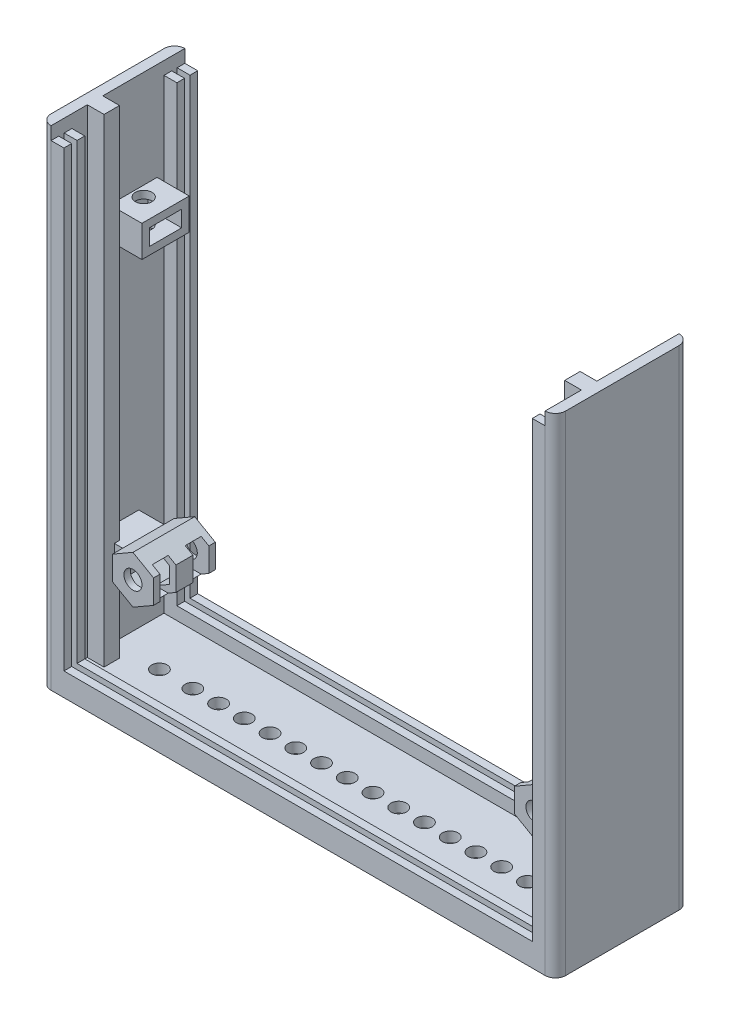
ISO-10303-21;
HEADER;
FILE_DESCRIPTION(('STEP AP214'),'2;1');
FILE_NAME('part.step','',(''),(''),'','','');
FILE_SCHEMA(('AUTOMOTIVE_DESIGN { 1 0 10303 214 1 1 1 1 }'));
ENDSEC;
DATA;
#1=APPLICATION_CONTEXT('core data for automotive mechanical design processes');
#2=APPLICATION_PROTOCOL_DEFINITION('international standard','automotive_design',2000,#1);
#3=PRODUCT_CONTEXT('',#1,'mechanical');
#4=PRODUCT('Part','Part','',(#3));
#5=PRODUCT_RELATED_PRODUCT_CATEGORY('part','',(#4));
#6=PRODUCT_DEFINITION_FORMATION('','',#4);
#7=PRODUCT_DEFINITION_CONTEXT('part definition',#1,'design');
#8=PRODUCT_DEFINITION('design','',#6,#7);
#9=PRODUCT_DEFINITION_SHAPE('','',#8);
#10=(LENGTH_UNIT() NAMED_UNIT(*) SI_UNIT(.MILLI.,.METRE.));
#11=(NAMED_UNIT(*) PLANE_ANGLE_UNIT() SI_UNIT($,.RADIAN.));
#12=(NAMED_UNIT(*) SI_UNIT($,.STERADIAN.) SOLID_ANGLE_UNIT());
#13=UNCERTAINTY_MEASURE_WITH_UNIT(LENGTH_MEASURE(1.E-05),#10,'distance_accuracy_value','');
#14=(GEOMETRIC_REPRESENTATION_CONTEXT(3) GLOBAL_UNCERTAINTY_ASSIGNED_CONTEXT((#13)) GLOBAL_UNIT_ASSIGNED_CONTEXT((#10,
#11,#12)) REPRESENTATION_CONTEXT('',''));
#15=CARTESIAN_POINT('',(0.,0.,0.));
#16=DIRECTION('',(0.,0.,1.));
#17=DIRECTION('',(1.,0.,0.));
#18=AXIS2_PLACEMENT_3D('',#15,#16,#17);
#19=CARTESIAN_POINT('',(0.,0.,26.));
#20=DIRECTION('',(0.,0.,1.));
#21=DIRECTION('',(1.,0.,0.));
#22=AXIS2_PLACEMENT_3D('',#19,#20,#21);
#23=PLANE('',#22);
#24=DIRECTION('',(0.,-1.,0.));
#25=VECTOR('',#24,1.);
#26=CARTESIAN_POINT('',(48.,0.,26.));
#27=LINE('',#26,#25);
#28=CARTESIAN_POINT('',(48.,2.,26.));
#29=VERTEX_POINT('',#28);
#30=CARTESIAN_POINT('',(48.,94.5,26.));
#31=VERTEX_POINT('',#30);
#32=EDGE_CURVE('E874',#29,#31,#27,.F.);
#33=ORIENTED_EDGE('',*,*,#32,.T.);
#34=DIRECTION('',(1.,0.,0.));
#35=VECTOR('',#34,1.);
#36=CARTESIAN_POINT('',(45.5,94.5,26.));
#37=LINE('',#36,#35);
#38=CARTESIAN_POINT('',(45.5,94.5,26.));
#39=VERTEX_POINT('',#38);
#40=EDGE_CURVE('E1910',#39,#31,#37,.T.);
#41=ORIENTED_EDGE('',*,*,#40,.F.);
#42=DIRECTION('',(0.,1.,0.));
#43=VECTOR('',#42,1.);
#44=CARTESIAN_POINT('',(45.5,0.,26.));
#45=LINE('',#44,#43);
#46=CARTESIAN_POINT('',(45.5,6.49999999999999,26.));
#47=VERTEX_POINT('',#46);
#48=EDGE_CURVE('E1702',#47,#39,#45,.T.);
#49=ORIENTED_EDGE('',*,*,#48,.F.);
#50=DIRECTION('',(-1.,0.,0.));
#51=VECTOR('',#50,1.);
#52=CARTESIAN_POINT('',(55.6584920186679,6.49999999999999,26.));
#53=LINE('',#52,#51);
#54=CARTESIAN_POINT('',(-45.5,6.49999999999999,26.));
#55=VERTEX_POINT('',#54);
#56=EDGE_CURVE('E1644',#47,#55,#53,.T.);
#57=ORIENTED_EDGE('',*,*,#56,.T.);
#58=DIRECTION('',(0.,1.,0.));
#59=VECTOR('',#58,1.);
#60=CARTESIAN_POINT('',(-45.5,0.,26.));
#61=LINE('',#60,#59);
#62=CARTESIAN_POINT('',(-45.5,94.5,26.));
#63=VERTEX_POINT('',#62);
#64=EDGE_CURVE('E1727',#55,#63,#61,.T.);
#65=ORIENTED_EDGE('',*,*,#64,.T.);
#66=DIRECTION('',(1.,0.,0.));
#67=VECTOR('',#66,1.);
#68=CARTESIAN_POINT('',(-45.5,94.5,26.));
#69=LINE('',#68,#67);
#70=CARTESIAN_POINT('',(-48.,94.5,26.));
#71=VERTEX_POINT('',#70);
#72=EDGE_CURVE('E1866',#71,#63,#69,.T.);
#73=ORIENTED_EDGE('',*,*,#72,.F.);
#74=DIRECTION('',(0.,1.,0.));
#75=VECTOR('',#74,1.);
#76=CARTESIAN_POINT('',(-48.,0.,26.));
#77=LINE('',#76,#75);
#78=CARTESIAN_POINT('',(-48.,2.,26.));
#79=VERTEX_POINT('',#78);
#80=EDGE_CURVE('E877',#71,#79,#77,.F.);
#81=ORIENTED_EDGE('',*,*,#80,.T.);
#82=DIRECTION('',(-1.,0.,0.));
#83=VECTOR('',#82,1.);
#84=CARTESIAN_POINT('',(50.,2.,26.));
#85=LINE('',#84,#83);
#86=EDGE_CURVE('E1553',#29,#79,#85,.T.);
#87=ORIENTED_EDGE('',*,*,#86,.F.);
#88=EDGE_LOOP('',(#33,#41,#49,#57,#65,#73,#81,#87));
#89=FACE_BOUND('',#88,.T.);
#90=ADVANCED_FACE('F37',(#89),#23,.T.);
#91=CARTESIAN_POINT('',(0.,0.,0.));
#92=DIRECTION('',(0.,0.,1.));
#93=DIRECTION('',(1.,0.,0.));
#94=AXIS2_PLACEMENT_3D('',#91,#92,#93);
#95=PLANE('',#94);
#96=DIRECTION('',(0.,-1.,0.));
#97=VECTOR('',#96,1.);
#98=CARTESIAN_POINT('',(-48.,97.,0.));
#99=LINE('',#98,#97);
#100=CARTESIAN_POINT('',(-48.,2.,0.));
#101=VERTEX_POINT('',#100);
#102=CARTESIAN_POINT('',(-48.,94.5,0.));
#103=VERTEX_POINT('',#102);
#104=EDGE_CURVE('E866',#101,#103,#99,.F.);
#105=ORIENTED_EDGE('',*,*,#104,.T.);
#106=DIRECTION('',(-1.,0.,0.));
#107=VECTOR('',#106,1.);
#108=CARTESIAN_POINT('',(-48.,94.5,0.));
#109=LINE('',#108,#107);
#110=CARTESIAN_POINT('',(-45.5,94.5,0.));
#111=VERTEX_POINT('',#110);
#112=EDGE_CURVE('E812',#111,#103,#109,.T.);
#113=ORIENTED_EDGE('',*,*,#112,.F.);
#114=DIRECTION('',(0.,1.,0.));
#115=VECTOR('',#114,1.);
#116=CARTESIAN_POINT('',(-45.5,0.,0.));
#117=LINE('',#116,#115);
#118=CARTESIAN_POINT('',(-45.5,6.49999999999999,0.));
#119=VERTEX_POINT('',#118);
#120=EDGE_CURVE('E1716',#119,#111,#117,.T.);
#121=ORIENTED_EDGE('',*,*,#120,.F.);
#122=DIRECTION('',(-1.,0.,0.));
#123=VECTOR('',#122,1.);
#124=CARTESIAN_POINT('',(55.6584920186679,6.49999999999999,0.));
#125=LINE('',#124,#123);
#126=CARTESIAN_POINT('',(45.5,6.49999999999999,0.));
#127=VERTEX_POINT('',#126);
#128=EDGE_CURVE('E1619',#127,#119,#125,.T.);
#129=ORIENTED_EDGE('',*,*,#128,.F.);
#130=DIRECTION('',(0.,1.,0.));
#131=VECTOR('',#130,1.);
#132=CARTESIAN_POINT('',(45.5,0.,0.));
#133=LINE('',#132,#131);
#134=CARTESIAN_POINT('',(45.5,94.5,0.));
#135=VERTEX_POINT('',#134);
#136=EDGE_CURVE('E1675',#127,#135,#133,.T.);
#137=ORIENTED_EDGE('',*,*,#136,.T.);
#138=DIRECTION('',(-1.,0.,0.));
#139=VECTOR('',#138,1.);
#140=CARTESIAN_POINT('',(48.,94.5,0.));
#141=LINE('',#140,#139);
#142=CARTESIAN_POINT('',(48.,94.5,0.));
#143=VERTEX_POINT('',#142);
#144=EDGE_CURVE('E1894',#143,#135,#141,.T.);
#145=ORIENTED_EDGE('',*,*,#144,.F.);
#146=DIRECTION('',(0.,1.,0.));
#147=VECTOR('',#146,1.);
#148=CARTESIAN_POINT('',(48.,2.,0.));
#149=LINE('',#148,#147);
#150=CARTESIAN_POINT('',(48.,2.,0.));
#151=VERTEX_POINT('',#150);
#152=EDGE_CURVE('E862',#143,#151,#149,.F.);
#153=ORIENTED_EDGE('',*,*,#152,.T.);
#154=DIRECTION('',(1.,0.,0.));
#155=VECTOR('',#154,1.);
#156=CARTESIAN_POINT('',(-50.,2.,0.));
#157=LINE('',#156,#155);
#158=EDGE_CURVE('E1547',#101,#151,#157,.T.);
#159=ORIENTED_EDGE('',*,*,#158,.F.);
#160=EDGE_LOOP('',(#105,#113,#121,#129,#137,#145,#153,#159));
#161=FACE_BOUND('',#160,.T.);
#162=ADVANCED_FACE('F1890',(#161),#95,.F.);
#163=CARTESIAN_POINT('',(0.,-49.2611916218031,24.5));
#164=DIRECTION('',(0.,0.,1.));
#165=DIRECTION('',(1.,0.,0.));
#166=AXIS2_PLACEMENT_3D('',#163,#164,#165);
#167=PLANE('',#166);
#168=DIRECTION('',(-1.,0.,0.));
#169=VECTOR('',#168,1.);
#170=CARTESIAN_POINT('',(0.,94.5,24.5));
#171=LINE('',#170,#169);
#172=CARTESIAN_POINT('',(48.,94.5,24.5));
#173=VERTEX_POINT('',#172);
#174=CARTESIAN_POINT('',(45.5,94.5,24.5));
#175=VERTEX_POINT('',#174);
#176=EDGE_CURVE('E1959',#173,#175,#171,.T.);
#177=ORIENTED_EDGE('',*,*,#176,.F.);
#178=DIRECTION('',(0.,1.,0.));
#179=VECTOR('',#178,1.);
#180=CARTESIAN_POINT('',(48.,0.,24.5));
#181=LINE('',#180,#179);
#182=CARTESIAN_POINT('',(48.,3.99999999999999,24.5));
#183=VERTEX_POINT('',#182);
#184=EDGE_CURVE('E1689',#183,#173,#181,.T.);
#185=ORIENTED_EDGE('',*,*,#184,.F.);
#186=DIRECTION('',(-1.,0.,0.));
#187=VECTOR('',#186,1.);
#188=CARTESIAN_POINT('',(55.6584920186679,3.99999999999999,24.5));
#189=LINE('',#188,#187);
#190=CARTESIAN_POINT('',(-48.,3.99999999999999,24.5));
#191=VERTEX_POINT('',#190);
#192=EDGE_CURVE('E1643',#183,#191,#189,.T.);
#193=ORIENTED_EDGE('',*,*,#192,.T.);
#194=DIRECTION('',(0.,1.,0.));
#195=VECTOR('',#194,1.);
#196=CARTESIAN_POINT('',(-48.,0.,24.5));
#197=LINE('',#196,#195);
#198=CARTESIAN_POINT('',(-48.,94.5,24.5));
#199=VERTEX_POINT('',#198);
#200=EDGE_CURVE('E1722',#191,#199,#197,.T.);
#201=ORIENTED_EDGE('',*,*,#200,.T.);
#202=DIRECTION('',(1.,0.,0.));
#203=VECTOR('',#202,1.);
#204=CARTESIAN_POINT('',(0.,94.5,24.5));
#205=LINE('',#204,#203);
#206=CARTESIAN_POINT('',(-45.5,94.5,24.5));
#207=VERTEX_POINT('',#206);
#208=EDGE_CURVE('E1930',#199,#207,#205,.T.);
#209=ORIENTED_EDGE('',*,*,#208,.T.);
#210=DIRECTION('',(0.,1.,0.));
#211=VECTOR('',#210,1.);
#212=CARTESIAN_POINT('',(-45.5,0.,24.5));
#213=LINE('',#212,#211);
#214=CARTESIAN_POINT('',(-45.5,6.49999999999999,24.5));
#215=VERTEX_POINT('',#214);
#216=EDGE_CURVE('E1723',#215,#207,#213,.T.);
#217=ORIENTED_EDGE('',*,*,#216,.F.);
#218=DIRECTION('',(-1.,0.,0.));
#219=VECTOR('',#218,1.);
#220=CARTESIAN_POINT('',(55.6584920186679,6.49999999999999,24.5));
#221=LINE('',#220,#219);
#222=CARTESIAN_POINT('',(45.5,6.49999999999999,24.5));
#223=VERTEX_POINT('',#222);
#224=EDGE_CURVE('E1638',#223,#215,#221,.T.);
#225=ORIENTED_EDGE('',*,*,#224,.F.);
#226=DIRECTION('',(0.,1.,0.));
#227=VECTOR('',#226,1.);
#228=CARTESIAN_POINT('',(45.5,0.,24.5));
#229=LINE('',#228,#227);
#230=EDGE_CURVE('E1674',#223,#175,#229,.T.);
#231=ORIENTED_EDGE('',*,*,#230,.T.);
#232=EDGE_LOOP('',(#177,#185,#193,#201,#209,#217,#225,#231));
#233=FACE_BOUND('',#232,.T.);
#234=ADVANCED_FACE('F1928',(#233),#167,.F.);
#235=CARTESIAN_POINT('',(-49.25,-49.2611916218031,23.45));
#236=DIRECTION('',(0.,0.,-1.));
#237=DIRECTION('',(-1.,0.,0.));
#238=AXIS2_PLACEMENT_3D('',#235,#236,#237);
#239=PLANE('',#238);
#240=DIRECTION('',(1.,0.,0.));
#241=VECTOR('',#240,1.);
#242=CARTESIAN_POINT('',(-49.25,94.5,23.45));
#243=LINE('',#242,#241);
#244=CARTESIAN_POINT('',(45.5,94.5,23.45));
#245=VERTEX_POINT('',#244);
#246=CARTESIAN_POINT('',(48.,94.5,23.45));
#247=VERTEX_POINT('',#246);
#248=EDGE_CURVE('E1957',#245,#247,#243,.T.);
#249=ORIENTED_EDGE('',*,*,#248,.F.);
#250=DIRECTION('',(0.,1.,0.));
#251=VECTOR('',#250,1.);
#252=CARTESIAN_POINT('',(45.5,0.,23.45));
#253=LINE('',#252,#251);
#254=CARTESIAN_POINT('',(45.5,6.49999999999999,23.45));
#255=VERTEX_POINT('',#254);
#256=EDGE_CURVE('E1696',#255,#245,#253,.T.);
#257=ORIENTED_EDGE('',*,*,#256,.F.);
#258=DIRECTION('',(-1.,0.,0.));
#259=VECTOR('',#258,1.);
#260=CARTESIAN_POINT('',(55.6584920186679,6.49999999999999,23.45));
#261=LINE('',#260,#259);
#262=CARTESIAN_POINT('',(-45.5,6.49999999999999,23.45));
#263=VERTEX_POINT('',#262);
#264=EDGE_CURVE('E1650',#255,#263,#261,.T.);
#265=ORIENTED_EDGE('',*,*,#264,.T.);
#266=DIRECTION('',(0.,1.,0.));
#267=VECTOR('',#266,1.);
#268=CARTESIAN_POINT('',(-45.5,0.,23.45));
#269=LINE('',#268,#267);
#270=CARTESIAN_POINT('',(-45.5,94.5,23.45));
#271=VERTEX_POINT('',#270);
#272=EDGE_CURVE('E1733',#263,#271,#269,.T.);
#273=ORIENTED_EDGE('',*,*,#272,.T.);
#274=DIRECTION('',(-1.,0.,0.));
#275=VECTOR('',#274,1.);
#276=CARTESIAN_POINT('',(-49.25,94.5,23.45));
#277=LINE('',#276,#275);
#278=CARTESIAN_POINT('',(-48.,94.5,23.45));
#279=VERTEX_POINT('',#278);
#280=EDGE_CURVE('E1967',#271,#279,#277,.T.);
#281=ORIENTED_EDGE('',*,*,#280,.T.);
#282=DIRECTION('',(0.,1.,0.));
#283=VECTOR('',#282,1.);
#284=CARTESIAN_POINT('',(-48.,0.,23.45));
#285=LINE('',#284,#283);
#286=CARTESIAN_POINT('',(-48.,3.99999999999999,23.45));
#287=VERTEX_POINT('',#286);
#288=EDGE_CURVE('E1736',#287,#279,#285,.T.);
#289=ORIENTED_EDGE('',*,*,#288,.F.);
#290=DIRECTION('',(-1.,0.,0.));
#291=VECTOR('',#290,1.);
#292=CARTESIAN_POINT('',(55.6584920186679,3.99999999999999,23.45));
#293=LINE('',#292,#291);
#294=CARTESIAN_POINT('',(48.,3.99999999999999,23.45));
#295=VERTEX_POINT('',#294);
#296=EDGE_CURVE('E1653',#295,#287,#293,.T.);
#297=ORIENTED_EDGE('',*,*,#296,.F.);
#298=DIRECTION('',(0.,1.,0.));
#299=VECTOR('',#298,1.);
#300=CARTESIAN_POINT('',(48.,0.,23.45));
#301=LINE('',#300,#299);
#302=EDGE_CURVE('E1693',#295,#247,#301,.T.);
#303=ORIENTED_EDGE('',*,*,#302,.T.);
#304=EDGE_LOOP('',(#249,#257,#265,#273,#281,#289,#297,#303));
#305=FACE_BOUND('',#304,.T.);
#306=ADVANCED_FACE('F2123',(#305),#239,.F.);
#307=CARTESIAN_POINT('',(45.5,0.,24.5));
#308=DIRECTION('',(1.,0.,0.));
#309=DIRECTION('',(0.,0.,-1.));
#310=AXIS2_PLACEMENT_3D('',#307,#308,#309);
#311=PLANE('',#310);
#312=DIRECTION('',(0.,0.,1.));
#313=VECTOR('',#312,1.);
#314=CARTESIAN_POINT('',(45.5,94.5,21.95));
#315=LINE('',#314,#313);
#316=EDGE_CURVE('E1920',#175,#39,#315,.T.);
#317=ORIENTED_EDGE('',*,*,#316,.F.);
#318=ORIENTED_EDGE('',*,*,#230,.F.);
#319=DIRECTION('',(0.,0.,-1.));
#320=VECTOR('',#319,1.);
#321=CARTESIAN_POINT('',(45.5,6.49999999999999,24.5));
#322=LINE('',#321,#320);
#323=EDGE_CURVE('E842',#47,#223,#322,.T.);
#324=ORIENTED_EDGE('',*,*,#323,.F.);
#325=ORIENTED_EDGE('',*,*,#48,.T.);
#326=EDGE_LOOP('',(#317,#318,#324,#325));
#327=FACE_BOUND('',#326,.T.);
#328=ADVANCED_FACE('F1919',(#327),#311,.F.);
#329=CARTESIAN_POINT('',(45.5,0.,21.95));
#330=DIRECTION('',(1.,0.,0.));
#331=DIRECTION('',(0.,0.,-1.));
#332=AXIS2_PLACEMENT_3D('',#329,#330,#331);
#333=PLANE('',#332);
#334=CARTESIAN_POINT('',(45.5,94.5,21.95));
#335=VERTEX_POINT('',#334);
#336=EDGE_CURVE('E1915',#335,#245,#315,.T.);
#337=ORIENTED_EDGE('',*,*,#336,.F.);
#338=DIRECTION('',(0.,1.,0.));
#339=VECTOR('',#338,1.);
#340=CARTESIAN_POINT('',(45.5,0.,21.95));
#341=LINE('',#340,#339);
#342=CARTESIAN_POINT('',(45.5,6.49999999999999,21.95));
#343=VERTEX_POINT('',#342);
#344=EDGE_CURVE('E1699',#343,#335,#341,.T.);
#345=ORIENTED_EDGE('',*,*,#344,.F.);
#346=DIRECTION('',(0.,0.,-1.));
#347=VECTOR('',#346,1.);
#348=CARTESIAN_POINT('',(45.5,6.49999999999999,21.95));
#349=LINE('',#348,#347);
#350=EDGE_CURVE('E1642',#255,#343,#349,.T.);
#351=ORIENTED_EDGE('',*,*,#350,.F.);
#352=ORIENTED_EDGE('',*,*,#256,.T.);
#353=EDGE_LOOP('',(#337,#345,#351,#352));
#354=FACE_BOUND('',#353,.T.);
#355=ADVANCED_FACE('F2116',(#354),#333,.F.);
#356=CARTESIAN_POINT('',(-49.25,-49.2611916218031,2.54999999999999));
#357=DIRECTION('',(0.,0.,-1.));
#358=DIRECTION('',(-1.,0.,0.));
#359=AXIS2_PLACEMENT_3D('',#356,#357,#358);
#360=PLANE('',#359);
#361=DIRECTION('',(-1.,0.,0.));
#362=VECTOR('',#361,1.);
#363=CARTESIAN_POINT('',(-49.25,94.5,2.54999999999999));
#364=LINE('',#363,#362);
#365=CARTESIAN_POINT('',(-45.5,94.5,2.54999999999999));
#366=VERTEX_POINT('',#365);
#367=CARTESIAN_POINT('',(-48.,94.5,2.54999999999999));
#368=VERTEX_POINT('',#367);
#369=EDGE_CURVE('E806',#366,#368,#364,.T.);
#370=ORIENTED_EDGE('',*,*,#369,.F.);
#371=DIRECTION('',(0.,1.,0.));
#372=VECTOR('',#371,1.);
#373=CARTESIAN_POINT('',(-45.5,0.,2.54999999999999));
#374=LINE('',#373,#372);
#375=CARTESIAN_POINT('',(-45.5,6.49999999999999,2.54999999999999));
#376=VERTEX_POINT('',#375);
#377=EDGE_CURVE('E1712',#376,#366,#374,.T.);
#378=ORIENTED_EDGE('',*,*,#377,.F.);
#379=DIRECTION('',(-1.,0.,0.));
#380=VECTOR('',#379,1.);
#381=CARTESIAN_POINT('',(55.6584920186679,6.49999999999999,2.54999999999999));
#382=LINE('',#381,#380);
#383=CARTESIAN_POINT('',(45.5,6.49999999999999,2.54999999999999));
#384=VERTEX_POINT('',#383);
#385=EDGE_CURVE('E1622',#384,#376,#382,.T.);
#386=ORIENTED_EDGE('',*,*,#385,.F.);
#387=DIRECTION('',(0.,1.,0.));
#388=VECTOR('',#387,1.);
#389=CARTESIAN_POINT('',(45.5,0.,2.54999999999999));
#390=LINE('',#389,#388);
#391=CARTESIAN_POINT('',(45.5,94.5,2.54999999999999));
#392=VERTEX_POINT('',#391);
#393=EDGE_CURVE('E1681',#384,#392,#390,.T.);
#394=ORIENTED_EDGE('',*,*,#393,.T.);
#395=DIRECTION('',(1.,0.,0.));
#396=VECTOR('',#395,1.);
#397=CARTESIAN_POINT('',(-49.25,94.5,2.54999999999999));
#398=LINE('',#397,#396);
#399=CARTESIAN_POINT('',(48.,94.5,2.54999999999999));
#400=VERTEX_POINT('',#399);
#401=EDGE_CURVE('E1964',#392,#400,#398,.T.);
#402=ORIENTED_EDGE('',*,*,#401,.T.);
#403=DIRECTION('',(0.,1.,0.));
#404=VECTOR('',#403,1.);
#405=CARTESIAN_POINT('',(48.,0.,2.54999999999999));
#406=LINE('',#405,#404);
#407=CARTESIAN_POINT('',(48.,3.99999999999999,2.54999999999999));
#408=VERTEX_POINT('',#407);
#409=EDGE_CURVE('E1684',#408,#400,#406,.T.);
#410=ORIENTED_EDGE('',*,*,#409,.F.);
#411=DIRECTION('',(-1.,0.,0.));
#412=VECTOR('',#411,1.);
#413=CARTESIAN_POINT('',(55.6584920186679,3.99999999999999,2.54999999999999));
#414=LINE('',#413,#412);
#415=CARTESIAN_POINT('',(-48.,3.99999999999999,2.54999999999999));
#416=VERTEX_POINT('',#415);
#417=EDGE_CURVE('E1615',#408,#416,#414,.T.);
#418=ORIENTED_EDGE('',*,*,#417,.T.);
#419=DIRECTION('',(0.,1.,0.));
#420=VECTOR('',#419,1.);
#421=CARTESIAN_POINT('',(-48.,0.,2.54999999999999));
#422=LINE('',#421,#420);
#423=EDGE_CURVE('E1710',#416,#368,#422,.T.);
#424=ORIENTED_EDGE('',*,*,#423,.T.);
#425=EDGE_LOOP('',(#370,#378,#386,#394,#402,#410,#418,#424));
#426=FACE_BOUND('',#425,.T.);
#427=ADVANCED_FACE('F2119',(#426),#360,.T.);
#428=CARTESIAN_POINT('',(0.,-49.2611916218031,1.5));
#429=DIRECTION('',(0.,0.,1.));
#430=DIRECTION('',(1.,0.,0.));
#431=AXIS2_PLACEMENT_3D('',#428,#429,#430);
#432=PLANE('',#431);
#433=DIRECTION('',(1.,0.,0.));
#434=VECTOR('',#433,1.);
#435=CARTESIAN_POINT('',(0.,94.5,1.5));
#436=LINE('',#435,#434);
#437=CARTESIAN_POINT('',(-48.,94.5,1.49999999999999));
#438=VERTEX_POINT('',#437);
#439=CARTESIAN_POINT('',(-45.5,94.5,1.49999999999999));
#440=VERTEX_POINT('',#439);
#441=EDGE_CURVE('E1971',#438,#440,#436,.T.);
#442=ORIENTED_EDGE('',*,*,#441,.F.);
#443=DIRECTION('',(0.,1.,0.));
#444=VECTOR('',#443,1.);
#445=CARTESIAN_POINT('',(-48.,0.,1.49999999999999));
#446=LINE('',#445,#444);
#447=CARTESIAN_POINT('',(-48.,3.99999999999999,1.49999999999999));
#448=VERTEX_POINT('',#447);
#449=EDGE_CURVE('E1707',#448,#438,#446,.T.);
#450=ORIENTED_EDGE('',*,*,#449,.F.);
#451=DIRECTION('',(-1.,0.,0.));
#452=VECTOR('',#451,1.);
#453=CARTESIAN_POINT('',(55.6584920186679,3.99999999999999,1.49999999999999));
#454=LINE('',#453,#452);
#455=CARTESIAN_POINT('',(48.,3.99999999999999,1.49999999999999));
#456=VERTEX_POINT('',#455);
#457=EDGE_CURVE('E1614',#456,#448,#454,.T.);
#458=ORIENTED_EDGE('',*,*,#457,.F.);
#459=DIRECTION('',(0.,1.,0.));
#460=VECTOR('',#459,1.);
#461=CARTESIAN_POINT('',(48.,0.,1.49999999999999));
#462=LINE('',#461,#460);
#463=CARTESIAN_POINT('',(48.,94.5,1.49999999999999));
#464=VERTEX_POINT('',#463);
#465=EDGE_CURVE('E1670',#456,#464,#462,.T.);
#466=ORIENTED_EDGE('',*,*,#465,.T.);
#467=DIRECTION('',(-1.,0.,0.));
#468=VECTOR('',#467,1.);
#469=CARTESIAN_POINT('',(0.,94.5,1.5));
#470=LINE('',#469,#468);
#471=CARTESIAN_POINT('',(45.5,94.5,1.49999999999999));
#472=VERTEX_POINT('',#471);
#473=EDGE_CURVE('E1961',#464,#472,#470,.T.);
#474=ORIENTED_EDGE('',*,*,#473,.T.);
#475=DIRECTION('',(0.,1.,0.));
#476=VECTOR('',#475,1.);
#477=CARTESIAN_POINT('',(45.5,0.,1.49999999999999));
#478=LINE('',#477,#476);
#479=CARTESIAN_POINT('',(45.5,6.49999999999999,1.49999999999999));
#480=VERTEX_POINT('',#479);
#481=EDGE_CURVE('E1671',#480,#472,#478,.T.);
#482=ORIENTED_EDGE('',*,*,#481,.F.);
#483=DIRECTION('',(-1.,0.,0.));
#484=VECTOR('',#483,1.);
#485=CARTESIAN_POINT('',(55.6584920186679,6.49999999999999,1.49999999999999));
#486=LINE('',#485,#484);
#487=CARTESIAN_POINT('',(-45.5,6.49999999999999,1.49999999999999));
#488=VERTEX_POINT('',#487);
#489=EDGE_CURVE('E1616',#480,#488,#486,.T.);
#490=ORIENTED_EDGE('',*,*,#489,.T.);
#491=DIRECTION('',(0.,1.,0.));
#492=VECTOR('',#491,1.);
#493=CARTESIAN_POINT('',(-45.5,0.,1.49999999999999));
#494=LINE('',#493,#492);
#495=EDGE_CURVE('E1692',#488,#440,#494,.T.);
#496=ORIENTED_EDGE('',*,*,#495,.T.);
#497=EDGE_LOOP('',(#442,#450,#458,#466,#474,#482,#490,#496));
#498=FACE_BOUND('',#497,.T.);
#499=ADVANCED_FACE('F2143',(#498),#432,.T.);
#500=CARTESIAN_POINT('',(-49.25,0.,21.95));
#501=DIRECTION('',(0.,0.,-1.));
#502=DIRECTION('',(-1.,0.,0.));
#503=AXIS2_PLACEMENT_3D('',#500,#501,#502);
#504=PLANE('',#503);
#505=ORIENTED_EDGE('',*,*,#344,.T.);
#506=DIRECTION('',(-1.,0.,0.));
#507=VECTOR('',#506,1.);
#508=CARTESIAN_POINT('',(48.,94.5,21.95));
#509=LINE('',#508,#507);
#510=CARTESIAN_POINT('',(48.,94.5,21.95));
#511=VERTEX_POINT('',#510);
#512=EDGE_CURVE('E1940',#511,#335,#509,.T.);
#513=ORIENTED_EDGE('',*,*,#512,.F.);
#514=DIRECTION('',(0.,-1.,0.));
#515=VECTOR('',#514,1.);
#516=CARTESIAN_POINT('',(48.,3.99999999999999,21.95));
#517=LINE('',#516,#515);
#518=CARTESIAN_POINT('',(48.,3.99999999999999,21.95));
#519=VERTEX_POINT('',#518);
#520=EDGE_CURVE('E831',#511,#519,#517,.T.);
#521=ORIENTED_EDGE('',*,*,#520,.T.);
#522=DIRECTION('',(1.,0.,0.));
#523=VECTOR('',#522,1.);
#524=CARTESIAN_POINT('',(0.,4.,21.95));
#525=LINE('',#524,#523);
#526=CARTESIAN_POINT('',(-48.,3.99999999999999,21.95));
#527=VERTEX_POINT('',#526);
#528=EDGE_CURVE('E832',#527,#519,#525,.T.);
#529=ORIENTED_EDGE('',*,*,#528,.F.);
#530=DIRECTION('',(0.,-1.,0.));
#531=VECTOR('',#530,1.);
#532=CARTESIAN_POINT('',(-48.,3.99999999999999,21.95));
#533=LINE('',#532,#531);
#534=CARTESIAN_POINT('',(-48.,94.5,21.95));
#535=VERTEX_POINT('',#534);
#536=EDGE_CURVE('E1726',#535,#527,#533,.T.);
#537=ORIENTED_EDGE('',*,*,#536,.F.);
#538=DIRECTION('',(-1.,0.,0.));
#539=VECTOR('',#538,1.);
#540=CARTESIAN_POINT('',(-48.,94.5,21.95));
#541=LINE('',#540,#539);
#542=CARTESIAN_POINT('',(-45.5,94.5,21.95));
#543=VERTEX_POINT('',#542);
#544=EDGE_CURVE('E1945',#543,#535,#541,.T.);
#545=ORIENTED_EDGE('',*,*,#544,.F.);
#546=DIRECTION('',(0.,1.,0.));
#547=VECTOR('',#546,1.);
#548=CARTESIAN_POINT('',(-45.5,0.,21.95));
#549=LINE('',#548,#547);
#550=CARTESIAN_POINT('',(-45.5,6.49999999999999,21.95));
#551=VERTEX_POINT('',#550);
#552=EDGE_CURVE('E1730',#551,#543,#549,.T.);
#553=ORIENTED_EDGE('',*,*,#552,.F.);
#554=DIRECTION('',(-1.,0.,0.));
#555=VECTOR('',#554,1.);
#556=CARTESIAN_POINT('',(55.6584920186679,6.49999999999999,21.95));
#557=LINE('',#556,#555);
#558=EDGE_CURVE('E1647',#343,#551,#557,.T.);
#559=ORIENTED_EDGE('',*,*,#558,.F.);
#560=EDGE_LOOP('',(#505,#513,#521,#529,#537,#545,#553,#559));
#561=FACE_BOUND('',#560,.T.);
#562=ADVANCED_FACE('F2134',(#561),#504,.T.);
#563=CARTESIAN_POINT('',(-49.25,0.,4.04999999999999));
#564=DIRECTION('',(0.,0.,-1.));
#565=DIRECTION('',(-1.,0.,0.));
#566=AXIS2_PLACEMENT_3D('',#563,#564,#565);
#567=PLANE('',#566);
#568=DIRECTION('',(0.,1.,0.));
#569=VECTOR('',#568,1.);
#570=CARTESIAN_POINT('',(-45.5,0.,4.04999999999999));
#571=LINE('',#570,#569);
#572=CARTESIAN_POINT('',(-45.5,6.49999999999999,4.04999999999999));
#573=VERTEX_POINT('',#572);
#574=CARTESIAN_POINT('',(-45.5,94.5,4.04999999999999));
#575=VERTEX_POINT('',#574);
#576=EDGE_CURVE('E821',#573,#575,#571,.T.);
#577=ORIENTED_EDGE('',*,*,#576,.T.);
#578=DIRECTION('',(1.,0.,0.));
#579=VECTOR('',#578,1.);
#580=CARTESIAN_POINT('',(-45.5,94.5,4.04999999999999));
#581=LINE('',#580,#579);
#582=CARTESIAN_POINT('',(-48.,94.5,4.04999999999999));
#583=VERTEX_POINT('',#582);
#584=EDGE_CURVE('E803',#583,#575,#581,.T.);
#585=ORIENTED_EDGE('',*,*,#584,.F.);
#586=DIRECTION('',(0.,-1.,0.));
#587=VECTOR('',#586,1.);
#588=CARTESIAN_POINT('',(-48.,3.99999999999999,4.04999999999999));
#589=LINE('',#588,#587);
#590=CARTESIAN_POINT('',(-48.,3.99999999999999,4.04999999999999));
#591=VERTEX_POINT('',#590);
#592=EDGE_CURVE('E818',#583,#591,#589,.T.);
#593=ORIENTED_EDGE('',*,*,#592,.T.);
#594=DIRECTION('',(1.,0.,0.));
#595=VECTOR('',#594,1.);
#596=CARTESIAN_POINT('',(0.,4.,4.04999999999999));
#597=LINE('',#596,#595);
#598=CARTESIAN_POINT('',(48.,3.99999999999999,4.05));
#599=VERTEX_POINT('',#598);
#600=EDGE_CURVE('E1709',#591,#599,#597,.T.);
#601=ORIENTED_EDGE('',*,*,#600,.T.);
#602=DIRECTION('',(0.,-1.,0.));
#603=VECTOR('',#602,1.);
#604=CARTESIAN_POINT('',(48.,3.99999999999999,4.04999999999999));
#605=LINE('',#604,#603);
#606=CARTESIAN_POINT('',(48.,94.5,4.05));
#607=VERTEX_POINT('',#606);
#608=EDGE_CURVE('E834',#607,#599,#605,.T.);
#609=ORIENTED_EDGE('',*,*,#608,.F.);
#610=DIRECTION('',(1.,0.,0.));
#611=VECTOR('',#610,1.);
#612=CARTESIAN_POINT('',(45.5,94.5,4.04999999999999));
#613=LINE('',#612,#611);
#614=CARTESIAN_POINT('',(45.5,94.5,4.04999999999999));
#615=VERTEX_POINT('',#614);
#616=EDGE_CURVE('E1946',#615,#607,#613,.T.);
#617=ORIENTED_EDGE('',*,*,#616,.F.);
#618=DIRECTION('',(0.,1.,0.));
#619=VECTOR('',#618,1.);
#620=CARTESIAN_POINT('',(45.5,0.,4.04999999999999));
#621=LINE('',#620,#619);
#622=CARTESIAN_POINT('',(45.5,6.49999999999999,4.04999999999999));
#623=VERTEX_POINT('',#622);
#624=EDGE_CURVE('E1678',#623,#615,#621,.T.);
#625=ORIENTED_EDGE('',*,*,#624,.F.);
#626=DIRECTION('',(-1.,0.,0.));
#627=VECTOR('',#626,1.);
#628=CARTESIAN_POINT('',(55.6584920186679,6.49999999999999,4.04999999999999));
#629=LINE('',#628,#627);
#630=EDGE_CURVE('E1610',#623,#573,#629,.T.);
#631=ORIENTED_EDGE('',*,*,#630,.T.);
#632=EDGE_LOOP('',(#577,#585,#593,#601,#609,#617,#625,#631));
#633=FACE_BOUND('',#632,.T.);
#634=ADVANCED_FACE('F816',(#633),#567,.F.);
#635=CARTESIAN_POINT('',(45.5,0.,4.04999999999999));
#636=DIRECTION('',(-1.,0.,0.));
#637=DIRECTION('',(0.,0.,1.));
#638=AXIS2_PLACEMENT_3D('',#635,#636,#637);
#639=PLANE('',#638);
#640=ORIENTED_EDGE('',*,*,#624,.T.);
#641=DIRECTION('',(0.,0.,1.));
#642=VECTOR('',#641,1.);
#643=CARTESIAN_POINT('',(45.5,94.5,0.));
#644=LINE('',#643,#642);
#645=EDGE_CURVE('E1954',#392,#615,#644,.T.);
#646=ORIENTED_EDGE('',*,*,#645,.F.);
#647=ORIENTED_EDGE('',*,*,#393,.F.);
#648=DIRECTION('',(0.,0.,-1.));
#649=VECTOR('',#648,1.);
#650=CARTESIAN_POINT('',(45.5,6.49999999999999,4.04999999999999));
#651=LINE('',#650,#649);
#652=EDGE_CURVE('E1628',#623,#384,#651,.T.);
#653=ORIENTED_EDGE('',*,*,#652,.F.);
#654=EDGE_LOOP('',(#640,#646,#647,#653));
#655=FACE_BOUND('',#654,.T.);
#656=ADVANCED_FACE('F2108',(#655),#639,.T.);
#657=CARTESIAN_POINT('',(45.5,0.,1.49999999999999));
#658=DIRECTION('',(-1.,0.,0.));
#659=DIRECTION('',(0.,0.,1.));
#660=AXIS2_PLACEMENT_3D('',#657,#658,#659);
#661=PLANE('',#660);
#662=ORIENTED_EDGE('',*,*,#481,.T.);
#663=EDGE_CURVE('E1955',#135,#472,#644,.T.);
#664=ORIENTED_EDGE('',*,*,#663,.F.);
#665=ORIENTED_EDGE('',*,*,#136,.F.);
#666=DIRECTION('',(0.,0.,-1.));
#667=VECTOR('',#666,1.);
#668=CARTESIAN_POINT('',(45.5,6.49999999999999,1.49999999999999));
#669=LINE('',#668,#667);
#670=EDGE_CURVE('E845',#480,#127,#669,.T.);
#671=ORIENTED_EDGE('',*,*,#670,.F.);
#672=EDGE_LOOP('',(#662,#664,#665,#671));
#673=FACE_BOUND('',#672,.T.);
#674=ADVANCED_FACE('F2104',(#673),#661,.T.);
#675=CARTESIAN_POINT('',(-46.,71.9,10.));
#676=DIRECTION('',(0.,1.,0.));
#677=DIRECTION('',(0.,0.,1.));
#678=AXIS2_PLACEMENT_3D('',#675,#676,#677);
#679=CYLINDRICAL_SURFACE('',#678,1.6);
#680=CARTESIAN_POINT('',(-46.,76.525,10.));
#681=DIRECTION('',(0.,1.,0.));
#682=DIRECTION('',(0.,0.,1.));
#683=AXIS2_PLACEMENT_3D('',#680,#681,#682);
#684=CIRCLE('',#683,1.6);
#685=CARTESIAN_POINT('',(-46.,76.525,11.6));
#686=VERTEX_POINT('',#685);
#687=EDGE_CURVE('E41',#686,#686,#684,.T.);
#688=ORIENTED_EDGE('',*,*,#687,.F.);
#689=EDGE_LOOP('',(#688));
#690=FACE_BOUND('',#689,.T.);
#691=CARTESIAN_POINT('',(-46.,78.,10.));
#692=DIRECTION('',(0.,-1.,0.));
#693=DIRECTION('',(0.,0.,1.));
#694=AXIS2_PLACEMENT_3D('',#691,#692,#693);
#695=CIRCLE('',#694,1.6);
#696=CARTESIAN_POINT('',(-46.,78.,11.6));
#697=VERTEX_POINT('',#696);
#698=EDGE_CURVE('E961',#697,#697,#695,.T.);
#699=ORIENTED_EDGE('',*,*,#698,.F.);
#700=EDGE_LOOP('',(#699));
#701=FACE_BOUND('',#700,.T.);
#702=ADVANCED_FACE('F2107',(#690,#701),#679,.F.);
#703=CARTESIAN_POINT('',(46.,71.9,10.));
#704=DIRECTION('',(0.,1.,0.));
#705=DIRECTION('',(0.,0.,1.));
#706=AXIS2_PLACEMENT_3D('',#703,#704,#705);
#707=CYLINDRICAL_SURFACE('',#706,1.6);
#708=CARTESIAN_POINT('',(46.,73.375,10.));
#709=DIRECTION('',(0.,-1.,0.));
#710=DIRECTION('',(0.,0.,-1.));
#711=AXIS2_PLACEMENT_3D('',#708,#709,#710);
#712=CIRCLE('',#711,1.6);
#713=CARTESIAN_POINT('',(46.,73.375,8.40000000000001));
#714=VERTEX_POINT('',#713);
#715=EDGE_CURVE('E951',#714,#714,#712,.F.);
#716=ORIENTED_EDGE('',*,*,#715,.T.);
#717=EDGE_LOOP('',(#716));
#718=FACE_BOUND('',#717,.T.);
#719=CARTESIAN_POINT('',(46.,71.9,10.));
#720=DIRECTION('',(0.,1.,0.));
#721=DIRECTION('',(0.,0.,1.));
#722=AXIS2_PLACEMENT_3D('',#719,#720,#721);
#723=CIRCLE('',#722,1.6);
#724=CARTESIAN_POINT('',(46.,71.9,11.6));
#725=VERTEX_POINT('',#724);
#726=EDGE_CURVE('E1034',#725,#725,#723,.T.);
#727=ORIENTED_EDGE('',*,*,#726,.F.);
#728=EDGE_LOOP('',(#727));
#729=FACE_BOUND('',#728,.T.);
#730=ADVANCED_FACE('F2046',(#718,#729),#707,.F.);
#731=CARTESIAN_POINT('',(0.,4.,26.));
#732=DIRECTION('',(0.,-1.,0.));
#733=DIRECTION('',(1.,0.,0.));
#734=AXIS2_PLACEMENT_3D('',#731,#732,#733);
#735=PLANE('',#734);
#736=CARTESIAN_POINT('',(7.50000000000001,4.,13.9500000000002));
#737=DIRECTION('',(0.,1.,0.));
#738=DIRECTION('',(-1.,0.,0.));
#739=AXIS2_PLACEMENT_3D('',#736,#737,#738);
#740=CIRCLE('',#739,1.5);
#741=CARTESIAN_POINT('',(6.00000000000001,4.,13.9500000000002));
#742=VERTEX_POINT('',#741);
#743=EDGE_CURVE('E1751',#742,#742,#740,.T.);
#744=ORIENTED_EDGE('',*,*,#743,.F.);
#745=EDGE_LOOP('',(#744));
#746=FACE_BOUND('',#745,.T.);
#747=CARTESIAN_POINT('',(12.5,4.,13.9500000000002));
#748=DIRECTION('',(0.,1.,0.));
#749=DIRECTION('',(-1.,0.,0.));
#750=AXIS2_PLACEMENT_3D('',#747,#748,#749);
#751=CIRCLE('',#750,1.5);
#752=CARTESIAN_POINT('',(11.,4.,13.9500000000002));
#753=VERTEX_POINT('',#752);
#754=EDGE_CURVE('E1779',#753,#753,#751,.T.);
#755=ORIENTED_EDGE('',*,*,#754,.F.);
#756=EDGE_LOOP('',(#755));
#757=FACE_BOUND('',#756,.T.);
#758=CARTESIAN_POINT('',(17.5,4.,13.9500000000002));
#759=DIRECTION('',(0.,1.,0.));
#760=DIRECTION('',(-1.,0.,0.));
#761=AXIS2_PLACEMENT_3D('',#758,#759,#760);
#762=CIRCLE('',#761,1.5);
#763=CARTESIAN_POINT('',(16.,4.,13.9500000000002));
#764=VERTEX_POINT('',#763);
#765=EDGE_CURVE('E1776',#764,#764,#762,.T.);
#766=ORIENTED_EDGE('',*,*,#765,.F.);
#767=EDGE_LOOP('',(#766));
#768=FACE_BOUND('',#767,.T.);
#769=CARTESIAN_POINT('',(22.5,4.,13.9500000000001));
#770=DIRECTION('',(0.,1.,0.));
#771=DIRECTION('',(-1.,0.,0.));
#772=AXIS2_PLACEMENT_3D('',#769,#770,#771);
#773=CIRCLE('',#772,1.5);
#774=CARTESIAN_POINT('',(21.,4.,13.9500000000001));
#775=VERTEX_POINT('',#774);
#776=EDGE_CURVE('E1772',#775,#775,#773,.T.);
#777=ORIENTED_EDGE('',*,*,#776,.F.);
#778=EDGE_LOOP('',(#777));
#779=FACE_BOUND('',#778,.T.);
#780=CARTESIAN_POINT('',(-39.,4.,13.95));
#781=DIRECTION('',(0.,1.,0.));
#782=DIRECTION('',(-1.,0.,0.));
#783=AXIS2_PLACEMENT_3D('',#780,#781,#782);
#784=CIRCLE('',#783,1.5);
#785=CARTESIAN_POINT('',(-40.5,4.,13.95));
#786=VERTEX_POINT('',#785);
#787=EDGE_CURVE('E1747',#786,#786,#784,.T.);
#788=ORIENTED_EDGE('',*,*,#787,.F.);
#789=EDGE_LOOP('',(#788));
#790=FACE_BOUND('',#789,.T.);
#791=CARTESIAN_POINT('',(37.5,4.,13.95));
#792=DIRECTION('',(0.,1.,0.));
#793=DIRECTION('',(-1.,0.,0.));
#794=AXIS2_PLACEMENT_3D('',#791,#792,#793);
#795=CIRCLE('',#794,1.5);
#796=CARTESIAN_POINT('',(36.,4.,13.95));
#797=VERTEX_POINT('',#796);
#798=EDGE_CURVE('E1787',#797,#797,#795,.T.);
#799=ORIENTED_EDGE('',*,*,#798,.F.);
#800=EDGE_LOOP('',(#799));
#801=FACE_BOUND('',#800,.T.);
#802=CARTESIAN_POINT('',(32.5,4.,13.9500000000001));
#803=DIRECTION('',(0.,1.,0.));
#804=DIRECTION('',(-1.,0.,0.));
#805=AXIS2_PLACEMENT_3D('',#802,#803,#804);
#806=CIRCLE('',#805,1.5);
#807=CARTESIAN_POINT('',(31.,4.,13.9500000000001));
#808=VERTEX_POINT('',#807);
#809=EDGE_CURVE('E1784',#808,#808,#806,.T.);
#810=ORIENTED_EDGE('',*,*,#809,.F.);
#811=EDGE_LOOP('',(#810));
#812=FACE_BOUND('',#811,.T.);
#813=CARTESIAN_POINT('',(27.5,4.,13.9500000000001));
#814=DIRECTION('',(0.,1.,0.));
#815=DIRECTION('',(-1.,0.,0.));
#816=AXIS2_PLACEMENT_3D('',#813,#814,#815);
#817=CIRCLE('',#816,1.5);
#818=CARTESIAN_POINT('',(26.,4.,13.9500000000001));
#819=VERTEX_POINT('',#818);
#820=EDGE_CURVE('E1775',#819,#819,#817,.T.);
#821=ORIENTED_EDGE('',*,*,#820,.F.);
#822=EDGE_LOOP('',(#821));
#823=FACE_BOUND('',#822,.T.);
#824=CARTESIAN_POINT('',(2.50000000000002,4.,13.9500000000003));
#825=DIRECTION('',(0.,1.,0.));
#826=DIRECTION('',(-1.,0.,0.));
#827=AXIS2_PLACEMENT_3D('',#824,#825,#826);
#828=CIRCLE('',#827,1.5);
#829=CARTESIAN_POINT('',(1.00000000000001,4.,13.9500000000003));
#830=VERTEX_POINT('',#829);
#831=EDGE_CURVE('E1748',#830,#830,#828,.T.);
#832=ORIENTED_EDGE('',*,*,#831,.F.);
#833=EDGE_LOOP('',(#832));
#834=FACE_BOUND('',#833,.T.);
#835=CARTESIAN_POINT('',(-2.49999999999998,4.,13.9500000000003));
#836=DIRECTION('',(0.,1.,0.));
#837=DIRECTION('',(-1.,0.,0.));
#838=AXIS2_PLACEMENT_3D('',#835,#836,#837);
#839=CIRCLE('',#838,1.5);
#840=CARTESIAN_POINT('',(-3.99999999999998,4.,13.9500000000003));
#841=VERTEX_POINT('',#840);
#842=EDGE_CURVE('E1752',#841,#841,#839,.T.);
#843=ORIENTED_EDGE('',*,*,#842,.F.);
#844=EDGE_LOOP('',(#843));
#845=FACE_BOUND('',#844,.T.);
#846=CARTESIAN_POINT('',(-7.49999999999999,4.,13.9500000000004));
#847=DIRECTION('',(0.,1.,0.));
#848=DIRECTION('',(-1.,0.,0.));
#849=AXIS2_PLACEMENT_3D('',#846,#847,#848);
#850=CIRCLE('',#849,1.5);
#851=CARTESIAN_POINT('',(-8.99999999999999,4.,13.9500000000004));
#852=VERTEX_POINT('',#851);
#853=EDGE_CURVE('E1755',#852,#852,#850,.T.);
#854=ORIENTED_EDGE('',*,*,#853,.F.);
#855=EDGE_LOOP('',(#854));
#856=FACE_BOUND('',#855,.T.);
#857=CARTESIAN_POINT('',(-12.5,4.,13.9500000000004));
#858=DIRECTION('',(0.,1.,0.));
#859=DIRECTION('',(-1.,0.,0.));
#860=AXIS2_PLACEMENT_3D('',#857,#858,#859);
#861=CIRCLE('',#860,1.5);
#862=CARTESIAN_POINT('',(-14.,4.,13.9500000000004));
#863=VERTEX_POINT('',#862);
#864=EDGE_CURVE('E1758',#863,#863,#861,.T.);
#865=ORIENTED_EDGE('',*,*,#864,.F.);
#866=EDGE_LOOP('',(#865));
#867=FACE_BOUND('',#866,.T.);
#868=CARTESIAN_POINT('',(-17.5,4.,13.9500000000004));
#869=DIRECTION('',(0.,1.,0.));
#870=DIRECTION('',(-1.,0.,0.));
#871=AXIS2_PLACEMENT_3D('',#868,#869,#870);
#872=CIRCLE('',#871,1.5);
#873=CARTESIAN_POINT('',(-19.,4.,13.9500000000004));
#874=VERTEX_POINT('',#873);
#875=EDGE_CURVE('E1761',#874,#874,#872,.T.);
#876=ORIENTED_EDGE('',*,*,#875,.F.);
#877=EDGE_LOOP('',(#876));
#878=FACE_BOUND('',#877,.T.);
#879=CARTESIAN_POINT('',(-22.5,4.,13.9500000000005));
#880=DIRECTION('',(0.,1.,0.));
#881=DIRECTION('',(-1.,0.,0.));
#882=AXIS2_PLACEMENT_3D('',#879,#880,#881);
#883=CIRCLE('',#882,1.5);
#884=CARTESIAN_POINT('',(-24.,4.,13.9500000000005));
#885=VERTEX_POINT('',#884);
#886=EDGE_CURVE('E1764',#885,#885,#883,.T.);
#887=ORIENTED_EDGE('',*,*,#886,.F.);
#888=EDGE_LOOP('',(#887));
#889=FACE_BOUND('',#888,.T.);
#890=CARTESIAN_POINT('',(-27.5,4.,13.9500000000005));
#891=DIRECTION('',(0.,1.,0.));
#892=DIRECTION('',(-1.,0.,0.));
#893=AXIS2_PLACEMENT_3D('',#890,#891,#892);
#894=CIRCLE('',#893,1.5);
#895=CARTESIAN_POINT('',(-29.,4.,13.9500000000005));
#896=VERTEX_POINT('',#895);
#897=EDGE_CURVE('E1767',#896,#896,#894,.T.);
#898=ORIENTED_EDGE('',*,*,#897,.F.);
#899=EDGE_LOOP('',(#898));
#900=FACE_BOUND('',#899,.T.);
#901=CARTESIAN_POINT('',(-32.5,4.,13.9500000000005));
#902=DIRECTION('',(0.,1.,0.));
#903=DIRECTION('',(-1.,0.,0.));
#904=AXIS2_PLACEMENT_3D('',#901,#902,#903);
#905=CIRCLE('',#904,1.5);
#906=CARTESIAN_POINT('',(-34.,4.,13.9500000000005));
#907=VERTEX_POINT('',#906);
#908=EDGE_CURVE('E1742',#907,#907,#905,.T.);
#909=ORIENTED_EDGE('',*,*,#908,.F.);
#910=EDGE_LOOP('',(#909));
#911=FACE_BOUND('',#910,.T.);
#912=CARTESIAN_POINT('',(42.5,4.,13.95));
#913=DIRECTION('',(0.,1.,0.));
#914=DIRECTION('',(-1.,0.,0.));
#915=AXIS2_PLACEMENT_3D('',#912,#913,#914);
#916=CIRCLE('',#915,1.5);
#917=CARTESIAN_POINT('',(41.,4.,13.95));
#918=VERTEX_POINT('',#917);
#919=EDGE_CURVE('E1743',#918,#918,#916,.T.);
#920=ORIENTED_EDGE('',*,*,#919,.F.);
#921=EDGE_LOOP('',(#920));
#922=FACE_BOUND('',#921,.T.);
#923=DIRECTION('',(0.,0.,1.));
#924=VECTOR('',#923,1.);
#925=CARTESIAN_POINT('',(44.75,3.99999999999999,15.95));
#926=LINE('',#925,#924);
#927=CARTESIAN_POINT('',(44.75,3.99999999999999,15.95));
#928=VERTEX_POINT('',#927);
#929=CARTESIAN_POINT('',(44.75,3.99999999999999,18.95));
#930=VERTEX_POINT('',#929);
#931=EDGE_CURVE('E1087',#928,#930,#926,.T.);
#932=ORIENTED_EDGE('',*,*,#931,.F.);
#933=DIRECTION('',(1.,0.,0.));
#934=VECTOR('',#933,1.);
#935=CARTESIAN_POINT('',(46.,3.99999999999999,15.95));
#936=LINE('',#935,#934);
#937=CARTESIAN_POINT('',(48.,3.99999999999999,15.95));
#938=VERTEX_POINT('',#937);
#939=EDGE_CURVE('E1800',#928,#938,#936,.T.);
#940=ORIENTED_EDGE('',*,*,#939,.T.);
#941=DIRECTION('',(0.,0.,-1.));
#942=VECTOR('',#941,1.);
#943=CARTESIAN_POINT('',(48.,3.99999999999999,26.));
#944=LINE('',#943,#942);
#945=EDGE_CURVE('E1813',#938,#599,#944,.T.);
#946=ORIENTED_EDGE('',*,*,#945,.T.);
#947=ORIENTED_EDGE('',*,*,#600,.F.);
#948=DIRECTION('',(0.,0.,-1.));
#949=VECTOR('',#948,1.);
#950=CARTESIAN_POINT('',(-48.,3.99999999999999,26.));
#951=LINE('',#950,#949);
#952=CARTESIAN_POINT('',(-48.,3.99999999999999,15.95));
#953=VERTEX_POINT('',#952);
#954=EDGE_CURVE('E830',#953,#591,#951,.T.);
#955=ORIENTED_EDGE('',*,*,#954,.F.);
#956=DIRECTION('',(-1.,0.,0.));
#957=VECTOR('',#956,1.);
#958=CARTESIAN_POINT('',(-46.,3.99999999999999,15.95));
#959=LINE('',#958,#957);
#960=CARTESIAN_POINT('',(-44.75,3.99999999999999,15.95));
#961=VERTEX_POINT('',#960);
#962=EDGE_CURVE('E1823',#961,#953,#959,.T.);
#963=ORIENTED_EDGE('',*,*,#962,.F.);
#964=DIRECTION('',(0.,0.,-1.));
#965=VECTOR('',#964,1.);
#966=CARTESIAN_POINT('',(-44.75,3.99999999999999,18.95));
#967=LINE('',#966,#965);
#968=CARTESIAN_POINT('',(-44.75,3.99999999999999,18.95));
#969=VERTEX_POINT('',#968);
#970=EDGE_CURVE('E1111',#969,#961,#967,.T.);
#971=ORIENTED_EDGE('',*,*,#970,.F.);
#972=DIRECTION('',(1.,0.,0.));
#973=VECTOR('',#972,1.);
#974=CARTESIAN_POINT('',(-48.,3.99999999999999,18.95));
#975=LINE('',#974,#973);
#976=CARTESIAN_POINT('',(-48.,3.99999999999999,18.95));
#977=VERTEX_POINT('',#976);
#978=EDGE_CURVE('E1820',#977,#969,#975,.T.);
#979=ORIENTED_EDGE('',*,*,#978,.F.);
#980=EDGE_CURVE('E837',#527,#977,#951,.T.);
#981=ORIENTED_EDGE('',*,*,#980,.F.);
#982=ORIENTED_EDGE('',*,*,#528,.T.);
#983=CARTESIAN_POINT('',(48.,3.99999999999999,18.95));
#984=VERTEX_POINT('',#983);
#985=EDGE_CURVE('E1814',#519,#984,#944,.T.);
#986=ORIENTED_EDGE('',*,*,#985,.T.);
#987=DIRECTION('',(-1.,0.,0.));
#988=VECTOR('',#987,1.);
#989=CARTESIAN_POINT('',(48.,3.99999999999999,18.95));
#990=LINE('',#989,#988);
#991=EDGE_CURVE('E1797',#984,#930,#990,.T.);
#992=ORIENTED_EDGE('',*,*,#991,.T.);
#993=EDGE_LOOP('',(#932,#940,#946,#947,#955,#963,#971,#979,#981,#982,#986,#992));
#994=FACE_BOUND('',#993,.T.);
#995=ADVANCED_FACE('F1848',(#746,#757,#768,#779,#790,#801,#812,#823,#834,#845,#856,#867,#878,
#889,#900,#911,#922,#994),#735,.F.);
#996=CARTESIAN_POINT('',(57.237604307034,23.8154007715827,16.95));
#997=DIRECTION('',(0.,-1.,0.));
#998=DIRECTION('',(0.,0.,-1.));
#999=AXIS2_PLACEMENT_3D('',#996,#997,#998);
#1000=PLANE('',#999);
#1001=DIRECTION('',(0.,0.,1.));
#1002=VECTOR('',#1001,1.);
#1003=CARTESIAN_POINT('',(44.75,23.8154007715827,15.95));
#1004=LINE('',#1003,#1002);
#1005=CARTESIAN_POINT('',(44.75,23.8154007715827,15.95));
#1006=VERTEX_POINT('',#1005);
#1007=CARTESIAN_POINT('',(44.75,23.8154007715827,16.95));
#1008=VERTEX_POINT('',#1007);
#1009=EDGE_CURVE('E1077',#1006,#1008,#1004,.T.);
#1010=ORIENTED_EDGE('',*,*,#1009,.F.);
#1011=DIRECTION('',(-1.,0.,0.));
#1012=VECTOR('',#1011,1.);
#1013=CARTESIAN_POINT('',(46.,23.8154007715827,15.95));
#1014=LINE('',#1013,#1012);
#1015=CARTESIAN_POINT('',(48.,23.8154007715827,15.95));
#1016=VERTEX_POINT('',#1015);
#1017=EDGE_CURVE('E895',#1016,#1006,#1014,.T.);
#1018=ORIENTED_EDGE('',*,*,#1017,.F.);
#1019=DIRECTION('',(0.,0.,1.));
#1020=VECTOR('',#1019,1.);
#1021=CARTESIAN_POINT('',(48.,23.8154007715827,16.95));
#1022=LINE('',#1021,#1020);
#1023=CARTESIAN_POINT('',(48.,23.8154007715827,8.95));
#1024=VERTEX_POINT('',#1023);
#1025=EDGE_CURVE('E1530',#1024,#1016,#1022,.T.);
#1026=ORIENTED_EDGE('',*,*,#1025,.F.);
#1027=DIRECTION('',(-1.,0.,0.));
#1028=VECTOR('',#1027,1.);
#1029=CARTESIAN_POINT('',(57.237604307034,23.8154007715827,8.95));
#1030=LINE('',#1029,#1028);
#1031=CARTESIAN_POINT('',(42.9710027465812,23.8154007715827,8.95));
#1032=VERTEX_POINT('',#1031);
#1033=EDGE_CURVE('E1526',#1024,#1032,#1030,.T.);
#1034=ORIENTED_EDGE('',*,*,#1033,.T.);
#1035=DIRECTION('',(0.,0.,1.));
#1036=VECTOR('',#1035,1.);
#1037=CARTESIAN_POINT('',(42.9710027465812,23.8154007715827,16.95));
#1038=LINE('',#1037,#1036);
#1039=CARTESIAN_POINT('',(42.9710027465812,23.8154007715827,16.95));
#1040=VERTEX_POINT('',#1039);
#1041=EDGE_CURVE('E1523',#1032,#1040,#1038,.T.);
#1042=ORIENTED_EDGE('',*,*,#1041,.T.);
#1043=DIRECTION('',(-1.,0.,0.));
#1044=VECTOR('',#1043,1.);
#1045=CARTESIAN_POINT('',(57.237604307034,23.8154007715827,16.95));
#1046=LINE('',#1045,#1044);
#1047=EDGE_CURVE('E1522',#1008,#1040,#1046,.T.);
#1048=ORIENTED_EDGE('',*,*,#1047,.F.);
#1049=EDGE_LOOP('',(#1010,#1018,#1026,#1034,#1042,#1048));
#1050=FACE_BOUND('',#1049,.T.);
#1051=ADVANCED_FACE('F2045',(#1050),#1000,.F.);
#1052=CARTESIAN_POINT('',(57.237604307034,19.1965986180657,16.95));
#1053=DIRECTION('',(0.,1.,0.));
#1054=DIRECTION('',(0.,0.,1.));
#1055=AXIS2_PLACEMENT_3D('',#1052,#1053,#1054);
#1056=PLANE('',#1055);
#1057=DIRECTION('',(1.,0.,0.));
#1058=VECTOR('',#1057,1.);
#1059=CARTESIAN_POINT('',(46.,19.1965986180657,15.95));
#1060=LINE('',#1059,#1058);
#1061=CARTESIAN_POINT('',(44.75,19.1965986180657,15.95));
#1062=VERTEX_POINT('',#1061);
#1063=CARTESIAN_POINT('',(48.,19.1965986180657,15.95));
#1064=VERTEX_POINT('',#1063);
#1065=EDGE_CURVE('E892',#1062,#1064,#1060,.T.);
#1066=ORIENTED_EDGE('',*,*,#1065,.F.);
#1067=DIRECTION('',(0.,0.,-1.));
#1068=VECTOR('',#1067,1.);
#1069=CARTESIAN_POINT('',(44.75,19.1965986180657,16.95));
#1070=LINE('',#1069,#1068);
#1071=CARTESIAN_POINT('',(44.75,19.1965986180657,16.95));
#1072=VERTEX_POINT('',#1071);
#1073=EDGE_CURVE('E1081',#1072,#1062,#1070,.T.);
#1074=ORIENTED_EDGE('',*,*,#1073,.F.);
#1075=DIRECTION('',(-1.,0.,0.));
#1076=VECTOR('',#1075,1.);
#1077=CARTESIAN_POINT('',(57.237604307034,19.1965986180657,16.95));
#1078=LINE('',#1077,#1076);
#1079=CARTESIAN_POINT('',(42.9710027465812,19.1965986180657,16.95));
#1080=VERTEX_POINT('',#1079);
#1081=EDGE_CURVE('E1518',#1072,#1080,#1078,.T.);
#1082=ORIENTED_EDGE('',*,*,#1081,.T.);
#1083=DIRECTION('',(0.,0.,-1.));
#1084=VECTOR('',#1083,1.);
#1085=CARTESIAN_POINT('',(42.9710027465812,19.1965986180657,16.95));
#1086=LINE('',#1085,#1084);
#1087=CARTESIAN_POINT('',(42.9710027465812,19.1965986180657,8.95));
#1088=VERTEX_POINT('',#1087);
#1089=EDGE_CURVE('E1514',#1080,#1088,#1086,.T.);
#1090=ORIENTED_EDGE('',*,*,#1089,.T.);
#1091=DIRECTION('',(-1.,0.,0.));
#1092=VECTOR('',#1091,1.);
#1093=CARTESIAN_POINT('',(57.237604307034,19.1965986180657,8.95));
#1094=LINE('',#1093,#1092);
#1095=CARTESIAN_POINT('',(48.,19.1965986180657,8.95));
#1096=VERTEX_POINT('',#1095);
#1097=EDGE_CURVE('E1495',#1096,#1088,#1094,.T.);
#1098=ORIENTED_EDGE('',*,*,#1097,.F.);
#1099=DIRECTION('',(0.,0.,-1.));
#1100=VECTOR('',#1099,1.);
#1101=CARTESIAN_POINT('',(48.,19.1965986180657,16.95));
#1102=LINE('',#1101,#1100);
#1103=EDGE_CURVE('E1517',#1064,#1096,#1102,.T.);
#1104=ORIENTED_EDGE('',*,*,#1103,.F.);
#1105=EDGE_LOOP('',(#1066,#1074,#1082,#1090,#1098,#1104));
#1106=FACE_BOUND('',#1105,.T.);
#1107=ADVANCED_FACE('F2628',(#1106),#1056,.F.);
#1108=CARTESIAN_POINT('',(-57.237604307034,19.1965986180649,16.95));
#1109=DIRECTION('',(0.,0.,-1.));
#1110=DIRECTION('',(-1.,0.,0.));
#1111=AXIS2_PLACEMENT_3D('',#1108,#1109,#1110);
#1112=PLANE('',#1111);
#1113=DIRECTION('',(0.,1.,0.));
#1114=VECTOR('',#1113,1.);
#1115=CARTESIAN_POINT('',(-44.75,19.1965986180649,16.95));
#1116=LINE('',#1115,#1114);
#1117=CARTESIAN_POINT('',(-44.75,19.1965986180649,16.95));
#1118=VERTEX_POINT('',#1117);
#1119=CARTESIAN_POINT('',(-44.75,23.8154007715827,16.95));
#1120=VERTEX_POINT('',#1119);
#1121=EDGE_CURVE('E1096',#1118,#1120,#1116,.T.);
#1122=ORIENTED_EDGE('',*,*,#1121,.F.);
#1123=DIRECTION('',(1.,0.,0.));
#1124=VECTOR('',#1123,1.);
#1125=CARTESIAN_POINT('',(-57.237604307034,19.1965986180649,16.95));
#1126=LINE('',#1125,#1124);
#1127=CARTESIAN_POINT('',(-43.1339972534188,19.1965986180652,16.95));
#1128=VERTEX_POINT('',#1127);
#1129=EDGE_CURVE('E1280',#1118,#1128,#1126,.T.);
#1130=ORIENTED_EDGE('',*,*,#1129,.T.);
#1131=DIRECTION('',(0.,1.,0.));
#1132=VECTOR('',#1131,1.);
#1133=CARTESIAN_POINT('',(-43.1339972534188,19.1965986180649,16.95));
#1134=LINE('',#1133,#1132);
#1135=CARTESIAN_POINT('',(-43.1339972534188,23.8154007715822,16.95));
#1136=VERTEX_POINT('',#1135);
#1137=EDGE_CURVE('E1311',#1128,#1136,#1134,.T.);
#1138=ORIENTED_EDGE('',*,*,#1137,.T.);
#1139=DIRECTION('',(1.,0.,0.));
#1140=VECTOR('',#1139,1.);
#1141=CARTESIAN_POINT('',(-57.237604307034,23.8154007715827,16.95));
#1142=LINE('',#1141,#1140);
#1143=EDGE_CURVE('E1310',#1120,#1136,#1142,.T.);
#1144=ORIENTED_EDGE('',*,*,#1143,.F.);
#1145=EDGE_LOOP('',(#1122,#1130,#1138,#1144));
#1146=FACE_BOUND('',#1145,.T.);
#1147=ADVANCED_FACE('F2635',(#1146),#1112,.F.);
#1148=CARTESIAN_POINT('',(-57.237604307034,23.8154007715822,8.95000000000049));
#1149=DIRECTION('',(0.,-1.,0.));
#1150=DIRECTION('',(0.,0.,-1.));
#1151=AXIS2_PLACEMENT_3D('',#1148,#1149,#1150);
#1152=PLANE('',#1151);
#1153=DIRECTION('',(-1.,0.,0.));
#1154=VECTOR('',#1153,1.);
#1155=CARTESIAN_POINT('',(-46.,23.8154007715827,15.95));
#1156=LINE('',#1155,#1154);
#1157=CARTESIAN_POINT('',(-44.75,23.8154007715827,15.95));
#1158=VERTEX_POINT('',#1157);
#1159=CARTESIAN_POINT('',(-48.,23.8154007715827,15.95));
#1160=VERTEX_POINT('',#1159);
#1161=EDGE_CURVE('E926',#1158,#1160,#1156,.T.);
#1162=ORIENTED_EDGE('',*,*,#1161,.F.);
#1163=DIRECTION('',(0.,0.,-1.));
#1164=VECTOR('',#1163,1.);
#1165=CARTESIAN_POINT('',(-44.75,23.8154007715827,16.95));
#1166=LINE('',#1165,#1164);
#1167=EDGE_CURVE('E1099',#1120,#1158,#1166,.T.);
#1168=ORIENTED_EDGE('',*,*,#1167,.F.);
#1169=ORIENTED_EDGE('',*,*,#1143,.T.);
#1170=DIRECTION('',(0.,0.,-1.));
#1171=VECTOR('',#1170,1.);
#1172=CARTESIAN_POINT('',(-43.1339972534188,23.8154007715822,8.95000000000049));
#1173=LINE('',#1172,#1171);
#1174=CARTESIAN_POINT('',(-43.1339972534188,23.8154007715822,8.95000000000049));
#1175=VERTEX_POINT('',#1174);
#1176=EDGE_CURVE('E1307',#1136,#1175,#1173,.T.);
#1177=ORIENTED_EDGE('',*,*,#1176,.T.);
#1178=DIRECTION('',(1.,0.,0.));
#1179=VECTOR('',#1178,1.);
#1180=CARTESIAN_POINT('',(-57.237604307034,23.8154007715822,8.95000000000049));
#1181=LINE('',#1180,#1179);
#1182=CARTESIAN_POINT('',(-48.,23.8154007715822,8.95000000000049));
#1183=VERTEX_POINT('',#1182);
#1184=EDGE_CURVE('E1306',#1183,#1175,#1181,.T.);
#1185=ORIENTED_EDGE('',*,*,#1184,.F.);
#1186=DIRECTION('',(0.,0.,-1.));
#1187=VECTOR('',#1186,1.);
#1188=CARTESIAN_POINT('',(-48.,23.8154007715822,8.95000000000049));
#1189=LINE('',#1188,#1187);
#1190=EDGE_CURVE('E1318',#1160,#1183,#1189,.T.);
#1191=ORIENTED_EDGE('',*,*,#1190,.F.);
#1192=EDGE_LOOP('',(#1162,#1168,#1169,#1177,#1185,#1191));
#1193=FACE_BOUND('',#1192,.T.);
#1194=ADVANCED_FACE('F2644',(#1193),#1152,.F.);
#1195=CARTESIAN_POINT('',(-57.237604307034,19.1965986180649,8.95000000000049));
#1196=DIRECTION('',(0.,1.,0.));
#1197=DIRECTION('',(0.,0.,1.));
#1198=AXIS2_PLACEMENT_3D('',#1195,#1196,#1197);
#1199=PLANE('',#1198);
#1200=DIRECTION('',(0.,0.,1.));
#1201=VECTOR('',#1200,1.);
#1202=CARTESIAN_POINT('',(-44.75,19.1965986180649,15.95));
#1203=LINE('',#1202,#1201);
#1204=CARTESIAN_POINT('',(-44.75,19.1965986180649,15.95));
#1205=VERTEX_POINT('',#1204);
#1206=EDGE_CURVE('E1093',#1205,#1118,#1203,.T.);
#1207=ORIENTED_EDGE('',*,*,#1206,.F.);
#1208=DIRECTION('',(1.,0.,0.));
#1209=VECTOR('',#1208,1.);
#1210=CARTESIAN_POINT('',(-46.,19.1965986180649,15.95));
#1211=LINE('',#1210,#1209);
#1212=CARTESIAN_POINT('',(-48.,19.1965986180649,15.95));
#1213=VERTEX_POINT('',#1212);
#1214=EDGE_CURVE('E919',#1213,#1205,#1211,.T.);
#1215=ORIENTED_EDGE('',*,*,#1214,.F.);
#1216=DIRECTION('',(0.,0.,1.));
#1217=VECTOR('',#1216,1.);
#1218=CARTESIAN_POINT('',(-48.,19.1965986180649,8.95000000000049));
#1219=LINE('',#1218,#1217);
#1220=CARTESIAN_POINT('',(-48.,19.1965986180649,8.95000000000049));
#1221=VERTEX_POINT('',#1220);
#1222=EDGE_CURVE('E1301',#1221,#1213,#1219,.T.);
#1223=ORIENTED_EDGE('',*,*,#1222,.F.);
#1224=DIRECTION('',(1.,0.,0.));
#1225=VECTOR('',#1224,1.);
#1226=CARTESIAN_POINT('',(-57.237604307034,19.1965986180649,8.95000000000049));
#1227=LINE('',#1226,#1225);
#1228=CARTESIAN_POINT('',(-43.1339972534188,19.1965986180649,8.95000000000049));
#1229=VERTEX_POINT('',#1228);
#1230=EDGE_CURVE('E1302',#1221,#1229,#1227,.T.);
#1231=ORIENTED_EDGE('',*,*,#1230,.T.);
#1232=DIRECTION('',(0.,0.,1.));
#1233=VECTOR('',#1232,1.);
#1234=CARTESIAN_POINT('',(-43.1339972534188,19.1965986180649,8.95000000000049));
#1235=LINE('',#1234,#1233);
#1236=EDGE_CURVE('E1298',#1229,#1128,#1235,.T.);
#1237=ORIENTED_EDGE('',*,*,#1236,.T.);
#1238=ORIENTED_EDGE('',*,*,#1129,.F.);
#1239=EDGE_LOOP('',(#1207,#1215,#1223,#1231,#1237,#1238));
#1240=FACE_BOUND('',#1239,.T.);
#1241=ADVANCED_FACE('F2653',(#1240),#1199,.F.);
#1242=CARTESIAN_POINT('',(-36.3839972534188,23.0937129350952,6.95));
#1243=DIRECTION('',(0.499999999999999,0.866025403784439,0.));
#1244=DIRECTION('',(-0.866025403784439,0.499999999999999,0.));
#1245=AXIS2_PLACEMENT_3D('',#1242,#1243,#1244);
#1246=PLANE('',#1245);
#1247=DIRECTION('',(0.866025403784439,-0.499999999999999,0.));
#1248=VECTOR('',#1247,1.);
#1249=CARTESIAN_POINT('',(-36.3839972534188,23.0937129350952,17.7));
#1250=LINE('',#1249,#1248);
#1251=CARTESIAN_POINT('',(-39.1339972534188,24.6814261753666,17.7));
#1252=VERTEX_POINT('',#1251);
#1253=CARTESIAN_POINT('',(-39.1332585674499,24.6809996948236,17.7));
#1254=VERTEX_POINT('',#1253);
#1255=EDGE_CURVE('E1124',#1252,#1254,#1250,.T.);
#1256=ORIENTED_EDGE('',*,*,#1255,.F.);
#1257=DIRECTION('',(0.,0.,1.));
#1258=VECTOR('',#1257,1.);
#1259=CARTESIAN_POINT('',(-39.1339972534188,24.6814261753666,6.95));
#1260=LINE('',#1259,#1258);
#1261=CARTESIAN_POINT('',(-39.1339972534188,24.6814261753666,8.2));
#1262=VERTEX_POINT('',#1261);
#1263=EDGE_CURVE('E1222',#1262,#1252,#1260,.T.);
#1264=ORIENTED_EDGE('',*,*,#1263,.F.);
#1265=DIRECTION('',(-0.866025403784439,0.499999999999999,0.));
#1266=VECTOR('',#1265,1.);
#1267=CARTESIAN_POINT('',(-39.1339972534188,24.6814261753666,8.2));
#1268=LINE('',#1267,#1266);
#1269=CARTESIAN_POINT('',(-39.13325856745,24.6809996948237,8.2));
#1270=VERTEX_POINT('',#1269);
#1271=EDGE_CURVE('E1151',#1270,#1262,#1268,.T.);
#1272=ORIENTED_EDGE('',*,*,#1271,.F.);
#1273=DIRECTION('',(0.,0.,1.));
#1274=VECTOR('',#1273,1.);
#1275=CARTESIAN_POINT('',(-39.1332585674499,24.6809996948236,6.95));
#1276=LINE('',#1275,#1274);
#1277=CARTESIAN_POINT('',(-39.1332585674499,24.6809996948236,11.3));
#1278=VERTEX_POINT('',#1277);
#1279=EDGE_CURVE('E46',#1270,#1278,#1276,.T.);
#1280=ORIENTED_EDGE('',*,*,#1279,.T.);
#1281=DIRECTION('',(0.866025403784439,-0.499999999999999,0.));
#1282=VECTOR('',#1281,1.);
#1283=CARTESIAN_POINT('',(-36.3839972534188,23.0937129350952,11.3));
#1284=LINE('',#1283,#1282);
#1285=CARTESIAN_POINT('',(-36.3839972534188,23.0937129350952,11.3));
#1286=VERTEX_POINT('',#1285);
#1287=EDGE_CURVE('E1193',#1278,#1286,#1284,.T.);
#1288=ORIENTED_EDGE('',*,*,#1287,.T.);
#1289=DIRECTION('',(0.,0.,1.));
#1290=VECTOR('',#1289,1.);
#1291=CARTESIAN_POINT('',(-36.3839972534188,23.0937129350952,6.95));
#1292=LINE('',#1291,#1290);
#1293=CARTESIAN_POINT('',(-36.3839972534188,23.0937129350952,14.6));
#1294=VERTEX_POINT('',#1293);
#1295=EDGE_CURVE('E1223',#1286,#1294,#1292,.T.);
#1296=ORIENTED_EDGE('',*,*,#1295,.T.);
#1297=DIRECTION('',(-0.866025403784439,0.499999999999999,0.));
#1298=VECTOR('',#1297,1.);
#1299=CARTESIAN_POINT('',(-36.3839972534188,23.0937129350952,14.6));
#1300=LINE('',#1299,#1298);
#1301=CARTESIAN_POINT('',(-39.1332585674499,24.6809996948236,14.6));
#1302=VERTEX_POINT('',#1301);
#1303=EDGE_CURVE('E1206',#1294,#1302,#1300,.T.);
#1304=ORIENTED_EDGE('',*,*,#1303,.T.);
#1305=DIRECTION('',(0.,0.,1.));
#1306=VECTOR('',#1305,1.);
#1307=CARTESIAN_POINT('',(-39.1332585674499,24.6809996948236,6.95));
#1308=LINE('',#1307,#1306);
#1309=EDGE_CURVE('E12',#1302,#1254,#1308,.T.);
#1310=ORIENTED_EDGE('',*,*,#1309,.T.);
#1311=EDGE_LOOP('',(#1256,#1264,#1272,#1280,#1288,#1296,#1304,#1310));
#1312=FACE_BOUND('',#1311,.T.);
#1313=ADVANCED_FACE('F2661',(#1312),#1246,.F.);
#1314=CARTESIAN_POINT('',(-39.1339972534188,18.3305732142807,6.95));
#1315=DIRECTION('',(0.5,-0.866025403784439,0.));
#1316=DIRECTION('',(0.866025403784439,0.5,0.));
#1317=AXIS2_PLACEMENT_3D('',#1314,#1315,#1316);
#1318=PLANE('',#1317);
#1319=DIRECTION('',(-0.866025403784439,-0.5,0.));
#1320=VECTOR('',#1319,1.);
#1321=CARTESIAN_POINT('',(-39.1339972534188,18.3305732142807,17.7));
#1322=LINE('',#1321,#1320);
#1323=CARTESIAN_POINT('',(-39.13325856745,18.3309996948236,17.7));
#1324=VERTEX_POINT('',#1323);
#1325=CARTESIAN_POINT('',(-39.1339972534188,18.3305732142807,17.7));
#1326=VERTEX_POINT('',#1325);
#1327=EDGE_CURVE('E1136',#1324,#1326,#1322,.T.);
#1328=ORIENTED_EDGE('',*,*,#1327,.F.);
#1329=DIRECTION('',(0.,0.,-1.));
#1330=VECTOR('',#1329,1.);
#1331=CARTESIAN_POINT('',(-39.13325856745,18.3309996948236,6.95));
#1332=LINE('',#1331,#1330);
#1333=CARTESIAN_POINT('',(-39.13325856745,18.3309996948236,14.6));
#1334=VERTEX_POINT('',#1333);
#1335=EDGE_CURVE('E935',#1324,#1334,#1332,.T.);
#1336=ORIENTED_EDGE('',*,*,#1335,.T.);
#1337=DIRECTION('',(0.866025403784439,0.5,0.));
#1338=VECTOR('',#1337,1.);
#1339=CARTESIAN_POINT('',(-39.1339972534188,18.3305732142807,14.6));
#1340=LINE('',#1339,#1338);
#1341=CARTESIAN_POINT('',(-36.3839972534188,19.9182864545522,14.6));
#1342=VERTEX_POINT('',#1341);
#1343=EDGE_CURVE('E938',#1334,#1342,#1340,.T.);
#1344=ORIENTED_EDGE('',*,*,#1343,.T.);
#1345=DIRECTION('',(0.,0.,1.));
#1346=VECTOR('',#1345,1.);
#1347=CARTESIAN_POINT('',(-36.3839972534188,19.9182864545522,6.95));
#1348=LINE('',#1347,#1346);
#1349=CARTESIAN_POINT('',(-36.3839972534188,19.9182864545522,11.3));
#1350=VERTEX_POINT('',#1349);
#1351=EDGE_CURVE('E1227',#1350,#1342,#1348,.T.);
#1352=ORIENTED_EDGE('',*,*,#1351,.F.);
#1353=DIRECTION('',(-0.866025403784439,-0.5,0.));
#1354=VECTOR('',#1353,1.);
#1355=CARTESIAN_POINT('',(-39.1339972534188,18.3305732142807,11.3));
#1356=LINE('',#1355,#1354);
#1357=CARTESIAN_POINT('',(-39.13325856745,18.3309996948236,11.3));
#1358=VERTEX_POINT('',#1357);
#1359=EDGE_CURVE('E932',#1350,#1358,#1356,.T.);
#1360=ORIENTED_EDGE('',*,*,#1359,.T.);
#1361=DIRECTION('',(0.,0.,-1.));
#1362=VECTOR('',#1361,1.);
#1363=CARTESIAN_POINT('',(-39.13325856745,18.3309996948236,6.95));
#1364=LINE('',#1363,#1362);
#1365=CARTESIAN_POINT('',(-39.13325856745,18.3309996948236,8.2));
#1366=VERTEX_POINT('',#1365);
#1367=EDGE_CURVE('E929',#1358,#1366,#1364,.T.);
#1368=ORIENTED_EDGE('',*,*,#1367,.T.);
#1369=DIRECTION('',(0.866025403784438,0.500000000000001,0.));
#1370=VECTOR('',#1369,1.);
#1371=CARTESIAN_POINT('',(-36.3839972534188,19.9182864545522,8.2));
#1372=LINE('',#1371,#1370);
#1373=CARTESIAN_POINT('',(-39.1339972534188,18.3305732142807,8.2));
#1374=VERTEX_POINT('',#1373);
#1375=EDGE_CURVE('E1139',#1374,#1366,#1372,.T.);
#1376=ORIENTED_EDGE('',*,*,#1375,.F.);
#1377=DIRECTION('',(0.,0.,1.));
#1378=VECTOR('',#1377,1.);
#1379=CARTESIAN_POINT('',(-39.1339972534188,18.3305732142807,6.95));
#1380=LINE('',#1379,#1378);
#1381=EDGE_CURVE('E1230',#1374,#1326,#1380,.T.);
#1382=ORIENTED_EDGE('',*,*,#1381,.T.);
#1383=EDGE_LOOP('',(#1328,#1336,#1344,#1352,#1360,#1368,#1376,#1382));
#1384=FACE_BOUND('',#1383,.T.);
#1385=ADVANCED_FACE('F2670',(#1384),#1318,.F.);
#1386=CARTESIAN_POINT('',(-41.8839972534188,19.9182864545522,6.95));
#1387=DIRECTION('',(-0.5,-0.866025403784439,0.));
#1388=DIRECTION('',(0.866025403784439,-0.5,0.));
#1389=AXIS2_PLACEMENT_3D('',#1386,#1387,#1388);
#1390=PLANE('',#1389);
#1391=DIRECTION('',(-0.866025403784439,0.5,0.));
#1392=VECTOR('',#1391,1.);
#1393=CARTESIAN_POINT('',(-41.8839972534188,19.9182864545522,17.7));
#1394=LINE('',#1393,#1392);
#1395=CARTESIAN_POINT('',(-41.8839972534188,19.9182864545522,17.7));
#1396=VERTEX_POINT('',#1395);
#1397=EDGE_CURVE('E1133',#1326,#1396,#1394,.T.);
#1398=ORIENTED_EDGE('',*,*,#1397,.F.);
#1399=ORIENTED_EDGE('',*,*,#1381,.F.);
#1400=DIRECTION('',(0.866025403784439,-0.499999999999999,0.));
#1401=VECTOR('',#1400,1.);
#1402=CARTESIAN_POINT('',(-39.1339972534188,18.3305732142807,8.2));
#1403=LINE('',#1402,#1401);
#1404=CARTESIAN_POINT('',(-41.8839972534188,19.9182864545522,8.2));
#1405=VERTEX_POINT('',#1404);
#1406=EDGE_CURVE('E1142',#1405,#1374,#1403,.T.);
#1407=ORIENTED_EDGE('',*,*,#1406,.F.);
#1408=DIRECTION('',(0.,0.,1.));
#1409=VECTOR('',#1408,1.);
#1410=CARTESIAN_POINT('',(-41.8839972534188,19.9182864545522,6.95));
#1411=LINE('',#1410,#1409);
#1412=EDGE_CURVE('E1233',#1405,#1396,#1411,.T.);
#1413=ORIENTED_EDGE('',*,*,#1412,.T.);
#1414=EDGE_LOOP('',(#1398,#1399,#1407,#1413));
#1415=FACE_BOUND('',#1414,.T.);
#1416=ADVANCED_FACE('F2679',(#1415),#1390,.F.);
#1417=CARTESIAN_POINT('',(-41.8839972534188,23.0937129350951,6.95));
#1418=DIRECTION('',(-1.,0.,0.));
#1419=DIRECTION('',(0.,0.,1.));
#1420=AXIS2_PLACEMENT_3D('',#1417,#1418,#1419);
#1421=PLANE('',#1420);
#1422=DIRECTION('',(0.,1.,0.));
#1423=VECTOR('',#1422,1.);
#1424=CARTESIAN_POINT('',(-41.8839972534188,23.0937129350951,17.7));
#1425=LINE('',#1424,#1423);
#1426=CARTESIAN_POINT('',(-41.8839972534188,23.0937129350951,17.7));
#1427=VERTEX_POINT('',#1426);
#1428=EDGE_CURVE('E1130',#1396,#1427,#1425,.T.);
#1429=ORIENTED_EDGE('',*,*,#1428,.F.);
#1430=ORIENTED_EDGE('',*,*,#1412,.F.);
#1431=DIRECTION('',(0.,-1.,0.));
#1432=VECTOR('',#1431,1.);
#1433=CARTESIAN_POINT('',(-41.8839972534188,19.9182864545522,8.2));
#1434=LINE('',#1433,#1432);
#1435=CARTESIAN_POINT('',(-41.8839972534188,23.0937129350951,8.2));
#1436=VERTEX_POINT('',#1435);
#1437=EDGE_CURVE('E1145',#1436,#1405,#1434,.T.);
#1438=ORIENTED_EDGE('',*,*,#1437,.F.);
#1439=DIRECTION('',(0.,0.,1.));
#1440=VECTOR('',#1439,1.);
#1441=CARTESIAN_POINT('',(-41.8839972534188,23.0937129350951,6.95));
#1442=LINE('',#1441,#1440);
#1443=EDGE_CURVE('E1236',#1436,#1427,#1442,.T.);
#1444=ORIENTED_EDGE('',*,*,#1443,.T.);
#1445=EDGE_LOOP('',(#1429,#1430,#1438,#1444));
#1446=FACE_BOUND('',#1445,.T.);
#1447=ADVANCED_FACE('F2687',(#1446),#1421,.F.);
#1448=CARTESIAN_POINT('',(-39.1339972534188,24.6814261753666,6.95));
#1449=DIRECTION('',(-0.5,0.866025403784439,0.));
#1450=DIRECTION('',(-0.866025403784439,-0.5,0.));
#1451=AXIS2_PLACEMENT_3D('',#1448,#1449,#1450);
#1452=PLANE('',#1451);
#1453=DIRECTION('',(0.866025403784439,0.5,0.));
#1454=VECTOR('',#1453,1.);
#1455=CARTESIAN_POINT('',(-39.1339972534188,24.6814261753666,17.7));
#1456=LINE('',#1455,#1454);
#1457=EDGE_CURVE('E1127',#1427,#1252,#1456,.T.);
#1458=ORIENTED_EDGE('',*,*,#1457,.F.);
#1459=ORIENTED_EDGE('',*,*,#1443,.F.);
#1460=DIRECTION('',(-0.866025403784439,-0.5,0.));
#1461=VECTOR('',#1460,1.);
#1462=CARTESIAN_POINT('',(-41.8839972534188,23.0937129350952,8.2));
#1463=LINE('',#1462,#1461);
#1464=EDGE_CURVE('E1148',#1262,#1436,#1463,.T.);
#1465=ORIENTED_EDGE('',*,*,#1464,.F.);
#1466=ORIENTED_EDGE('',*,*,#1263,.T.);
#1467=EDGE_LOOP('',(#1458,#1459,#1465,#1466));
#1468=FACE_BOUND('',#1467,.T.);
#1469=ADVANCED_FACE('F2695',(#1468),#1452,.F.);
#1470=CARTESIAN_POINT('',(-35.1339972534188,19.1965986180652,6.95));
#1471=DIRECTION('',(1.,0.,0.));
#1472=DIRECTION('',(0.,0.,-1.));
#1473=AXIS2_PLACEMENT_3D('',#1470,#1471,#1472);
#1474=PLANE('',#1473);
#1475=DIRECTION('',(0.,-1.,0.));
#1476=VECTOR('',#1475,1.);
#1477=CARTESIAN_POINT('',(-35.1339972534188,18.3309996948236,17.7));
#1478=LINE('',#1477,#1476);
#1479=CARTESIAN_POINT('',(-35.1339972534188,23.8154007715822,17.7));
#1480=VERTEX_POINT('',#1479);
#1481=CARTESIAN_POINT('',(-35.1339972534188,19.1965986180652,17.7));
#1482=VERTEX_POINT('',#1481);
#1483=EDGE_CURVE('E1155',#1480,#1482,#1478,.T.);
#1484=ORIENTED_EDGE('',*,*,#1483,.F.);
#1485=DIRECTION('',(0.,0.,1.));
#1486=VECTOR('',#1485,1.);
#1487=CARTESIAN_POINT('',(-35.1339972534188,23.8154007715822,6.95));
#1488=LINE('',#1487,#1486);
#1489=CARTESIAN_POINT('',(-35.1339972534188,23.8154007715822,18.95));
#1490=VERTEX_POINT('',#1489);
#1491=EDGE_CURVE('E1282',#1480,#1490,#1488,.T.);
#1492=ORIENTED_EDGE('',*,*,#1491,.T.);
#1493=DIRECTION('',(0.,1.,0.));
#1494=VECTOR('',#1493,1.);
#1495=CARTESIAN_POINT('',(-35.1339972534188,19.1965986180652,18.95));
#1496=LINE('',#1495,#1494);
#1497=CARTESIAN_POINT('',(-35.1339972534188,19.1965986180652,18.95));
#1498=VERTEX_POINT('',#1497);
#1499=EDGE_CURVE('E1245',#1498,#1490,#1496,.T.);
#1500=ORIENTED_EDGE('',*,*,#1499,.F.);
#1501=DIRECTION('',(0.,0.,1.));
#1502=VECTOR('',#1501,1.);
#1503=CARTESIAN_POINT('',(-35.1339972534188,19.1965986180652,6.95));
#1504=LINE('',#1503,#1502);
#1505=EDGE_CURVE('E1287',#1482,#1498,#1504,.T.);
#1506=ORIENTED_EDGE('',*,*,#1505,.F.);
#1507=EDGE_LOOP('',(#1484,#1492,#1500,#1506));
#1508=FACE_BOUND('',#1507,.T.);
#1509=ADVANCED_FACE('F2703',(#1508),#1474,.T.);
#1510=DIRECTION('',(0.,1.,0.));
#1511=VECTOR('',#1510,1.);
#1512=CARTESIAN_POINT('',(-35.1339972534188,18.3309996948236,14.6));
#1513=LINE('',#1512,#1511);
#1514=CARTESIAN_POINT('',(-35.1339972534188,19.1965986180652,14.6));
#1515=VERTEX_POINT('',#1514);
#1516=CARTESIAN_POINT('',(-35.1339972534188,23.8154007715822,14.6));
#1517=VERTEX_POINT('',#1516);
#1518=EDGE_CURVE('E1157',#1515,#1517,#1513,.T.);
#1519=ORIENTED_EDGE('',*,*,#1518,.F.);
#1520=CARTESIAN_POINT('',(-35.1339972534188,19.1965986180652,11.3));
#1521=VERTEX_POINT('',#1520);
#1522=EDGE_CURVE('E1286',#1521,#1515,#1504,.T.);
#1523=ORIENTED_EDGE('',*,*,#1522,.F.);
#1524=DIRECTION('',(0.,-1.,0.));
#1525=VECTOR('',#1524,1.);
#1526=CARTESIAN_POINT('',(-35.1339972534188,18.3309996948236,11.3));
#1527=LINE('',#1526,#1525);
#1528=CARTESIAN_POINT('',(-35.1339972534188,23.8154007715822,11.3));
#1529=VERTEX_POINT('',#1528);
#1530=EDGE_CURVE('E1154',#1529,#1521,#1527,.T.);
#1531=ORIENTED_EDGE('',*,*,#1530,.F.);
#1532=EDGE_CURVE('E1281',#1529,#1517,#1488,.T.);
#1533=ORIENTED_EDGE('',*,*,#1532,.T.);
#1534=EDGE_LOOP('',(#1519,#1523,#1531,#1533));
#1535=FACE_BOUND('',#1534,.T.);
#1536=ADVANCED_FACE('F2712',(#1535),#1474,.T.);
#1537=CARTESIAN_POINT('',(-36.3839972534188,19.9182864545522,6.95));
#1538=DIRECTION('',(1.,0.,0.));
#1539=DIRECTION('',(0.,0.,-1.));
#1540=AXIS2_PLACEMENT_3D('',#1537,#1538,#1539);
#1541=PLANE('',#1540);
#1542=ORIENTED_EDGE('',*,*,#1351,.T.);
#1543=DIRECTION('',(0.,1.,0.));
#1544=VECTOR('',#1543,1.);
#1545=CARTESIAN_POINT('',(-36.3839972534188,19.9182864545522,14.6));
#1546=LINE('',#1545,#1544);
#1547=EDGE_CURVE('E1203',#1342,#1294,#1546,.T.);
#1548=ORIENTED_EDGE('',*,*,#1547,.T.);
#1549=ORIENTED_EDGE('',*,*,#1295,.F.);
#1550=DIRECTION('',(0.,-1.,0.));
#1551=VECTOR('',#1550,1.);
#1552=CARTESIAN_POINT('',(-36.3839972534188,19.9182864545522,11.3));
#1553=LINE('',#1552,#1551);
#1554=EDGE_CURVE('E1190',#1286,#1350,#1553,.T.);
#1555=ORIENTED_EDGE('',*,*,#1554,.T.);
#1556=EDGE_LOOP('',(#1542,#1548,#1549,#1555));
#1557=FACE_BOUND('',#1556,.T.);
#1558=ADVANCED_FACE('F2234',(#1557),#1541,.F.);
#1559=CARTESIAN_POINT('',(-46.,0.394448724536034,15.95));
#1560=DIRECTION('',(0.,0.,-1.));
#1561=DIRECTION('',(-1.,0.,0.));
#1562=AXIS2_PLACEMENT_3D('',#1559,#1560,#1561);
#1563=PLANE('',#1562);
#1564=DIRECTION('',(-1.,0.,0.));
#1565=VECTOR('',#1564,1.);
#1566=CARTESIAN_POINT('',(-46.,97.,15.95));
#1567=LINE('',#1566,#1565);
#1568=CARTESIAN_POINT('',(-44.75,97.,15.95));
#1569=VERTEX_POINT('',#1568);
#1570=CARTESIAN_POINT('',(-48.,97.,15.95));
#1571=VERTEX_POINT('',#1570);
#1572=EDGE_CURVE('E1817',#1569,#1571,#1567,.T.);
#1573=ORIENTED_EDGE('',*,*,#1572,.F.);
#1574=DIRECTION('',(0.,1.,0.));
#1575=VECTOR('',#1574,1.);
#1576=CARTESIAN_POINT('',(-44.75,23.8154007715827,15.95));
#1577=LINE('',#1576,#1575);
#1578=EDGE_CURVE('E1102',#1158,#1569,#1577,.T.);
#1579=ORIENTED_EDGE('',*,*,#1578,.F.);
#1580=ORIENTED_EDGE('',*,*,#1161,.T.);
#1581=DIRECTION('',(0.,1.,0.));
#1582=VECTOR('',#1581,1.);
#1583=CARTESIAN_POINT('',(-48.,0.394448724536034,15.95));
#1584=LINE('',#1583,#1582);
#1585=EDGE_CURVE('E1825',#1160,#1571,#1584,.T.);
#1586=ORIENTED_EDGE('',*,*,#1585,.T.);
#1587=EDGE_LOOP('',(#1573,#1579,#1580,#1586));
#1588=FACE_BOUND('',#1587,.T.);
#1589=ADVANCED_FACE('F2230',(#1588),#1563,.T.);
#1590=EDGE_CURVE('E1826',#953,#1213,#1584,.T.);
#1591=ORIENTED_EDGE('',*,*,#1590,.T.);
#1592=ORIENTED_EDGE('',*,*,#1214,.T.);
#1593=DIRECTION('',(0.,1.,0.));
#1594=VECTOR('',#1593,1.);
#1595=CARTESIAN_POINT('',(-44.75,3.99999999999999,15.95));
#1596=LINE('',#1595,#1594);
#1597=EDGE_CURVE('E1114',#961,#1205,#1596,.T.);
#1598=ORIENTED_EDGE('',*,*,#1597,.F.);
#1599=ORIENTED_EDGE('',*,*,#962,.T.);
#1600=EDGE_LOOP('',(#1591,#1592,#1598,#1599));
#1601=FACE_BOUND('',#1600,.T.);
#1602=ADVANCED_FACE('F2233',(#1601),#1563,.T.);
#1603=CARTESIAN_POINT('',(38.9710027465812,21.5059996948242,0.));
#1604=DIRECTION('',(0.,0.,1.));
#1605=DIRECTION('',(1.,0.,0.));
#1606=AXIS2_PLACEMENT_3D('',#1603,#1604,#1605);
#1607=CYLINDRICAL_SURFACE('',#1606,1.75);
#1608=CARTESIAN_POINT('',(38.9710027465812,21.5059996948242,6.95));
#1609=DIRECTION('',(0.,0.,-1.));
#1610=DIRECTION('',(-1.,0.,0.));
#1611=AXIS2_PLACEMENT_3D('',#1608,#1609,#1610);
#1612=CIRCLE('',#1611,1.75);
#1613=CARTESIAN_POINT('',(37.2210027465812,21.5059996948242,6.95));
#1614=VERTEX_POINT('',#1613);
#1615=EDGE_CURVE('E1370',#1614,#1614,#1612,.T.);
#1616=ORIENTED_EDGE('',*,*,#1615,.T.);
#1617=EDGE_LOOP('',(#1616));
#1618=FACE_BOUND('',#1617,.T.);
#1619=CARTESIAN_POINT('',(38.9710027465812,21.5059996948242,8.2));
#1620=DIRECTION('',(0.,0.,1.));
#1621=DIRECTION('',(1.,0.,0.));
#1622=AXIS2_PLACEMENT_3D('',#1619,#1620,#1621);
#1623=CIRCLE('',#1622,1.75);
#1624=CARTESIAN_POINT('',(40.7210027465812,21.5059996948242,8.2));
#1625=VERTEX_POINT('',#1624);
#1626=EDGE_CURVE('E1367',#1625,#1625,#1623,.F.);
#1627=ORIENTED_EDGE('',*,*,#1626,.F.);
#1628=EDGE_LOOP('',(#1627));
#1629=FACE_BOUND('',#1628,.T.);
#1630=ADVANCED_FACE('F2739',(#1618,#1629),#1607,.F.);
#1631=CARTESIAN_POINT('',(38.9710027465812,18.3309996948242,14.6));
#1632=DIRECTION('',(0.,-1.,0.));
#1633=DIRECTION('',(0.,0.,-1.));
#1634=AXIS2_PLACEMENT_3D('',#1631,#1632,#1633);
#1635=PLANE('',#1634);
#1636=DIRECTION('',(0.,0.,1.));
#1637=VECTOR('',#1636,1.);
#1638=CARTESIAN_POINT('',(38.9702640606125,18.3309996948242,14.6));
#1639=LINE('',#1638,#1637);
#1640=CARTESIAN_POINT('',(38.9702640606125,18.3309996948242,14.6));
#1641=VERTEX_POINT('',#1640);
#1642=CARTESIAN_POINT('',(38.9702640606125,18.3309996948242,17.7));
#1643=VERTEX_POINT('',#1642);
#1644=EDGE_CURVE('E1399',#1641,#1643,#1639,.T.);
#1645=ORIENTED_EDGE('',*,*,#1644,.F.);
#1646=DIRECTION('',(-1.,0.,0.));
#1647=VECTOR('',#1646,1.);
#1648=CARTESIAN_POINT('',(38.9710027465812,18.3309996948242,14.6));
#1649=LINE('',#1648,#1647);
#1650=CARTESIAN_POINT('',(36.4702640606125,18.3309996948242,14.6));
#1651=VERTEX_POINT('',#1650);
#1652=EDGE_CURVE('E1425',#1641,#1651,#1649,.T.);
#1653=ORIENTED_EDGE('',*,*,#1652,.T.);
#1654=DIRECTION('',(0.,0.,1.));
#1655=VECTOR('',#1654,1.);
#1656=CARTESIAN_POINT('',(36.4702640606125,18.3309996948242,6.95));
#1657=LINE('',#1656,#1655);
#1658=CARTESIAN_POINT('',(36.4702640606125,18.3309996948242,17.7));
#1659=VERTEX_POINT('',#1658);
#1660=EDGE_CURVE('E914',#1651,#1659,#1657,.T.);
#1661=ORIENTED_EDGE('',*,*,#1660,.T.);
#1662=DIRECTION('',(-1.,0.,0.));
#1663=VECTOR('',#1662,1.);
#1664=CARTESIAN_POINT('',(38.9710027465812,18.3309996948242,17.7));
#1665=LINE('',#1664,#1663);
#1666=EDGE_CURVE('E1422',#1643,#1659,#1665,.T.);
#1667=ORIENTED_EDGE('',*,*,#1666,.F.);
#1668=EDGE_LOOP('',(#1645,#1653,#1661,#1667));
#1669=FACE_BOUND('',#1668,.T.);
#1670=ADVANCED_FACE('F2746',(#1669),#1635,.F.);
#1671=CARTESIAN_POINT('',(38.9710027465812,24.6809996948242,14.6));
#1672=DIRECTION('',(0.,1.,0.));
#1673=DIRECTION('',(0.,0.,1.));
#1674=AXIS2_PLACEMENT_3D('',#1671,#1672,#1673);
#1675=PLANE('',#1674);
#1676=DIRECTION('',(0.,0.,-1.));
#1677=VECTOR('',#1676,1.);
#1678=CARTESIAN_POINT('',(38.9702640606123,24.6809996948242,14.6));
#1679=LINE('',#1678,#1677);
#1680=CARTESIAN_POINT('',(38.9702640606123,24.6809996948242,17.7));
#1681=VERTEX_POINT('',#1680);
#1682=CARTESIAN_POINT('',(38.9702640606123,24.6809996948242,14.6));
#1683=VERTEX_POINT('',#1682);
#1684=EDGE_CURVE('E917',#1681,#1683,#1679,.T.);
#1685=ORIENTED_EDGE('',*,*,#1684,.F.);
#1686=DIRECTION('',(-1.,0.,0.));
#1687=VECTOR('',#1686,1.);
#1688=CARTESIAN_POINT('',(38.9710027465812,24.6809996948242,17.7));
#1689=LINE('',#1688,#1687);
#1690=CARTESIAN_POINT('',(36.4702640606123,24.6809996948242,17.7));
#1691=VERTEX_POINT('',#1690);
#1692=EDGE_CURVE('E1421',#1681,#1691,#1689,.T.);
#1693=ORIENTED_EDGE('',*,*,#1692,.T.);
#1694=DIRECTION('',(0.,0.,-1.));
#1695=VECTOR('',#1694,1.);
#1696=CARTESIAN_POINT('',(36.4702640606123,24.6809996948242,6.95));
#1697=LINE('',#1696,#1695);
#1698=CARTESIAN_POINT('',(36.4702640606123,24.6809996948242,14.6));
#1699=VERTEX_POINT('',#1698);
#1700=EDGE_CURVE('E904',#1691,#1699,#1697,.T.);
#1701=ORIENTED_EDGE('',*,*,#1700,.T.);
#1702=DIRECTION('',(-1.,0.,0.));
#1703=VECTOR('',#1702,1.);
#1704=CARTESIAN_POINT('',(38.9710027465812,24.6809996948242,14.6));
#1705=LINE('',#1704,#1703);
#1706=EDGE_CURVE('E1427',#1683,#1699,#1705,.T.);
#1707=ORIENTED_EDGE('',*,*,#1706,.F.);
#1708=EDGE_LOOP('',(#1685,#1693,#1701,#1707));
#1709=FACE_BOUND('',#1708,.T.);
#1710=ADVANCED_FACE('F2758',(#1709),#1675,.F.);
#1711=CARTESIAN_POINT('',(34.9710027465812,23.8154007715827,6.95));
#1712=DIRECTION('',(-1.,0.,0.));
#1713=DIRECTION('',(0.,0.,1.));
#1714=AXIS2_PLACEMENT_3D('',#1711,#1712,#1713);
#1715=PLANE('',#1714);
#1716=DIRECTION('',(0.,1.,0.));
#1717=VECTOR('',#1716,1.);
#1718=CARTESIAN_POINT('',(34.9710027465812,24.6809996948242,17.7));
#1719=LINE('',#1718,#1717);
#1720=CARTESIAN_POINT('',(34.9710027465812,19.1965986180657,17.7));
#1721=VERTEX_POINT('',#1720);
#1722=CARTESIAN_POINT('',(34.9710027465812,23.8154007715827,17.7));
#1723=VERTEX_POINT('',#1722);
#1724=EDGE_CURVE('E1416',#1721,#1723,#1719,.T.);
#1725=ORIENTED_EDGE('',*,*,#1724,.F.);
#1726=DIRECTION('',(0.,0.,1.));
#1727=VECTOR('',#1726,1.);
#1728=CARTESIAN_POINT('',(34.9710027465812,19.1965986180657,6.95));
#1729=LINE('',#1728,#1727);
#1730=CARTESIAN_POINT('',(34.9710027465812,19.1965986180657,18.95));
#1731=VERTEX_POINT('',#1730);
#1732=EDGE_CURVE('E1503',#1721,#1731,#1729,.T.);
#1733=ORIENTED_EDGE('',*,*,#1732,.T.);
#1734=DIRECTION('',(0.,-1.,0.));
#1735=VECTOR('',#1734,1.);
#1736=CARTESIAN_POINT('',(34.9710027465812,23.8154007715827,18.95));
#1737=LINE('',#1736,#1735);
#1738=CARTESIAN_POINT('',(34.9710027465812,23.8154007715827,18.95));
#1739=VERTEX_POINT('',#1738);
#1740=EDGE_CURVE('E1484',#1739,#1731,#1737,.T.);
#1741=ORIENTED_EDGE('',*,*,#1740,.F.);
#1742=DIRECTION('',(0.,0.,1.));
#1743=VECTOR('',#1742,1.);
#1744=CARTESIAN_POINT('',(34.9710027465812,23.8154007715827,6.95));
#1745=LINE('',#1744,#1743);
#1746=EDGE_CURVE('E1508',#1723,#1739,#1745,.T.);
#1747=ORIENTED_EDGE('',*,*,#1746,.F.);
#1748=EDGE_LOOP('',(#1725,#1733,#1741,#1747));
#1749=FACE_BOUND('',#1748,.T.);
#1750=ADVANCED_FACE('F2767',(#1749),#1715,.T.);
#1751=DIRECTION('',(0.,-1.,0.));
#1752=VECTOR('',#1751,1.);
#1753=CARTESIAN_POINT('',(34.9710027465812,24.6809996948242,14.6));
#1754=LINE('',#1753,#1752);
#1755=CARTESIAN_POINT('',(34.9710027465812,23.8154007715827,14.6));
#1756=VERTEX_POINT('',#1755);
#1757=CARTESIAN_POINT('',(34.9710027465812,19.1965986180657,14.6));
#1758=VERTEX_POINT('',#1757);
#1759=EDGE_CURVE('E1418',#1756,#1758,#1754,.T.);
#1760=ORIENTED_EDGE('',*,*,#1759,.F.);
#1761=CARTESIAN_POINT('',(34.9710027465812,23.8154007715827,11.3));
#1762=VERTEX_POINT('',#1761);
#1763=EDGE_CURVE('E1507',#1762,#1756,#1745,.T.);
#1764=ORIENTED_EDGE('',*,*,#1763,.F.);
#1765=DIRECTION('',(0.,1.,0.));
#1766=VECTOR('',#1765,1.);
#1767=CARTESIAN_POINT('',(34.9710027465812,24.6809996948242,11.3));
#1768=LINE('',#1767,#1766);
#1769=CARTESIAN_POINT('',(34.9710027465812,19.1965986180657,11.3));
#1770=VERTEX_POINT('',#1769);
#1771=EDGE_CURVE('E1415',#1770,#1762,#1768,.T.);
#1772=ORIENTED_EDGE('',*,*,#1771,.F.);
#1773=EDGE_CURVE('E1502',#1770,#1758,#1729,.T.);
#1774=ORIENTED_EDGE('',*,*,#1773,.T.);
#1775=EDGE_LOOP('',(#1760,#1764,#1772,#1774));
#1776=FACE_BOUND('',#1775,.T.);
#1777=ADVANCED_FACE('F2219',(#1776),#1715,.T.);
#1778=CARTESIAN_POINT('',(46.,0.394448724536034,15.95));
#1779=DIRECTION('',(0.,0.,-1.));
#1780=DIRECTION('',(1.,0.,0.));
#1781=AXIS2_PLACEMENT_3D('',#1778,#1779,#1780);
#1782=PLANE('',#1781);
#1783=DIRECTION('',(0.,1.,0.));
#1784=VECTOR('',#1783,1.);
#1785=CARTESIAN_POINT('',(48.,0.394448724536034,15.95));
#1786=LINE('',#1785,#1784);
#1787=CARTESIAN_POINT('',(48.,97.,15.95));
#1788=VERTEX_POINT('',#1787);
#1789=EDGE_CURVE('E1803',#1016,#1788,#1786,.T.);
#1790=ORIENTED_EDGE('',*,*,#1789,.F.);
#1791=ORIENTED_EDGE('',*,*,#1017,.T.);
#1792=DIRECTION('',(0.,-1.,0.));
#1793=VECTOR('',#1792,1.);
#1794=CARTESIAN_POINT('',(44.75,97.,15.95));
#1795=LINE('',#1794,#1793);
#1796=CARTESIAN_POINT('',(44.75,97.,15.95));
#1797=VERTEX_POINT('',#1796);
#1798=EDGE_CURVE('E1074',#1797,#1006,#1795,.T.);
#1799=ORIENTED_EDGE('',*,*,#1798,.F.);
#1800=DIRECTION('',(1.,0.,0.));
#1801=VECTOR('',#1800,1.);
#1802=CARTESIAN_POINT('',(46.,97.,15.95));
#1803=LINE('',#1802,#1801);
#1804=EDGE_CURVE('E1794',#1797,#1788,#1803,.T.);
#1805=ORIENTED_EDGE('',*,*,#1804,.T.);
#1806=EDGE_LOOP('',(#1790,#1791,#1799,#1805));
#1807=FACE_BOUND('',#1806,.T.);
#1808=ADVANCED_FACE('F2216',(#1807),#1782,.T.);
#1809=ORIENTED_EDGE('',*,*,#939,.F.);
#1810=DIRECTION('',(0.,-1.,0.));
#1811=VECTOR('',#1810,1.);
#1812=CARTESIAN_POINT('',(44.75,19.1965986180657,15.95));
#1813=LINE('',#1812,#1811);
#1814=EDGE_CURVE('E1084',#1062,#928,#1813,.T.);
#1815=ORIENTED_EDGE('',*,*,#1814,.F.);
#1816=ORIENTED_EDGE('',*,*,#1065,.T.);
#1817=EDGE_CURVE('E1804',#938,#1064,#1786,.T.);
#1818=ORIENTED_EDGE('',*,*,#1817,.F.);
#1819=EDGE_LOOP('',(#1809,#1815,#1816,#1818));
#1820=FACE_BOUND('',#1819,.T.);
#1821=ADVANCED_FACE('F2200',(#1820),#1782,.T.);
#1822=CARTESIAN_POINT('',(7.50000000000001,0.,13.9500000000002));
#1823=DIRECTION('',(0.,1.,0.));
#1824=DIRECTION('',(-1.,0.,0.));
#1825=AXIS2_PLACEMENT_3D('',#1822,#1823,#1824);
#1826=CYLINDRICAL_SURFACE('',#1825,1.5);
#1827=ORIENTED_EDGE('',*,*,#743,.T.);
#1828=EDGE_LOOP('',(#1827));
#1829=FACE_BOUND('',#1828,.T.);
#1830=CARTESIAN_POINT('',(7.50000000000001,2.,13.9500000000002));
#1831=DIRECTION('',(0.,-1.,0.));
#1832=DIRECTION('',(0.,0.,-1.));
#1833=AXIS2_PLACEMENT_3D('',#1830,#1831,#1832);
#1834=CIRCLE('',#1833,1.5);
#1835=CARTESIAN_POINT('',(7.50000000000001,2.,12.4500000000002));
#1836=VERTEX_POINT('',#1835);
#1837=EDGE_CURVE('E1604',#1836,#1836,#1834,.F.);
#1838=ORIENTED_EDGE('',*,*,#1837,.F.);
#1839=EDGE_LOOP('',(#1838));
#1840=FACE_BOUND('',#1839,.T.);
#1841=ADVANCED_FACE('F2196',(#1829,#1840),#1826,.F.);
#1842=CARTESIAN_POINT('',(12.5,0.,13.9500000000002));
#1843=DIRECTION('',(0.,1.,0.));
#1844=DIRECTION('',(-1.,0.,0.));
#1845=AXIS2_PLACEMENT_3D('',#1842,#1843,#1844);
#1846=CYLINDRICAL_SURFACE('',#1845,1.5);
#1847=ORIENTED_EDGE('',*,*,#754,.T.);
#1848=EDGE_LOOP('',(#1847));
#1849=FACE_BOUND('',#1848,.T.);
#1850=CARTESIAN_POINT('',(12.5,2.,13.9500000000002));
#1851=DIRECTION('',(0.,-1.,0.));
#1852=DIRECTION('',(0.,0.,-1.));
#1853=AXIS2_PLACEMENT_3D('',#1850,#1851,#1852);
#1854=CIRCLE('',#1853,1.5);
#1855=CARTESIAN_POINT('',(12.5,2.,12.4500000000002));
#1856=VERTEX_POINT('',#1855);
#1857=EDGE_CURVE('E1601',#1856,#1856,#1854,.F.);
#1858=ORIENTED_EDGE('',*,*,#1857,.F.);
#1859=EDGE_LOOP('',(#1858));
#1860=FACE_BOUND('',#1859,.T.);
#1861=ADVANCED_FACE('F2192',(#1849,#1860),#1846,.F.);
#1862=CARTESIAN_POINT('',(17.5,0.,13.9500000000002));
#1863=DIRECTION('',(0.,1.,0.));
#1864=DIRECTION('',(-1.,0.,0.));
#1865=AXIS2_PLACEMENT_3D('',#1862,#1863,#1864);
#1866=CYLINDRICAL_SURFACE('',#1865,1.5);
#1867=ORIENTED_EDGE('',*,*,#765,.T.);
#1868=EDGE_LOOP('',(#1867));
#1869=FACE_BOUND('',#1868,.T.);
#1870=CARTESIAN_POINT('',(17.5,2.,13.9500000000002));
#1871=DIRECTION('',(0.,-1.,0.));
#1872=DIRECTION('',(0.,0.,-1.));
#1873=AXIS2_PLACEMENT_3D('',#1870,#1871,#1872);
#1874=CIRCLE('',#1873,1.5);
#1875=CARTESIAN_POINT('',(17.5,2.,12.4500000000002));
#1876=VERTEX_POINT('',#1875);
#1877=EDGE_CURVE('E1598',#1876,#1876,#1874,.F.);
#1878=ORIENTED_EDGE('',*,*,#1877,.F.);
#1879=EDGE_LOOP('',(#1878));
#1880=FACE_BOUND('',#1879,.T.);
#1881=ADVANCED_FACE('F2188',(#1869,#1880),#1866,.F.);
#1882=CARTESIAN_POINT('',(22.5,0.,13.9500000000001));
#1883=DIRECTION('',(0.,1.,0.));
#1884=DIRECTION('',(-1.,0.,0.));
#1885=AXIS2_PLACEMENT_3D('',#1882,#1883,#1884);
#1886=CYLINDRICAL_SURFACE('',#1885,1.5);
#1887=ORIENTED_EDGE('',*,*,#776,.T.);
#1888=EDGE_LOOP('',(#1887));
#1889=FACE_BOUND('',#1888,.T.);
#1890=CARTESIAN_POINT('',(22.5,2.,13.9500000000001));
#1891=DIRECTION('',(0.,-1.,0.));
#1892=DIRECTION('',(0.,0.,-1.));
#1893=AXIS2_PLACEMENT_3D('',#1890,#1891,#1892);
#1894=CIRCLE('',#1893,1.5);
#1895=CARTESIAN_POINT('',(22.5,2.,12.4500000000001));
#1896=VERTEX_POINT('',#1895);
#1897=EDGE_CURVE('E1595',#1896,#1896,#1894,.F.);
#1898=ORIENTED_EDGE('',*,*,#1897,.F.);
#1899=EDGE_LOOP('',(#1898));
#1900=FACE_BOUND('',#1899,.T.);
#1901=ADVANCED_FACE('F2184',(#1889,#1900),#1886,.F.);
#1902=CARTESIAN_POINT('',(-39.,0.,13.95));
#1903=DIRECTION('',(0.,1.,0.));
#1904=DIRECTION('',(-1.,0.,0.));
#1905=AXIS2_PLACEMENT_3D('',#1902,#1903,#1904);
#1906=CYLINDRICAL_SURFACE('',#1905,1.5);
#1907=ORIENTED_EDGE('',*,*,#787,.T.);
#1908=EDGE_LOOP('',(#1907));
#1909=FACE_BOUND('',#1908,.T.);
#1910=CARTESIAN_POINT('',(-39.,2.,13.95));
#1911=DIRECTION('',(0.,-1.,0.));
#1912=DIRECTION('',(0.,0.,-1.));
#1913=AXIS2_PLACEMENT_3D('',#1910,#1911,#1912);
#1914=CIRCLE('',#1913,1.5);
#1915=CARTESIAN_POINT('',(-39.,2.,12.45));
#1916=VERTEX_POINT('',#1915);
#1917=EDGE_CURVE('E1592',#1916,#1916,#1914,.F.);
#1918=ORIENTED_EDGE('',*,*,#1917,.F.);
#1919=EDGE_LOOP('',(#1918));
#1920=FACE_BOUND('',#1919,.T.);
#1921=ADVANCED_FACE('F2187',(#1909,#1920),#1906,.F.);
#1922=CARTESIAN_POINT('',(37.5,0.,13.95));
#1923=DIRECTION('',(0.,1.,0.));
#1924=DIRECTION('',(-1.,0.,0.));
#1925=AXIS2_PLACEMENT_3D('',#1922,#1923,#1924);
#1926=CYLINDRICAL_SURFACE('',#1925,1.5);
#1927=ORIENTED_EDGE('',*,*,#798,.T.);
#1928=EDGE_LOOP('',(#1927));
#1929=FACE_BOUND('',#1928,.T.);
#1930=CARTESIAN_POINT('',(37.5,2.,13.95));
#1931=DIRECTION('',(0.,-1.,0.));
#1932=DIRECTION('',(0.,0.,-1.));
#1933=AXIS2_PLACEMENT_3D('',#1930,#1931,#1932);
#1934=CIRCLE('',#1933,1.5);
#1935=CARTESIAN_POINT('',(37.5,2.,12.45));
#1936=VERTEX_POINT('',#1935);
#1937=EDGE_CURVE('E1589',#1936,#1936,#1934,.F.);
#1938=ORIENTED_EDGE('',*,*,#1937,.F.);
#1939=EDGE_LOOP('',(#1938));
#1940=FACE_BOUND('',#1939,.T.);
#1941=ADVANCED_FACE('F2205',(#1929,#1940),#1926,.F.);
#1942=CARTESIAN_POINT('',(32.5,0.,13.9500000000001));
#1943=DIRECTION('',(0.,1.,0.));
#1944=DIRECTION('',(-1.,0.,0.));
#1945=AXIS2_PLACEMENT_3D('',#1942,#1943,#1944);
#1946=CYLINDRICAL_SURFACE('',#1945,1.5);
#1947=ORIENTED_EDGE('',*,*,#809,.T.);
#1948=EDGE_LOOP('',(#1947));
#1949=FACE_BOUND('',#1948,.T.);
#1950=CARTESIAN_POINT('',(32.5,2.,13.9500000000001));
#1951=DIRECTION('',(0.,-1.,0.));
#1952=DIRECTION('',(0.,0.,-1.));
#1953=AXIS2_PLACEMENT_3D('',#1950,#1951,#1952);
#1954=CIRCLE('',#1953,1.5);
#1955=CARTESIAN_POINT('',(32.5,2.,12.4500000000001));
#1956=VERTEX_POINT('',#1955);
#1957=EDGE_CURVE('E1586',#1956,#1956,#1954,.F.);
#1958=ORIENTED_EDGE('',*,*,#1957,.F.);
#1959=EDGE_LOOP('',(#1958));
#1960=FACE_BOUND('',#1959,.T.);
#1961=ADVANCED_FACE('F2202',(#1949,#1960),#1946,.F.);
#1962=CARTESIAN_POINT('',(27.5,0.,13.9500000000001));
#1963=DIRECTION('',(0.,1.,0.));
#1964=DIRECTION('',(-1.,0.,0.));
#1965=AXIS2_PLACEMENT_3D('',#1962,#1963,#1964);
#1966=CYLINDRICAL_SURFACE('',#1965,1.5);
#1967=ORIENTED_EDGE('',*,*,#820,.T.);
#1968=EDGE_LOOP('',(#1967));
#1969=FACE_BOUND('',#1968,.T.);
#1970=CARTESIAN_POINT('',(27.5,2.,13.9500000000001));
#1971=DIRECTION('',(0.,-1.,0.));
#1972=DIRECTION('',(0.,0.,-1.));
#1973=AXIS2_PLACEMENT_3D('',#1970,#1971,#1972);
#1974=CIRCLE('',#1973,1.5);
#1975=CARTESIAN_POINT('',(27.5,2.,12.4500000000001));
#1976=VERTEX_POINT('',#1975);
#1977=EDGE_CURVE('E1583',#1976,#1976,#1974,.F.);
#1978=ORIENTED_EDGE('',*,*,#1977,.F.);
#1979=EDGE_LOOP('',(#1978));
#1980=FACE_BOUND('',#1979,.T.);
#1981=ADVANCED_FACE('F2156',(#1969,#1980),#1966,.F.);
#1982=CARTESIAN_POINT('',(2.50000000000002,0.,13.9500000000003));
#1983=DIRECTION('',(0.,1.,0.));
#1984=DIRECTION('',(-1.,0.,0.));
#1985=AXIS2_PLACEMENT_3D('',#1982,#1983,#1984);
#1986=CYLINDRICAL_SURFACE('',#1985,1.5);
#1987=ORIENTED_EDGE('',*,*,#831,.T.);
#1988=EDGE_LOOP('',(#1987));
#1989=FACE_BOUND('',#1988,.T.);
#1990=CARTESIAN_POINT('',(2.50000000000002,2.,13.9500000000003));
#1991=DIRECTION('',(0.,-1.,0.));
#1992=DIRECTION('',(0.,0.,-1.));
#1993=AXIS2_PLACEMENT_3D('',#1990,#1991,#1992);
#1994=CIRCLE('',#1993,1.5);
#1995=CARTESIAN_POINT('',(2.50000000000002,2.,12.4500000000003));
#1996=VERTEX_POINT('',#1995);
#1997=EDGE_CURVE('E1580',#1996,#1996,#1994,.F.);
#1998=ORIENTED_EDGE('',*,*,#1997,.F.);
#1999=EDGE_LOOP('',(#1998));
#2000=FACE_BOUND('',#1999,.T.);
#2001=ADVANCED_FACE('F2152',(#1989,#2000),#1986,.F.);
#2002=CARTESIAN_POINT('',(-2.49999999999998,0.,13.9500000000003));
#2003=DIRECTION('',(0.,1.,0.));
#2004=DIRECTION('',(-1.,0.,0.));
#2005=AXIS2_PLACEMENT_3D('',#2002,#2003,#2004);
#2006=CYLINDRICAL_SURFACE('',#2005,1.5);
#2007=ORIENTED_EDGE('',*,*,#842,.T.);
#2008=EDGE_LOOP('',(#2007));
#2009=FACE_BOUND('',#2008,.T.);
#2010=CARTESIAN_POINT('',(-2.49999999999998,2.,13.9500000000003));
#2011=DIRECTION('',(0.,-1.,0.));
#2012=DIRECTION('',(0.,0.,-1.));
#2013=AXIS2_PLACEMENT_3D('',#2010,#2011,#2012);
#2014=CIRCLE('',#2013,1.5);
#2015=CARTESIAN_POINT('',(-2.49999999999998,2.,12.4500000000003));
#2016=VERTEX_POINT('',#2015);
#2017=EDGE_CURVE('E1577',#2016,#2016,#2014,.F.);
#2018=ORIENTED_EDGE('',*,*,#2017,.F.);
#2019=EDGE_LOOP('',(#2018));
#2020=FACE_BOUND('',#2019,.T.);
#2021=ADVANCED_FACE('F2155',(#2009,#2020),#2006,.F.);
#2022=CARTESIAN_POINT('',(-7.49999999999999,0.,13.9500000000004));
#2023=DIRECTION('',(0.,1.,0.));
#2024=DIRECTION('',(-1.,0.,0.));
#2025=AXIS2_PLACEMENT_3D('',#2022,#2023,#2024);
#2026=CYLINDRICAL_SURFACE('',#2025,1.5);
#2027=ORIENTED_EDGE('',*,*,#853,.T.);
#2028=EDGE_LOOP('',(#2027));
#2029=FACE_BOUND('',#2028,.T.);
#2030=CARTESIAN_POINT('',(-7.49999999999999,2.,13.9500000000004));
#2031=DIRECTION('',(0.,-1.,0.));
#2032=DIRECTION('',(0.,0.,-1.));
#2033=AXIS2_PLACEMENT_3D('',#2030,#2031,#2032);
#2034=CIRCLE('',#2033,1.5);
#2035=CARTESIAN_POINT('',(-7.49999999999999,2.,12.4500000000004));
#2036=VERTEX_POINT('',#2035);
#2037=EDGE_CURVE('E1574',#2036,#2036,#2034,.F.);
#2038=ORIENTED_EDGE('',*,*,#2037,.F.);
#2039=EDGE_LOOP('',(#2038));
#2040=FACE_BOUND('',#2039,.T.);
#2041=ADVANCED_FACE('F2160',(#2029,#2040),#2026,.F.);
#2042=CARTESIAN_POINT('',(-12.5,0.,13.9500000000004));
#2043=DIRECTION('',(0.,1.,0.));
#2044=DIRECTION('',(-1.,0.,0.));
#2045=AXIS2_PLACEMENT_3D('',#2042,#2043,#2044);
#2046=CYLINDRICAL_SURFACE('',#2045,1.5);
#2047=ORIENTED_EDGE('',*,*,#864,.T.);
#2048=EDGE_LOOP('',(#2047));
#2049=FACE_BOUND('',#2048,.T.);
#2050=CARTESIAN_POINT('',(-12.5,2.,13.9500000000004));
#2051=DIRECTION('',(0.,-1.,0.));
#2052=DIRECTION('',(0.,0.,-1.));
#2053=AXIS2_PLACEMENT_3D('',#2050,#2051,#2052);
#2054=CIRCLE('',#2053,1.5);
#2055=CARTESIAN_POINT('',(-12.5,2.,12.4500000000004));
#2056=VERTEX_POINT('',#2055);
#2057=EDGE_CURVE('E1571',#2056,#2056,#2054,.F.);
#2058=ORIENTED_EDGE('',*,*,#2057,.F.);
#2059=EDGE_LOOP('',(#2058));
#2060=FACE_BOUND('',#2059,.T.);
#2061=ADVANCED_FACE('F2164',(#2049,#2060),#2046,.F.);
#2062=CARTESIAN_POINT('',(-17.5,0.,13.9500000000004));
#2063=DIRECTION('',(0.,1.,0.));
#2064=DIRECTION('',(-1.,0.,0.));
#2065=AXIS2_PLACEMENT_3D('',#2062,#2063,#2064);
#2066=CYLINDRICAL_SURFACE('',#2065,1.5);
#2067=ORIENTED_EDGE('',*,*,#875,.T.);
#2068=EDGE_LOOP('',(#2067));
#2069=FACE_BOUND('',#2068,.T.);
#2070=CARTESIAN_POINT('',(-17.5,2.,13.9500000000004));
#2071=DIRECTION('',(0.,-1.,0.));
#2072=DIRECTION('',(0.,0.,-1.));
#2073=AXIS2_PLACEMENT_3D('',#2070,#2071,#2072);
#2074=CIRCLE('',#2073,1.5);
#2075=CARTESIAN_POINT('',(-17.5,2.,12.4500000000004));
#2076=VERTEX_POINT('',#2075);
#2077=EDGE_CURVE('E1568',#2076,#2076,#2074,.F.);
#2078=ORIENTED_EDGE('',*,*,#2077,.F.);
#2079=EDGE_LOOP('',(#2078));
#2080=FACE_BOUND('',#2079,.T.);
#2081=ADVANCED_FACE('F2168',(#2069,#2080),#2066,.F.);
#2082=CARTESIAN_POINT('',(-22.5,0.,13.9500000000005));
#2083=DIRECTION('',(0.,1.,0.));
#2084=DIRECTION('',(-1.,0.,0.));
#2085=AXIS2_PLACEMENT_3D('',#2082,#2083,#2084);
#2086=CYLINDRICAL_SURFACE('',#2085,1.5);
#2087=ORIENTED_EDGE('',*,*,#886,.T.);
#2088=EDGE_LOOP('',(#2087));
#2089=FACE_BOUND('',#2088,.T.);
#2090=CARTESIAN_POINT('',(-22.5,2.,13.9500000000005));
#2091=DIRECTION('',(0.,-1.,0.));
#2092=DIRECTION('',(0.,0.,-1.));
#2093=AXIS2_PLACEMENT_3D('',#2090,#2091,#2092);
#2094=CIRCLE('',#2093,1.5);
#2095=CARTESIAN_POINT('',(-22.5,2.,12.4500000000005));
#2096=VERTEX_POINT('',#2095);
#2097=EDGE_CURVE('E1565',#2096,#2096,#2094,.F.);
#2098=ORIENTED_EDGE('',*,*,#2097,.F.);
#2099=EDGE_LOOP('',(#2098));
#2100=FACE_BOUND('',#2099,.T.);
#2101=ADVANCED_FACE('F2172',(#2089,#2100),#2086,.F.);
#2102=CARTESIAN_POINT('',(-27.5,0.,13.9500000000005));
#2103=DIRECTION('',(0.,1.,0.));
#2104=DIRECTION('',(-1.,0.,0.));
#2105=AXIS2_PLACEMENT_3D('',#2102,#2103,#2104);
#2106=CYLINDRICAL_SURFACE('',#2105,1.5);
#2107=ORIENTED_EDGE('',*,*,#897,.T.);
#2108=EDGE_LOOP('',(#2107));
#2109=FACE_BOUND('',#2108,.T.);
#2110=CARTESIAN_POINT('',(-27.5,2.,13.9500000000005));
#2111=DIRECTION('',(0.,-1.,0.));
#2112=DIRECTION('',(0.,0.,-1.));
#2113=AXIS2_PLACEMENT_3D('',#2110,#2111,#2112);
#2114=CIRCLE('',#2113,1.5);
#2115=CARTESIAN_POINT('',(-27.5,2.,12.4500000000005));
#2116=VERTEX_POINT('',#2115);
#2117=EDGE_CURVE('E1562',#2116,#2116,#2114,.F.);
#2118=ORIENTED_EDGE('',*,*,#2117,.F.);
#2119=EDGE_LOOP('',(#2118));
#2120=FACE_BOUND('',#2119,.T.);
#2121=ADVANCED_FACE('F2176',(#2109,#2120),#2106,.F.);
#2122=CARTESIAN_POINT('',(-32.5,0.,13.9500000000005));
#2123=DIRECTION('',(0.,1.,0.));
#2124=DIRECTION('',(-1.,0.,0.));
#2125=AXIS2_PLACEMENT_3D('',#2122,#2123,#2124);
#2126=CYLINDRICAL_SURFACE('',#2125,1.5);
#2127=ORIENTED_EDGE('',*,*,#908,.T.);
#2128=EDGE_LOOP('',(#2127));
#2129=FACE_BOUND('',#2128,.T.);
#2130=CARTESIAN_POINT('',(-32.5,2.,13.9500000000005));
#2131=DIRECTION('',(0.,-1.,0.));
#2132=DIRECTION('',(0.,0.,-1.));
#2133=AXIS2_PLACEMENT_3D('',#2130,#2131,#2132);
#2134=CIRCLE('',#2133,1.5);
#2135=CARTESIAN_POINT('',(-32.5,2.,12.4500000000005));
#2136=VERTEX_POINT('',#2135);
#2137=EDGE_CURVE('E1559',#2136,#2136,#2134,.F.);
#2138=ORIENTED_EDGE('',*,*,#2137,.F.);
#2139=EDGE_LOOP('',(#2138));
#2140=FACE_BOUND('',#2139,.T.);
#2141=ADVANCED_FACE('F2150',(#2129,#2140),#2126,.F.);
#2142=CARTESIAN_POINT('',(42.5,0.,13.95));
#2143=DIRECTION('',(0.,1.,0.));
#2144=DIRECTION('',(-1.,0.,0.));
#2145=AXIS2_PLACEMENT_3D('',#2142,#2143,#2144);
#2146=CYLINDRICAL_SURFACE('',#2145,1.5);
#2147=ORIENTED_EDGE('',*,*,#919,.T.);
#2148=EDGE_LOOP('',(#2147));
#2149=FACE_BOUND('',#2148,.T.);
#2150=CARTESIAN_POINT('',(42.5,2.,13.95));
#2151=DIRECTION('',(0.,-1.,0.));
#2152=DIRECTION('',(0.,0.,-1.));
#2153=AXIS2_PLACEMENT_3D('',#2150,#2151,#2152);
#2154=CIRCLE('',#2153,1.5);
#2155=CARTESIAN_POINT('',(42.5,2.,12.45));
#2156=VERTEX_POINT('',#2155);
#2157=EDGE_CURVE('E1556',#2156,#2156,#2154,.F.);
#2158=ORIENTED_EDGE('',*,*,#2157,.F.);
#2159=EDGE_LOOP('',(#2158));
#2160=FACE_BOUND('',#2159,.T.);
#2161=ADVANCED_FACE('F2103',(#2149,#2160),#2146,.F.);
#2162=CARTESIAN_POINT('',(-50.,0.,0.));
#2163=DIRECTION('',(-1.,0.,0.));
#2164=DIRECTION('',(0.,0.,1.));
#2165=AXIS2_PLACEMENT_3D('',#2162,#2163,#2164);
#2166=PLANE('',#2165);
#2167=DIRECTION('',(0.,0.,-1.));
#2168=VECTOR('',#2167,1.);
#2169=CARTESIAN_POINT('',(-50.,97.,26.));
#2170=LINE('',#2169,#2168);
#2171=CARTESIAN_POINT('',(-50.,97.,24.));
#2172=VERTEX_POINT('',#2171);
#2173=CARTESIAN_POINT('',(-50.,97.,2.00000000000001));
#2174=VERTEX_POINT('',#2173);
#2175=EDGE_CURVE('E1667',#2172,#2174,#2170,.T.);
#2176=ORIENTED_EDGE('',*,*,#2175,.T.);
#2177=DIRECTION('',(0.,-1.,0.));
#2178=VECTOR('',#2177,1.);
#2179=CARTESIAN_POINT('',(-50.,2.,2.));
#2180=LINE('',#2179,#2178);
#2181=CARTESIAN_POINT('',(-50.,2.,2.00000000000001));
#2182=VERTEX_POINT('',#2181);
#2183=EDGE_CURVE('E851',#2174,#2182,#2180,.T.);
#2184=ORIENTED_EDGE('',*,*,#2183,.T.);
#2185=DIRECTION('',(0.,0.,-1.));
#2186=VECTOR('',#2185,1.);
#2187=CARTESIAN_POINT('',(-50.,2.,26.));
#2188=LINE('',#2187,#2186);
#2189=CARTESIAN_POINT('',(-50.,2.,24.));
#2190=VERTEX_POINT('',#2189);
#2191=EDGE_CURVE('E1533',#2190,#2182,#2188,.T.);
#2192=ORIENTED_EDGE('',*,*,#2191,.F.);
#2193=DIRECTION('',(0.,1.,0.));
#2194=VECTOR('',#2193,1.);
#2195=CARTESIAN_POINT('',(-50.,0.,24.));
#2196=LINE('',#2195,#2194);
#2197=EDGE_CURVE('E848',#2190,#2172,#2196,.T.);
#2198=ORIENTED_EDGE('',*,*,#2197,.T.);
#2199=EDGE_LOOP('',(#2176,#2184,#2192,#2198));
#2200=FACE_BOUND('',#2199,.T.);
#2201=ADVANCED_FACE('F1880',(#2200),#2166,.T.);
#2202=CARTESIAN_POINT('',(50.,0.,0.));
#2203=DIRECTION('',(1.,0.,0.));
#2204=DIRECTION('',(0.,0.,-1.));
#2205=AXIS2_PLACEMENT_3D('',#2202,#2203,#2204);
#2206=PLANE('',#2205);
#2207=DIRECTION('',(0.,0.,1.));
#2208=VECTOR('',#2207,1.);
#2209=CARTESIAN_POINT('',(50.,2.,0.));
#2210=LINE('',#2209,#2208);
#2211=CARTESIAN_POINT('',(50.,2.,2.));
#2212=VERTEX_POINT('',#2211);
#2213=CARTESIAN_POINT('',(50.,2.,24.));
#2214=VERTEX_POINT('',#2213);
#2215=EDGE_CURVE('E1550',#2212,#2214,#2210,.T.);
#2216=ORIENTED_EDGE('',*,*,#2215,.F.);
#2217=DIRECTION('',(0.,1.,0.));
#2218=VECTOR('',#2217,1.);
#2219=CARTESIAN_POINT('',(50.,97.,2.));
#2220=LINE('',#2219,#2218);
#2221=CARTESIAN_POINT('',(50.,97.,2.));
#2222=VERTEX_POINT('',#2221);
#2223=EDGE_CURVE('E884',#2212,#2222,#2220,.T.);
#2224=ORIENTED_EDGE('',*,*,#2223,.T.);
#2225=DIRECTION('',(0.,0.,1.));
#2226=VECTOR('',#2225,1.);
#2227=CARTESIAN_POINT('',(50.,97.,0.));
#2228=LINE('',#2227,#2226);
#2229=CARTESIAN_POINT('',(50.,97.,24.));
#2230=VERTEX_POINT('',#2229);
#2231=EDGE_CURVE('E1664',#2222,#2230,#2228,.T.);
#2232=ORIENTED_EDGE('',*,*,#2231,.T.);
#2233=DIRECTION('',(0.,-1.,0.));
#2234=VECTOR('',#2233,1.);
#2235=CARTESIAN_POINT('',(50.,0.,24.));
#2236=LINE('',#2235,#2234);
#2237=EDGE_CURVE('E881',#2230,#2214,#2236,.T.);
#2238=ORIENTED_EDGE('',*,*,#2237,.T.);
#2239=EDGE_LOOP('',(#2216,#2224,#2232,#2238));
#2240=FACE_BOUND('',#2239,.T.);
#2241=ADVANCED_FACE('F1901',(#2240),#2206,.T.);
#2242=CARTESIAN_POINT('',(-45.5,0.,24.5));
#2243=DIRECTION('',(1.,0.,0.));
#2244=DIRECTION('',(0.,0.,-1.));
#2245=AXIS2_PLACEMENT_3D('',#2242,#2243,#2244);
#2246=PLANE('',#2245);
#2247=DIRECTION('',(0.,0.,-1.));
#2248=VECTOR('',#2247,1.);
#2249=CARTESIAN_POINT('',(-45.5,94.5,21.95));
#2250=LINE('',#2249,#2248);
#2251=EDGE_CURVE('E1933',#63,#207,#2250,.T.);
#2252=ORIENTED_EDGE('',*,*,#2251,.F.);
#2253=ORIENTED_EDGE('',*,*,#64,.F.);
#2254=DIRECTION('',(0.,0.,-1.));
#2255=VECTOR('',#2254,1.);
#2256=CARTESIAN_POINT('',(-45.5,6.49999999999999,24.5));
#2257=LINE('',#2256,#2255);
#2258=EDGE_CURVE('E1662',#55,#215,#2257,.T.);
#2259=ORIENTED_EDGE('',*,*,#2258,.T.);
#2260=ORIENTED_EDGE('',*,*,#216,.T.);
#2261=EDGE_LOOP('',(#2252,#2253,#2259,#2260));
#2262=FACE_BOUND('',#2261,.T.);
#2263=ADVANCED_FACE('F1932',(#2262),#2246,.T.);
#2264=CARTESIAN_POINT('',(-45.5,0.,21.95));
#2265=DIRECTION('',(1.,0.,0.));
#2266=DIRECTION('',(0.,0.,-1.));
#2267=AXIS2_PLACEMENT_3D('',#2264,#2265,#2266);
#2268=PLANE('',#2267);
#2269=EDGE_CURVE('E62',#271,#543,#2250,.T.);
#2270=ORIENTED_EDGE('',*,*,#2269,.F.);
#2271=ORIENTED_EDGE('',*,*,#272,.F.);
#2272=DIRECTION('',(0.,0.,-1.));
#2273=VECTOR('',#2272,1.);
#2274=CARTESIAN_POINT('',(-45.5,6.49999999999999,21.95));
#2275=LINE('',#2274,#2273);
#2276=EDGE_CURVE('E1660',#263,#551,#2275,.T.);
#2277=ORIENTED_EDGE('',*,*,#2276,.T.);
#2278=ORIENTED_EDGE('',*,*,#552,.T.);
#2279=EDGE_LOOP('',(#2270,#2271,#2277,#2278));
#2280=FACE_BOUND('',#2279,.T.);
#2281=ADVANCED_FACE('F2140',(#2280),#2268,.T.);
#2282=CARTESIAN_POINT('',(48.,97.,26.));
#2283=DIRECTION('',(0.,-1.,0.));
#2284=DIRECTION('',(0.,0.,-1.));
#2285=AXIS2_PLACEMENT_3D('',#2282,#2283,#2284);
#2286=PLANE('',#2285);
#2287=DIRECTION('',(0.,0.,-1.));
#2288=VECTOR('',#2287,1.);
#2289=CARTESIAN_POINT('',(48.,97.,26.));
#2290=LINE('',#2289,#2288);
#2291=CARTESIAN_POINT('',(48.,97.,26.));
#2292=VERTEX_POINT('',#2291);
#2293=CARTESIAN_POINT('',(48.,97.,18.95));
#2294=VERTEX_POINT('',#2293);
#2295=EDGE_CURVE('E1811',#2292,#2294,#2290,.T.);
#2296=ORIENTED_EDGE('',*,*,#2295,.F.);
#2297=CARTESIAN_POINT('',(48.,97.,24.));
#2298=DIRECTION('',(0.,-1.,0.));
#2299=DIRECTION('',(0.,0.,-1.));
#2300=AXIS2_PLACEMENT_3D('',#2297,#2298,#2299);
#2301=CIRCLE('',#2300,2.);
#2302=EDGE_CURVE('E887',#2292,#2230,#2301,.F.);
#2303=ORIENTED_EDGE('',*,*,#2302,.T.);
#2304=ORIENTED_EDGE('',*,*,#2231,.F.);
#2305=CARTESIAN_POINT('',(48.,97.,2.));
#2306=DIRECTION('',(0.,-1.,0.));
#2307=DIRECTION('',(0.,0.,-1.));
#2308=AXIS2_PLACEMENT_3D('',#2305,#2306,#2307);
#2309=CIRCLE('',#2308,2.);
#2310=CARTESIAN_POINT('',(48.,97.,0.));
#2311=VERTEX_POINT('',#2310);
#2312=EDGE_CURVE('E889',#2222,#2311,#2309,.F.);
#2313=ORIENTED_EDGE('',*,*,#2312,.T.);
#2314=EDGE_CURVE('E1810',#1788,#2311,#2290,.T.);
#2315=ORIENTED_EDGE('',*,*,#2314,.F.);
#2316=ORIENTED_EDGE('',*,*,#1804,.F.);
#2317=DIRECTION('',(0.,0.,-1.));
#2318=VECTOR('',#2317,1.);
#2319=CARTESIAN_POINT('',(44.75,97.,18.95));
#2320=LINE('',#2319,#2318);
#2321=CARTESIAN_POINT('',(44.75,97.,18.95));
#2322=VERTEX_POINT('',#2321);
#2323=EDGE_CURVE('E1065',#2322,#1797,#2320,.T.);
#2324=ORIENTED_EDGE('',*,*,#2323,.F.);
#2325=DIRECTION('',(-1.,0.,0.));
#2326=VECTOR('',#2325,1.);
#2327=CARTESIAN_POINT('',(48.,97.,18.95));
#2328=LINE('',#2327,#2326);
#2329=EDGE_CURVE('E1746',#2294,#2322,#2328,.T.);
#2330=ORIENTED_EDGE('',*,*,#2329,.F.);
#2331=EDGE_LOOP('',(#2296,#2303,#2304,#2313,#2315,#2316,#2324,#2330));
#2332=FACE_BOUND('',#2331,.T.);
#2333=ADVANCED_FACE('F2050',(#2332),#2286,.F.);
#2334=CARTESIAN_POINT('',(-48.,97.,26.));
#2335=DIRECTION('',(0.,-1.,0.));
#2336=DIRECTION('',(0.,0.,-1.));
#2337=AXIS2_PLACEMENT_3D('',#2334,#2335,#2336);
#2338=PLANE('',#2337);
#2339=CARTESIAN_POINT('',(-48.,97.,24.));
#2340=DIRECTION('',(0.,-1.,0.));
#2341=DIRECTION('',(0.,0.,-1.));
#2342=AXIS2_PLACEMENT_3D('',#2339,#2340,#2341);
#2343=CIRCLE('',#2342,2.);
#2344=CARTESIAN_POINT('',(-48.,97.,26.));
#2345=VERTEX_POINT('',#2344);
#2346=EDGE_CURVE('E869',#2172,#2345,#2343,.F.);
#2347=ORIENTED_EDGE('',*,*,#2346,.T.);
#2348=DIRECTION('',(0.,0.,-1.));
#2349=VECTOR('',#2348,1.);
#2350=CARTESIAN_POINT('',(-48.,97.,26.));
#2351=LINE('',#2350,#2349);
#2352=CARTESIAN_POINT('',(-48.,97.,18.95));
#2353=VERTEX_POINT('',#2352);
#2354=EDGE_CURVE('E1833',#2345,#2353,#2351,.T.);
#2355=ORIENTED_EDGE('',*,*,#2354,.T.);
#2356=DIRECTION('',(1.,0.,0.));
#2357=VECTOR('',#2356,1.);
#2358=CARTESIAN_POINT('',(-48.,97.,18.95));
#2359=LINE('',#2358,#2357);
#2360=CARTESIAN_POINT('',(-44.75,97.,18.95));
#2361=VERTEX_POINT('',#2360);
#2362=EDGE_CURVE('E1816',#2353,#2361,#2359,.T.);
#2363=ORIENTED_EDGE('',*,*,#2362,.T.);
#2364=DIRECTION('',(0.,0.,1.));
#2365=VECTOR('',#2364,1.);
#2366=CARTESIAN_POINT('',(-44.75,97.,15.95));
#2367=LINE('',#2366,#2365);
#2368=EDGE_CURVE('E1105',#1569,#2361,#2367,.T.);
#2369=ORIENTED_EDGE('',*,*,#2368,.F.);
#2370=ORIENTED_EDGE('',*,*,#1572,.T.);
#2371=CARTESIAN_POINT('',(-48.,97.,0.));
#2372=VERTEX_POINT('',#2371);
#2373=EDGE_CURVE('E1832',#1571,#2372,#2351,.T.);
#2374=ORIENTED_EDGE('',*,*,#2373,.T.);
#2375=CARTESIAN_POINT('',(-48.,97.,2.));
#2376=DIRECTION('',(0.,-1.,0.));
#2377=DIRECTION('',(0.,0.,-1.));
#2378=AXIS2_PLACEMENT_3D('',#2375,#2376,#2377);
#2379=CIRCLE('',#2378,2.);
#2380=EDGE_CURVE('E872',#2372,#2174,#2379,.F.);
#2381=ORIENTED_EDGE('',*,*,#2380,.T.);
#2382=ORIENTED_EDGE('',*,*,#2175,.F.);
#2383=EDGE_LOOP('',(#2347,#2355,#2363,#2369,#2370,#2374,#2381,#2382));
#2384=FACE_BOUND('',#2383,.T.);
#2385=ADVANCED_FACE('F1855',(#2384),#2338,.F.);
#2386=CARTESIAN_POINT('',(48.,3.99999999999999,26.));
#2387=DIRECTION('',(1.,0.,0.));
#2388=DIRECTION('',(0.,0.,1.));
#2389=AXIS2_PLACEMENT_3D('',#2386,#2387,#2388);
#2390=PLANE('',#2389);
#2391=ORIENTED_EDGE('',*,*,#520,.F.);
#2392=DIRECTION('',(0.,0.,-1.));
#2393=VECTOR('',#2392,1.);
#2394=CARTESIAN_POINT('',(48.,94.5,26.));
#2395=LINE('',#2394,#2393);
#2396=EDGE_CURVE('E54',#247,#511,#2395,.T.);
#2397=ORIENTED_EDGE('',*,*,#2396,.F.);
#2398=ORIENTED_EDGE('',*,*,#302,.F.);
#2399=DIRECTION('',(0.,0.,1.));
#2400=VECTOR('',#2399,1.);
#2401=CARTESIAN_POINT('',(48.,3.99999999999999,24.5));
#2402=LINE('',#2401,#2400);
#2403=EDGE_CURVE('E1639',#295,#183,#2402,.T.);
#2404=ORIENTED_EDGE('',*,*,#2403,.T.);
#2405=ORIENTED_EDGE('',*,*,#184,.T.);
#2406=EDGE_CURVE('E1938',#31,#173,#2395,.T.);
#2407=ORIENTED_EDGE('',*,*,#2406,.F.);
#2408=DIRECTION('',(0.,1.,0.));
#2409=VECTOR('',#2408,1.);
#2410=CARTESIAN_POINT('',(48.,94.5,26.));
#2411=LINE('',#2410,#2409);
#2412=EDGE_CURVE('E1914',#31,#2292,#2411,.T.);
#2413=ORIENTED_EDGE('',*,*,#2412,.T.);
#2414=ORIENTED_EDGE('',*,*,#2295,.T.);
#2415=DIRECTION('',(0.,1.,0.));
#2416=VECTOR('',#2415,1.);
#2417=CARTESIAN_POINT('',(48.,0.394448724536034,18.95));
#2418=LINE('',#2417,#2416);
#2419=EDGE_CURVE('E1807',#984,#2294,#2418,.T.);
#2420=ORIENTED_EDGE('',*,*,#2419,.F.);
#2421=ORIENTED_EDGE('',*,*,#985,.F.);
#2422=EDGE_LOOP('',(#2391,#2397,#2398,#2404,#2405,#2407,#2413,#2414,#2420,#2421));
#2423=FACE_BOUND('',#2422,.T.);
#2424=ADVANCED_FACE('F2042',(#2423),#2390,.F.);
#2425=CARTESIAN_POINT('',(-48.,3.99999999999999,26.));
#2426=DIRECTION('',(-1.,0.,0.));
#2427=DIRECTION('',(0.,0.,1.));
#2428=AXIS2_PLACEMENT_3D('',#2425,#2426,#2427);
#2429=PLANE('',#2428);
#2430=ORIENTED_EDGE('',*,*,#2354,.F.);
#2431=EDGE_CURVE('E878',#2345,#71,#77,.F.);
#2432=ORIENTED_EDGE('',*,*,#2431,.T.);
#2433=DIRECTION('',(0.,0.,1.));
#2434=VECTOR('',#2433,1.);
#2435=CARTESIAN_POINT('',(-48.,94.5,26.));
#2436=LINE('',#2435,#2434);
#2437=EDGE_CURVE('E1862',#199,#71,#2436,.T.);
#2438=ORIENTED_EDGE('',*,*,#2437,.F.);
#2439=ORIENTED_EDGE('',*,*,#200,.F.);
#2440=DIRECTION('',(0.,0.,-1.));
#2441=VECTOR('',#2440,1.);
#2442=CARTESIAN_POINT('',(-48.,3.99999999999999,24.5));
#2443=LINE('',#2442,#2441);
#2444=EDGE_CURVE('E1635',#191,#287,#2443,.T.);
#2445=ORIENTED_EDGE('',*,*,#2444,.T.);
#2446=ORIENTED_EDGE('',*,*,#288,.T.);
#2447=EDGE_CURVE('E1870',#535,#279,#2436,.T.);
#2448=ORIENTED_EDGE('',*,*,#2447,.F.);
#2449=ORIENTED_EDGE('',*,*,#536,.T.);
#2450=ORIENTED_EDGE('',*,*,#980,.T.);
#2451=DIRECTION('',(0.,1.,0.));
#2452=VECTOR('',#2451,1.);
#2453=CARTESIAN_POINT('',(-48.,0.394448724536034,18.95));
#2454=LINE('',#2453,#2452);
#2455=EDGE_CURVE('E1829',#977,#2353,#2454,.T.);
#2456=ORIENTED_EDGE('',*,*,#2455,.T.);
#2457=EDGE_LOOP('',(#2430,#2432,#2438,#2439,#2445,#2446,#2448,#2449,#2450,#2456));
#2458=FACE_BOUND('',#2457,.T.);
#2459=ADVANCED_FACE('F1837',(#2458),#2429,.F.);
#2460=CARTESIAN_POINT('',(-48.,0.394448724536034,18.95));
#2461=DIRECTION('',(0.,0.,1.));
#2462=DIRECTION('',(1.,0.,0.));
#2463=AXIS2_PLACEMENT_3D('',#2460,#2461,#2462);
#2464=PLANE('',#2463);
#2465=ORIENTED_EDGE('',*,*,#2455,.F.);
#2466=ORIENTED_EDGE('',*,*,#978,.T.);
#2467=DIRECTION('',(0.,-1.,0.));
#2468=VECTOR('',#2467,1.);
#2469=CARTESIAN_POINT('',(-44.75,97.,18.95));
#2470=LINE('',#2469,#2468);
#2471=EDGE_CURVE('E1108',#2361,#969,#2470,.T.);
#2472=ORIENTED_EDGE('',*,*,#2471,.F.);
#2473=ORIENTED_EDGE('',*,*,#2362,.F.);
#2474=EDGE_LOOP('',(#2465,#2466,#2472,#2473));
#2475=FACE_BOUND('',#2474,.T.);
#2476=ADVANCED_FACE('F1844',(#2475),#2464,.T.);
#2477=CARTESIAN_POINT('',(48.,0.394448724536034,18.95));
#2478=DIRECTION('',(0.,0.,1.));
#2479=DIRECTION('',(-1.,0.,0.));
#2480=AXIS2_PLACEMENT_3D('',#2477,#2478,#2479);
#2481=PLANE('',#2480);
#2482=ORIENTED_EDGE('',*,*,#2419,.T.);
#2483=ORIENTED_EDGE('',*,*,#2329,.T.);
#2484=DIRECTION('',(0.,1.,0.));
#2485=VECTOR('',#2484,1.);
#2486=CARTESIAN_POINT('',(44.75,3.99999999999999,18.95));
#2487=LINE('',#2486,#2485);
#2488=EDGE_CURVE('E1090',#930,#2322,#2487,.T.);
#2489=ORIENTED_EDGE('',*,*,#2488,.F.);
#2490=ORIENTED_EDGE('',*,*,#991,.F.);
#2491=EDGE_LOOP('',(#2482,#2483,#2489,#2490));
#2492=FACE_BOUND('',#2491,.T.);
#2493=ADVANCED_FACE('F2130',(#2492),#2481,.T.);
#2494=CARTESIAN_POINT('',(-45.5,0.,4.04999999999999));
#2495=DIRECTION('',(-1.,0.,0.));
#2496=DIRECTION('',(0.,0.,1.));
#2497=AXIS2_PLACEMENT_3D('',#2494,#2495,#2496);
#2498=PLANE('',#2497);
#2499=ORIENTED_EDGE('',*,*,#377,.T.);
#2500=DIRECTION('',(0.,0.,-1.));
#2501=VECTOR('',#2500,1.);
#2502=CARTESIAN_POINT('',(-45.5,94.5,0.));
#2503=LINE('',#2502,#2501);
#2504=EDGE_CURVE('E2285',#575,#366,#2503,.T.);
#2505=ORIENTED_EDGE('',*,*,#2504,.F.);
#2506=ORIENTED_EDGE('',*,*,#576,.F.);
#2507=DIRECTION('',(0.,0.,-1.));
#2508=VECTOR('',#2507,1.);
#2509=CARTESIAN_POINT('',(-45.5,6.49999999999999,4.04999999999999));
#2510=LINE('',#2509,#2508);
#2511=EDGE_CURVE('E1631',#573,#376,#2510,.T.);
#2512=ORIENTED_EDGE('',*,*,#2511,.T.);
#2513=EDGE_LOOP('',(#2499,#2505,#2506,#2512));
#2514=FACE_BOUND('',#2513,.T.);
#2515=ADVANCED_FACE('F2127',(#2514),#2498,.F.);
#2516=CARTESIAN_POINT('',(-45.5,0.,1.49999999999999));
#2517=DIRECTION('',(-1.,0.,0.));
#2518=DIRECTION('',(0.,0.,1.));
#2519=AXIS2_PLACEMENT_3D('',#2516,#2517,#2518);
#2520=PLANE('',#2519);
#2521=ORIENTED_EDGE('',*,*,#120,.T.);
#2522=EDGE_CURVE('E822',#440,#111,#2503,.T.);
#2523=ORIENTED_EDGE('',*,*,#2522,.F.);
#2524=ORIENTED_EDGE('',*,*,#495,.F.);
#2525=DIRECTION('',(0.,0.,-1.));
#2526=VECTOR('',#2525,1.);
#2527=CARTESIAN_POINT('',(-45.5,6.49999999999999,1.49999999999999));
#2528=LINE('',#2527,#2526);
#2529=EDGE_CURVE('E1633',#488,#119,#2528,.T.);
#2530=ORIENTED_EDGE('',*,*,#2529,.T.);
#2531=EDGE_LOOP('',(#2521,#2523,#2524,#2530));
#2532=FACE_BOUND('',#2531,.T.);
#2533=ADVANCED_FACE('F2126',(#2532),#2520,.F.);
#2534=CARTESIAN_POINT('',(-48.,0.,2.54999999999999));
#2535=DIRECTION('',(-1.,0.,0.));
#2536=DIRECTION('',(0.,0.,1.));
#2537=AXIS2_PLACEMENT_3D('',#2534,#2535,#2536);
#2538=PLANE('',#2537);
#2539=ORIENTED_EDGE('',*,*,#449,.T.);
#2540=DIRECTION('',(0.,0.,1.));
#2541=VECTOR('',#2540,1.);
#2542=CARTESIAN_POINT('',(-48.,94.5,4.04999999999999));
#2543=LINE('',#2542,#2541);
#2544=EDGE_CURVE('E811',#103,#438,#2543,.T.);
#2545=ORIENTED_EDGE('',*,*,#2544,.F.);
#2546=DIRECTION('',(0.,1.,0.));
#2547=VECTOR('',#2546,1.);
#2548=CARTESIAN_POINT('',(-48.,94.5,0.));
#2549=LINE('',#2548,#2547);
#2550=EDGE_CURVE('E1950',#103,#2372,#2549,.T.);
#2551=ORIENTED_EDGE('',*,*,#2550,.T.);
#2552=ORIENTED_EDGE('',*,*,#2373,.F.);
#2553=ORIENTED_EDGE('',*,*,#1585,.F.);
#2554=ORIENTED_EDGE('',*,*,#1190,.T.);
#2555=DIRECTION('',(0.,-1.,0.));
#2556=VECTOR('',#2555,1.);
#2557=CARTESIAN_POINT('',(-48.,19.1965986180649,8.95000000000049));
#2558=LINE('',#2557,#2556);
#2559=EDGE_CURVE('E1314',#1183,#1221,#2558,.T.);
#2560=ORIENTED_EDGE('',*,*,#2559,.T.);
#2561=ORIENTED_EDGE('',*,*,#1222,.T.);
#2562=ORIENTED_EDGE('',*,*,#1590,.F.);
#2563=ORIENTED_EDGE('',*,*,#954,.T.);
#2564=ORIENTED_EDGE('',*,*,#592,.F.);
#2565=EDGE_CURVE('E800',#368,#583,#2543,.T.);
#2566=ORIENTED_EDGE('',*,*,#2565,.F.);
#2567=ORIENTED_EDGE('',*,*,#423,.F.);
#2568=DIRECTION('',(0.,0.,1.));
#2569=VECTOR('',#2568,1.);
#2570=CARTESIAN_POINT('',(-48.,3.99999999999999,1.49999999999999));
#2571=LINE('',#2570,#2569);
#2572=EDGE_CURVE('E1607',#448,#416,#2571,.T.);
#2573=ORIENTED_EDGE('',*,*,#2572,.F.);
#2574=EDGE_LOOP('',(#2539,#2545,#2551,#2552,#2553,#2554,#2560,#2561,#2562,#2563,#2564,#2566,
#2567,#2573));
#2575=FACE_BOUND('',#2574,.T.);
#2576=DIRECTION('',(0.,1.,0.));
#2577=VECTOR('',#2576,1.);
#2578=CARTESIAN_POINT('',(-48.,71.9,5.4));
#2579=LINE('',#2578,#2577);
#2580=CARTESIAN_POINT('',(-48.,71.9,5.4));
#2581=VERTEX_POINT('',#2580);
#2582=CARTESIAN_POINT('',(-48.,78.,5.40000000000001));
#2583=VERTEX_POINT('',#2582);
#2584=EDGE_CURVE('E1011',#2581,#2583,#2579,.T.);
#2585=ORIENTED_EDGE('',*,*,#2584,.F.);
#2586=DIRECTION('',(0.,0.,-1.));
#2587=VECTOR('',#2586,1.);
#2588=CARTESIAN_POINT('',(-48.,71.9,5.4));
#2589=LINE('',#2588,#2587);
#2590=CARTESIAN_POINT('',(-48.,71.9,14.6));
#2591=VERTEX_POINT('',#2590);
#2592=EDGE_CURVE('E990',#2591,#2581,#2589,.T.);
#2593=ORIENTED_EDGE('',*,*,#2592,.F.);
#2594=DIRECTION('',(0.,1.,0.));
#2595=VECTOR('',#2594,1.);
#2596=CARTESIAN_POINT('',(-48.,71.9,14.6));
#2597=LINE('',#2596,#2595);
#2598=CARTESIAN_POINT('',(-48.,78.,14.6));
#2599=VERTEX_POINT('',#2598);
#2600=EDGE_CURVE('E1009',#2591,#2599,#2597,.T.);
#2601=ORIENTED_EDGE('',*,*,#2600,.T.);
#2602=DIRECTION('',(0.,0.,-1.));
#2603=VECTOR('',#2602,1.);
#2604=CARTESIAN_POINT('',(-48.,78.,5.4));
#2605=LINE('',#2604,#2603);
#2606=EDGE_CURVE('E1001',#2599,#2583,#2605,.T.);
#2607=ORIENTED_EDGE('',*,*,#2606,.T.);
#2608=EDGE_LOOP('',(#2585,#2593,#2601,#2607));
#2609=FACE_BOUND('',#2608,.T.);
#2610=ADVANCED_FACE('F826',(#2575,#2609),#2538,.F.);
#2611=CARTESIAN_POINT('',(48.,0.,2.54999999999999));
#2612=DIRECTION('',(-1.,0.,0.));
#2613=DIRECTION('',(0.,0.,1.));
#2614=AXIS2_PLACEMENT_3D('',#2611,#2612,#2613);
#2615=PLANE('',#2614);
#2616=ORIENTED_EDGE('',*,*,#2314,.T.);
#2617=EDGE_CURVE('E863',#2311,#143,#149,.F.);
#2618=ORIENTED_EDGE('',*,*,#2617,.T.);
#2619=DIRECTION('',(0.,0.,-1.));
#2620=VECTOR('',#2619,1.);
#2621=CARTESIAN_POINT('',(48.,94.5,4.05));
#2622=LINE('',#2621,#2620);
#2623=EDGE_CURVE('E1949',#464,#143,#2622,.T.);
#2624=ORIENTED_EDGE('',*,*,#2623,.F.);
#2625=ORIENTED_EDGE('',*,*,#465,.F.);
#2626=DIRECTION('',(0.,0.,-1.));
#2627=VECTOR('',#2626,1.);
#2628=CARTESIAN_POINT('',(48.,3.99999999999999,1.49999999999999));
#2629=LINE('',#2628,#2627);
#2630=EDGE_CURVE('E1611',#408,#456,#2629,.T.);
#2631=ORIENTED_EDGE('',*,*,#2630,.F.);
#2632=ORIENTED_EDGE('',*,*,#409,.T.);
#2633=EDGE_CURVE('E1951',#607,#400,#2622,.T.);
#2634=ORIENTED_EDGE('',*,*,#2633,.F.);
#2635=ORIENTED_EDGE('',*,*,#608,.T.);
#2636=ORIENTED_EDGE('',*,*,#945,.F.);
#2637=ORIENTED_EDGE('',*,*,#1817,.T.);
#2638=ORIENTED_EDGE('',*,*,#1103,.T.);
#2639=DIRECTION('',(0.,1.,0.));
#2640=VECTOR('',#2639,1.);
#2641=CARTESIAN_POINT('',(48.,19.1965986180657,8.95));
#2642=LINE('',#2641,#2640);
#2643=EDGE_CURVE('E1534',#1096,#1024,#2642,.T.);
#2644=ORIENTED_EDGE('',*,*,#2643,.T.);
#2645=ORIENTED_EDGE('',*,*,#1025,.T.);
#2646=ORIENTED_EDGE('',*,*,#1789,.T.);
#2647=EDGE_LOOP('',(#2616,#2618,#2624,#2625,#2631,#2632,#2634,#2635,#2636,#2637,#2638,#2644,
#2645,#2646));
#2648=FACE_BOUND('',#2647,.T.);
#2649=DIRECTION('',(0.,1.,0.));
#2650=VECTOR('',#2649,1.);
#2651=CARTESIAN_POINT('',(48.,71.9,14.6));
#2652=LINE('',#2651,#2650);
#2653=CARTESIAN_POINT('',(48.,71.9,14.6));
#2654=VERTEX_POINT('',#2653);
#2655=CARTESIAN_POINT('',(48.,78.,14.6));
#2656=VERTEX_POINT('',#2655);
#2657=EDGE_CURVE('E1068',#2654,#2656,#2652,.T.);
#2658=ORIENTED_EDGE('',*,*,#2657,.F.);
#2659=DIRECTION('',(0.,0.,-1.));
#2660=VECTOR('',#2659,1.);
#2661=CARTESIAN_POINT('',(48.,71.9,5.4));
#2662=LINE('',#2661,#2660);
#2663=CARTESIAN_POINT('',(48.,71.9,5.4));
#2664=VERTEX_POINT('',#2663);
#2665=EDGE_CURVE('E1047',#2654,#2664,#2662,.T.);
#2666=ORIENTED_EDGE('',*,*,#2665,.T.);
#2667=DIRECTION('',(0.,1.,0.));
#2668=VECTOR('',#2667,1.);
#2669=CARTESIAN_POINT('',(48.,71.9,5.4));
#2670=LINE('',#2669,#2668);
#2671=CARTESIAN_POINT('',(48.,78.,5.4));
#2672=VERTEX_POINT('',#2671);
#2673=EDGE_CURVE('E1066',#2664,#2672,#2670,.T.);
#2674=ORIENTED_EDGE('',*,*,#2673,.T.);
#2675=DIRECTION('',(0.,0.,-1.));
#2676=VECTOR('',#2675,1.);
#2677=CARTESIAN_POINT('',(48.,78.,5.4));
#2678=LINE('',#2677,#2676);
#2679=EDGE_CURVE('E1058',#2656,#2672,#2678,.T.);
#2680=ORIENTED_EDGE('',*,*,#2679,.F.);
#2681=EDGE_LOOP('',(#2658,#2666,#2674,#2680));
#2682=FACE_BOUND('',#2681,.T.);
#2683=ADVANCED_FACE('F2098',(#2648,#2682),#2615,.T.);
#2684=CARTESIAN_POINT('',(55.6584920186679,6.49999999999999,26.));
#2685=DIRECTION('',(0.,-1.,0.));
#2686=DIRECTION('',(0.,0.,-1.));
#2687=AXIS2_PLACEMENT_3D('',#2684,#2685,#2686);
#2688=PLANE('',#2687);
#2689=ORIENTED_EDGE('',*,*,#2258,.F.);
#2690=ORIENTED_EDGE('',*,*,#56,.F.);
#2691=ORIENTED_EDGE('',*,*,#323,.T.);
#2692=ORIENTED_EDGE('',*,*,#224,.T.);
#2693=EDGE_LOOP('',(#2689,#2690,#2691,#2692));
#2694=FACE_BOUND('',#2693,.T.);
#2695=ADVANCED_FACE('F1924',(#2694),#2688,.F.);
#2696=CARTESIAN_POINT('',(55.6584920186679,6.49999999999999,23.45));
#2697=DIRECTION('',(0.,-1.,0.));
#2698=DIRECTION('',(0.,0.,-1.));
#2699=AXIS2_PLACEMENT_3D('',#2696,#2697,#2698);
#2700=PLANE('',#2699);
#2701=ORIENTED_EDGE('',*,*,#2276,.F.);
#2702=ORIENTED_EDGE('',*,*,#264,.F.);
#2703=ORIENTED_EDGE('',*,*,#350,.T.);
#2704=ORIENTED_EDGE('',*,*,#558,.T.);
#2705=EDGE_LOOP('',(#2701,#2702,#2703,#2704));
#2706=FACE_BOUND('',#2705,.T.);
#2707=ADVANCED_FACE('F2091',(#2706),#2700,.F.);
#2708=CARTESIAN_POINT('',(55.6584920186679,3.99999999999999,24.5));
#2709=DIRECTION('',(0.,-1.,0.));
#2710=DIRECTION('',(0.,0.,-1.));
#2711=AXIS2_PLACEMENT_3D('',#2708,#2709,#2710);
#2712=PLANE('',#2711);
#2713=ORIENTED_EDGE('',*,*,#2403,.F.);
#2714=ORIENTED_EDGE('',*,*,#296,.T.);
#2715=ORIENTED_EDGE('',*,*,#2444,.F.);
#2716=ORIENTED_EDGE('',*,*,#192,.F.);
#2717=EDGE_LOOP('',(#2713,#2714,#2715,#2716));
#2718=FACE_BOUND('',#2717,.T.);
#2719=ADVANCED_FACE('F2081',(#2718),#2712,.F.);
#2720=CARTESIAN_POINT('',(55.6584920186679,6.49999999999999,0.));
#2721=DIRECTION('',(0.,1.,0.));
#2722=DIRECTION('',(0.,0.,1.));
#2723=AXIS2_PLACEMENT_3D('',#2720,#2721,#2722);
#2724=PLANE('',#2723);
#2725=ORIENTED_EDGE('',*,*,#2529,.F.);
#2726=ORIENTED_EDGE('',*,*,#489,.F.);
#2727=ORIENTED_EDGE('',*,*,#670,.T.);
#2728=ORIENTED_EDGE('',*,*,#128,.T.);
#2729=EDGE_LOOP('',(#2725,#2726,#2727,#2728));
#2730=FACE_BOUND('',#2729,.T.);
#2731=ADVANCED_FACE('F2077',(#2730),#2724,.T.);
#2732=CARTESIAN_POINT('',(55.6584920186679,6.49999999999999,2.54999999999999));
#2733=DIRECTION('',(0.,1.,0.));
#2734=DIRECTION('',(0.,0.,1.));
#2735=AXIS2_PLACEMENT_3D('',#2732,#2733,#2734);
#2736=PLANE('',#2735);
#2737=ORIENTED_EDGE('',*,*,#2511,.F.);
#2738=ORIENTED_EDGE('',*,*,#630,.F.);
#2739=ORIENTED_EDGE('',*,*,#652,.T.);
#2740=ORIENTED_EDGE('',*,*,#385,.T.);
#2741=EDGE_LOOP('',(#2737,#2738,#2739,#2740));
#2742=FACE_BOUND('',#2741,.T.);
#2743=ADVANCED_FACE('F2080',(#2742),#2736,.T.);
#2744=CARTESIAN_POINT('',(55.6584920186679,3.99999999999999,1.49999999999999));
#2745=DIRECTION('',(0.,1.,0.));
#2746=DIRECTION('',(0.,0.,1.));
#2747=AXIS2_PLACEMENT_3D('',#2744,#2745,#2746);
#2748=PLANE('',#2747);
#2749=ORIENTED_EDGE('',*,*,#417,.F.);
#2750=ORIENTED_EDGE('',*,*,#2630,.T.);
#2751=ORIENTED_EDGE('',*,*,#457,.T.);
#2752=ORIENTED_EDGE('',*,*,#2572,.T.);
#2753=EDGE_LOOP('',(#2749,#2750,#2751,#2752));
#2754=FACE_BOUND('',#2753,.T.);
#2755=ADVANCED_FACE('F2076',(#2754),#2748,.T.);
#2756=CARTESIAN_POINT('',(0.,2.,0.));
#2757=DIRECTION('',(0.,-1.,0.));
#2758=DIRECTION('',(0.,0.,-1.));
#2759=AXIS2_PLACEMENT_3D('',#2756,#2757,#2758);
#2760=PLANE('',#2759);
#2761=ORIENTED_EDGE('',*,*,#2191,.T.);
#2762=CARTESIAN_POINT('',(-48.,2.,2.));
#2763=DIRECTION('',(0.,-1.,0.));
#2764=DIRECTION('',(0.,0.,-1.));
#2765=AXIS2_PLACEMENT_3D('',#2762,#2763,#2764);
#2766=CIRCLE('',#2765,2.);
#2767=EDGE_CURVE('E860',#2182,#101,#2766,.T.);
#2768=ORIENTED_EDGE('',*,*,#2767,.T.);
#2769=ORIENTED_EDGE('',*,*,#158,.T.);
#2770=CARTESIAN_POINT('',(48.,2.,2.));
#2771=DIRECTION('',(0.,-1.,0.));
#2772=DIRECTION('',(0.,0.,-1.));
#2773=AXIS2_PLACEMENT_3D('',#2770,#2771,#2772);
#2774=CIRCLE('',#2773,2.);
#2775=EDGE_CURVE('E856',#151,#2212,#2774,.T.);
#2776=ORIENTED_EDGE('',*,*,#2775,.T.);
#2777=ORIENTED_EDGE('',*,*,#2215,.T.);
#2778=CARTESIAN_POINT('',(48.,2.,24.));
#2779=DIRECTION('',(0.,-1.,0.));
#2780=DIRECTION('',(0.,0.,-1.));
#2781=AXIS2_PLACEMENT_3D('',#2778,#2779,#2780);
#2782=CIRCLE('',#2781,2.);
#2783=EDGE_CURVE('E854',#2214,#29,#2782,.T.);
#2784=ORIENTED_EDGE('',*,*,#2783,.T.);
#2785=ORIENTED_EDGE('',*,*,#86,.T.);
#2786=CARTESIAN_POINT('',(-48.,2.,24.));
#2787=DIRECTION('',(0.,-1.,0.));
#2788=DIRECTION('',(0.,0.,-1.));
#2789=AXIS2_PLACEMENT_3D('',#2786,#2787,#2788);
#2790=CIRCLE('',#2789,2.);
#2791=EDGE_CURVE('E858',#79,#2190,#2790,.T.);
#2792=ORIENTED_EDGE('',*,*,#2791,.T.);
#2793=EDGE_LOOP('',(#2761,#2768,#2769,#2776,#2777,#2784,#2785,#2792));
#2794=FACE_BOUND('',#2793,.T.);
#2795=ORIENTED_EDGE('',*,*,#2157,.T.);
#2796=EDGE_LOOP('',(#2795));
#2797=FACE_BOUND('',#2796,.T.);
#2798=ORIENTED_EDGE('',*,*,#2137,.T.);
#2799=EDGE_LOOP('',(#2798));
#2800=FACE_BOUND('',#2799,.T.);
#2801=ORIENTED_EDGE('',*,*,#2117,.T.);
#2802=EDGE_LOOP('',(#2801));
#2803=FACE_BOUND('',#2802,.T.);
#2804=ORIENTED_EDGE('',*,*,#2097,.T.);
#2805=EDGE_LOOP('',(#2804));
#2806=FACE_BOUND('',#2805,.T.);
#2807=ORIENTED_EDGE('',*,*,#2077,.T.);
#2808=EDGE_LOOP('',(#2807));
#2809=FACE_BOUND('',#2808,.T.);
#2810=ORIENTED_EDGE('',*,*,#2057,.T.);
#2811=EDGE_LOOP('',(#2810));
#2812=FACE_BOUND('',#2811,.T.);
#2813=ORIENTED_EDGE('',*,*,#2037,.T.);
#2814=EDGE_LOOP('',(#2813));
#2815=FACE_BOUND('',#2814,.T.);
#2816=ORIENTED_EDGE('',*,*,#2017,.T.);
#2817=EDGE_LOOP('',(#2816));
#2818=FACE_BOUND('',#2817,.T.);
#2819=ORIENTED_EDGE('',*,*,#1997,.T.);
#2820=EDGE_LOOP('',(#2819));
#2821=FACE_BOUND('',#2820,.T.);
#2822=ORIENTED_EDGE('',*,*,#1977,.T.);
#2823=EDGE_LOOP('',(#2822));
#2824=FACE_BOUND('',#2823,.T.);
#2825=ORIENTED_EDGE('',*,*,#1957,.T.);
#2826=EDGE_LOOP('',(#2825));
#2827=FACE_BOUND('',#2826,.T.);
#2828=ORIENTED_EDGE('',*,*,#1937,.T.);
#2829=EDGE_LOOP('',(#2828));
#2830=FACE_BOUND('',#2829,.T.);
#2831=ORIENTED_EDGE('',*,*,#1917,.T.);
#2832=EDGE_LOOP('',(#2831));
#2833=FACE_BOUND('',#2832,.T.);
#2834=ORIENTED_EDGE('',*,*,#1897,.T.);
#2835=EDGE_LOOP('',(#2834));
#2836=FACE_BOUND('',#2835,.T.);
#2837=ORIENTED_EDGE('',*,*,#1877,.T.);
#2838=EDGE_LOOP('',(#2837));
#2839=FACE_BOUND('',#2838,.T.);
#2840=ORIENTED_EDGE('',*,*,#1857,.T.);
#2841=EDGE_LOOP('',(#2840));
#2842=FACE_BOUND('',#2841,.T.);
#2843=ORIENTED_EDGE('',*,*,#1837,.T.);
#2844=EDGE_LOOP('',(#2843));
#2845=FACE_BOUND('',#2844,.T.);
#2846=ADVANCED_FACE('F1877',(#2794,#2797,#2800,#2803,#2806,#2809,#2812,#2815,#2818,#2821,#2824,
#2827,#2830,#2833,#2836,#2839,#2842,#2845),#2760,.T.);
#2847=CARTESIAN_POINT('',(-48.,0.,2.));
#2848=DIRECTION('',(0.,1.,0.));
#2849=DIRECTION('',(0.,0.,1.));
#2850=AXIS2_PLACEMENT_3D('',#2847,#2848,#2849);
#2851=CYLINDRICAL_SURFACE('',#2850,2.);
#2852=ORIENTED_EDGE('',*,*,#2380,.F.);
#2853=ORIENTED_EDGE('',*,*,#2550,.F.);
#2854=ORIENTED_EDGE('',*,*,#104,.F.);
#2855=ORIENTED_EDGE('',*,*,#2767,.F.);
#2856=ORIENTED_EDGE('',*,*,#2183,.F.);
#2857=EDGE_LOOP('',(#2852,#2853,#2854,#2855,#2856));
#2858=FACE_BOUND('',#2857,.T.);
#2859=ADVANCED_FACE('F1884',(#2858),#2851,.T.);
#2860=CARTESIAN_POINT('',(-48.,0.,24.));
#2861=DIRECTION('',(0.,1.,0.));
#2862=DIRECTION('',(0.,0.,1.));
#2863=AXIS2_PLACEMENT_3D('',#2860,#2861,#2862);
#2864=CYLINDRICAL_SURFACE('',#2863,2.);
#2865=ORIENTED_EDGE('',*,*,#2791,.F.);
#2866=ORIENTED_EDGE('',*,*,#80,.F.);
#2867=ORIENTED_EDGE('',*,*,#2431,.F.);
#2868=ORIENTED_EDGE('',*,*,#2346,.F.);
#2869=ORIENTED_EDGE('',*,*,#2197,.F.);
#2870=EDGE_LOOP('',(#2865,#2866,#2867,#2868,#2869));
#2871=FACE_BOUND('',#2870,.T.);
#2872=ADVANCED_FACE('F1873',(#2871),#2864,.T.);
#2873=CARTESIAN_POINT('',(48.,0.,2.));
#2874=DIRECTION('',(0.,-1.,0.));
#2875=DIRECTION('',(0.,0.,-1.));
#2876=AXIS2_PLACEMENT_3D('',#2873,#2874,#2875);
#2877=CYLINDRICAL_SURFACE('',#2876,2.);
#2878=ORIENTED_EDGE('',*,*,#2775,.F.);
#2879=ORIENTED_EDGE('',*,*,#152,.F.);
#2880=ORIENTED_EDGE('',*,*,#2617,.F.);
#2881=ORIENTED_EDGE('',*,*,#2312,.F.);
#2882=ORIENTED_EDGE('',*,*,#2223,.F.);
#2883=EDGE_LOOP('',(#2878,#2879,#2880,#2881,#2882));
#2884=FACE_BOUND('',#2883,.T.);
#2885=ADVANCED_FACE('F1897',(#2884),#2877,.T.);
#2886=CARTESIAN_POINT('',(48.,0.,24.));
#2887=DIRECTION('',(0.,-1.,0.));
#2888=DIRECTION('',(0.,0.,-1.));
#2889=AXIS2_PLACEMENT_3D('',#2886,#2887,#2888);
#2890=CYLINDRICAL_SURFACE('',#2889,2.);
#2891=ORIENTED_EDGE('',*,*,#2302,.F.);
#2892=ORIENTED_EDGE('',*,*,#2412,.F.);
#2893=ORIENTED_EDGE('',*,*,#32,.F.);
#2894=ORIENTED_EDGE('',*,*,#2783,.F.);
#2895=ORIENTED_EDGE('',*,*,#2237,.F.);
#2896=EDGE_LOOP('',(#2891,#2892,#2893,#2894,#2895));
#2897=FACE_BOUND('',#2896,.T.);
#2898=ADVANCED_FACE('F39',(#2897),#2890,.T.);
#2899=CARTESIAN_POINT('',(57.237604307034,19.1965986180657,8.95));
#2900=DIRECTION('',(0.,0.,1.));
#2901=DIRECTION('',(1.,0.,0.));
#2902=AXIS2_PLACEMENT_3D('',#2899,#2900,#2901);
#2903=PLANE('',#2902);
#2904=ORIENTED_EDGE('',*,*,#2643,.F.);
#2905=ORIENTED_EDGE('',*,*,#1097,.T.);
#2906=DIRECTION('',(0.,1.,0.));
#2907=VECTOR('',#2906,1.);
#2908=CARTESIAN_POINT('',(42.9710027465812,19.1965986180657,8.95));
#2909=LINE('',#2908,#2907);
#2910=EDGE_CURVE('E1527',#1088,#1032,#2909,.T.);
#2911=ORIENTED_EDGE('',*,*,#2910,.T.);
#2912=ORIENTED_EDGE('',*,*,#1033,.F.);
#2913=EDGE_LOOP('',(#2904,#2905,#2911,#2912));
#2914=FACE_BOUND('',#2913,.T.);
#2915=ADVANCED_FACE('F2058',(#2914),#2903,.F.);
#2916=CARTESIAN_POINT('',(57.237604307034,19.1965986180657,16.95));
#2917=DIRECTION('',(0.,0.,-1.));
#2918=DIRECTION('',(-1.,0.,0.));
#2919=AXIS2_PLACEMENT_3D('',#2916,#2917,#2918);
#2920=PLANE('',#2919);
#2921=ORIENTED_EDGE('',*,*,#1081,.F.);
#2922=DIRECTION('',(0.,-1.,0.));
#2923=VECTOR('',#2922,1.);
#2924=CARTESIAN_POINT('',(44.75,23.8154007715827,16.95));
#2925=LINE('',#2924,#2923);
#2926=EDGE_CURVE('E1079',#1008,#1072,#2925,.T.);
#2927=ORIENTED_EDGE('',*,*,#2926,.F.);
#2928=ORIENTED_EDGE('',*,*,#1047,.T.);
#2929=DIRECTION('',(0.,-1.,0.));
#2930=VECTOR('',#2929,1.);
#2931=CARTESIAN_POINT('',(42.9710027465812,19.1965986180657,16.95));
#2932=LINE('',#2931,#2930);
#2933=EDGE_CURVE('E1519',#1040,#1080,#2932,.T.);
#2934=ORIENTED_EDGE('',*,*,#2933,.T.);
#2935=EDGE_LOOP('',(#2921,#2927,#2928,#2934));
#2936=FACE_BOUND('',#2935,.T.);
#2937=ADVANCED_FACE('F2062',(#2936),#2920,.F.);
#2938=CARTESIAN_POINT('',(42.9710027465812,19.1965986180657,6.95));
#2939=DIRECTION('',(1.,0.,0.));
#2940=DIRECTION('',(0.,0.,-1.));
#2941=AXIS2_PLACEMENT_3D('',#2938,#2939,#2940);
#2942=PLANE('',#2941);
#2943=ORIENTED_EDGE('',*,*,#2910,.F.);
#2944=DIRECTION('',(0.,0.,1.));
#2945=VECTOR('',#2944,1.);
#2946=CARTESIAN_POINT('',(42.9710027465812,19.1965986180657,6.95));
#2947=LINE('',#2946,#2945);
#2948=CARTESIAN_POINT('',(42.9710027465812,19.1965986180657,6.95));
#2949=VERTEX_POINT('',#2948);
#2950=EDGE_CURVE('E1492',#2949,#1088,#2947,.T.);
#2951=ORIENTED_EDGE('',*,*,#2950,.F.);
#2952=DIRECTION('',(0.,1.,0.));
#2953=VECTOR('',#2952,1.);
#2954=CARTESIAN_POINT('',(42.9710027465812,19.1965986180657,6.95));
#2955=LINE('',#2954,#2953);
#2956=CARTESIAN_POINT('',(42.9710027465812,23.8154007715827,6.95));
#2957=VERTEX_POINT('',#2956);
#2958=EDGE_CURVE('E1456',#2949,#2957,#2955,.T.);
#2959=ORIENTED_EDGE('',*,*,#2958,.T.);
#2960=DIRECTION('',(0.,0.,1.));
#2961=VECTOR('',#2960,1.);
#2962=CARTESIAN_POINT('',(42.9710027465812,23.8154007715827,6.95));
#2963=LINE('',#2962,#2961);
#2964=EDGE_CURVE('E1511',#2957,#1032,#2963,.T.);
#2965=ORIENTED_EDGE('',*,*,#2964,.T.);
#2966=EDGE_LOOP('',(#2943,#2951,#2959,#2965));
#2967=FACE_BOUND('',#2966,.T.);
#2968=ADVANCED_FACE('F2068',(#2967),#2942,.T.);
#2969=ORIENTED_EDGE('',*,*,#2933,.F.);
#2970=CARTESIAN_POINT('',(42.9710027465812,23.8154007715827,18.95));
#2971=VERTEX_POINT('',#2970);
#2972=EDGE_CURVE('E1475',#1040,#2971,#2963,.T.);
#2973=ORIENTED_EDGE('',*,*,#2972,.T.);
#2974=DIRECTION('',(0.,1.,0.));
#2975=VECTOR('',#2974,1.);
#2976=CARTESIAN_POINT('',(42.9710027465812,19.1965986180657,18.95));
#2977=LINE('',#2976,#2975);
#2978=CARTESIAN_POINT('',(42.9710027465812,19.1965986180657,18.95));
#2979=VERTEX_POINT('',#2978);
#2980=EDGE_CURVE('E1455',#2979,#2971,#2977,.T.);
#2981=ORIENTED_EDGE('',*,*,#2980,.F.);
#2982=EDGE_CURVE('E1496',#1080,#2979,#2947,.T.);
#2983=ORIENTED_EDGE('',*,*,#2982,.F.);
#2984=EDGE_LOOP('',(#2969,#2973,#2981,#2983));
#2985=FACE_BOUND('',#2984,.T.);
#2986=ADVANCED_FACE('F2894',(#2985),#2942,.T.);
#2987=CARTESIAN_POINT('',(38.9710027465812,16.8871975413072,6.95));
#2988=DIRECTION('',(0.5,-0.866025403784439,0.));
#2989=DIRECTION('',(0.866025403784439,0.5,0.));
#2990=AXIS2_PLACEMENT_3D('',#2987,#2988,#2989);
#2991=PLANE('',#2990);
#2992=DIRECTION('',(0.866025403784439,0.5,0.));
#2993=VECTOR('',#2992,1.);
#2994=CARTESIAN_POINT('',(38.9710027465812,16.8871975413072,18.95));
#2995=LINE('',#2994,#2993);
#2996=CARTESIAN_POINT('',(38.9710027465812,16.8871975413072,18.95));
#2997=VERTEX_POINT('',#2996);
#2998=EDGE_CURVE('E1460',#2997,#2979,#2995,.T.);
#2999=ORIENTED_EDGE('',*,*,#2998,.F.);
#3000=DIRECTION('',(0.,0.,1.));
#3001=VECTOR('',#3000,1.);
#3002=CARTESIAN_POINT('',(38.9710027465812,16.8871975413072,6.95));
#3003=LINE('',#3002,#3001);
#3004=CARTESIAN_POINT('',(38.9710027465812,16.8871975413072,6.95));
#3005=VERTEX_POINT('',#3004);
#3006=EDGE_CURVE('E1497',#3005,#2997,#3003,.T.);
#3007=ORIENTED_EDGE('',*,*,#3006,.F.);
#3008=DIRECTION('',(0.866025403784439,0.5,0.));
#3009=VECTOR('',#3008,1.);
#3010=CARTESIAN_POINT('',(38.9710027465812,16.8871975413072,6.95));
#3011=LINE('',#3010,#3009);
#3012=EDGE_CURVE('E1472',#3005,#2949,#3011,.T.);
#3013=ORIENTED_EDGE('',*,*,#3012,.T.);
#3014=ORIENTED_EDGE('',*,*,#2950,.T.);
#3015=ORIENTED_EDGE('',*,*,#1089,.F.);
#3016=ORIENTED_EDGE('',*,*,#2982,.T.);
#3017=EDGE_LOOP('',(#2999,#3007,#3013,#3014,#3015,#3016));
#3018=FACE_BOUND('',#3017,.T.);
#3019=ADVANCED_FACE('F2905',(#3018),#2991,.T.);
#3020=CARTESIAN_POINT('',(34.9710027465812,19.1965986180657,6.95));
#3021=DIRECTION('',(-0.5,-0.866025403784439,0.));
#3022=DIRECTION('',(0.866025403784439,-0.5,0.));
#3023=AXIS2_PLACEMENT_3D('',#3020,#3021,#3022);
#3024=PLANE('',#3023);
#3025=DIRECTION('',(-0.866025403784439,0.5,0.));
#3026=VECTOR('',#3025,1.);
#3027=CARTESIAN_POINT('',(34.9710027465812,19.1965986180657,17.7));
#3028=LINE('',#3027,#3026);
#3029=EDGE_CURVE('E1451',#1659,#1721,#3028,.T.);
#3030=ORIENTED_EDGE('',*,*,#3029,.F.);
#3031=ORIENTED_EDGE('',*,*,#1660,.F.);
#3032=DIRECTION('',(0.866025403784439,-0.5,0.));
#3033=VECTOR('',#3032,1.);
#3034=CARTESIAN_POINT('',(34.9710027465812,19.1965986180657,14.6));
#3035=LINE('',#3034,#3033);
#3036=EDGE_CURVE('E1448',#1758,#1651,#3035,.T.);
#3037=ORIENTED_EDGE('',*,*,#3036,.F.);
#3038=ORIENTED_EDGE('',*,*,#1773,.F.);
#3039=DIRECTION('',(-0.866025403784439,0.5,0.));
#3040=VECTOR('',#3039,1.);
#3041=CARTESIAN_POINT('',(34.9710027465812,19.1965986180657,11.3));
#3042=LINE('',#3041,#3040);
#3043=CARTESIAN_POINT('',(36.4702640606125,18.3309996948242,11.3));
#3044=VERTEX_POINT('',#3043);
#3045=EDGE_CURVE('E1446',#3044,#1770,#3042,.T.);
#3046=ORIENTED_EDGE('',*,*,#3045,.F.);
#3047=DIRECTION('',(0.,0.,1.));
#3048=VECTOR('',#3047,1.);
#3049=CARTESIAN_POINT('',(36.4702640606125,18.3309996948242,6.95));
#3050=LINE('',#3049,#3048);
#3051=CARTESIAN_POINT('',(36.4702640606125,18.3309996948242,8.2));
#3052=VERTEX_POINT('',#3051);
#3053=EDGE_CURVE('E912',#3052,#3044,#3050,.T.);
#3054=ORIENTED_EDGE('',*,*,#3053,.F.);
#3055=DIRECTION('',(0.866025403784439,-0.5,0.));
#3056=VECTOR('',#3055,1.);
#3057=CARTESIAN_POINT('',(34.9710027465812,19.1965986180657,8.2));
#3058=LINE('',#3057,#3056);
#3059=CARTESIAN_POINT('',(34.9710027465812,19.1965986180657,8.2));
#3060=VERTEX_POINT('',#3059);
#3061=EDGE_CURVE('E1444',#3060,#3052,#3058,.T.);
#3062=ORIENTED_EDGE('',*,*,#3061,.F.);
#3063=CARTESIAN_POINT('',(34.9710027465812,19.1965986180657,6.95));
#3064=VERTEX_POINT('',#3063);
#3065=EDGE_CURVE('E1499',#3064,#3060,#1729,.T.);
#3066=ORIENTED_EDGE('',*,*,#3065,.F.);
#3067=DIRECTION('',(0.866025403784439,-0.5,0.));
#3068=VECTOR('',#3067,1.);
#3069=CARTESIAN_POINT('',(34.9710027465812,19.1965986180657,6.95));
#3070=LINE('',#3069,#3068);
#3071=EDGE_CURVE('E1469',#3064,#3005,#3070,.T.);
#3072=ORIENTED_EDGE('',*,*,#3071,.T.);
#3073=ORIENTED_EDGE('',*,*,#3006,.T.);
#3074=DIRECTION('',(0.866025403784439,-0.5,0.));
#3075=VECTOR('',#3074,1.);
#3076=CARTESIAN_POINT('',(34.9710027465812,19.1965986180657,18.95));
#3077=LINE('',#3076,#3075);
#3078=EDGE_CURVE('E1487',#1731,#2997,#3077,.T.);
#3079=ORIENTED_EDGE('',*,*,#3078,.F.);
#3080=ORIENTED_EDGE('',*,*,#1732,.F.);
#3081=EDGE_LOOP('',(#3030,#3031,#3037,#3038,#3046,#3054,#3062,#3066,#3072,#3073,#3079,#3080));
#3082=FACE_BOUND('',#3081,.T.);
#3083=ADVANCED_FACE('F2913',(#3082),#3024,.T.);
#3084=DIRECTION('',(0.,-1.,0.));
#3085=VECTOR('',#3084,1.);
#3086=CARTESIAN_POINT('',(34.9710027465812,24.6809996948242,8.2));
#3087=LINE('',#3086,#3085);
#3088=CARTESIAN_POINT('',(34.9710027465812,23.8154007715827,8.2));
#3089=VERTEX_POINT('',#3088);
#3090=EDGE_CURVE('E1431',#3089,#3060,#3087,.T.);
#3091=ORIENTED_EDGE('',*,*,#3090,.F.);
#3092=CARTESIAN_POINT('',(34.9710027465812,23.8154007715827,6.95));
#3093=VERTEX_POINT('',#3092);
#3094=EDGE_CURVE('E1504',#3093,#3089,#1745,.T.);
#3095=ORIENTED_EDGE('',*,*,#3094,.F.);
#3096=DIRECTION('',(0.,-1.,0.));
#3097=VECTOR('',#3096,1.);
#3098=CARTESIAN_POINT('',(34.9710027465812,23.8154007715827,6.95));
#3099=LINE('',#3098,#3097);
#3100=EDGE_CURVE('E1466',#3093,#3064,#3099,.T.);
#3101=ORIENTED_EDGE('',*,*,#3100,.T.);
#3102=ORIENTED_EDGE('',*,*,#3065,.T.);
#3103=EDGE_LOOP('',(#3091,#3095,#3101,#3102));
#3104=FACE_BOUND('',#3103,.T.);
#3105=ADVANCED_FACE('F2778',(#3104),#1715,.T.);
#3106=CARTESIAN_POINT('',(38.9710027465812,26.1248018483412,6.95));
#3107=DIRECTION('',(-0.500000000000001,0.866025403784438,0.));
#3108=DIRECTION('',(-0.866025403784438,-0.500000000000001,0.));
#3109=AXIS2_PLACEMENT_3D('',#3106,#3107,#3108);
#3110=PLANE('',#3109);
#3111=DIRECTION('',(0.866025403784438,0.500000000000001,0.));
#3112=VECTOR('',#3111,1.);
#3113=CARTESIAN_POINT('',(38.9710027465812,26.1248018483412,17.7));
#3114=LINE('',#3113,#3112);
#3115=EDGE_CURVE('E909',#1723,#1691,#3114,.T.);
#3116=ORIENTED_EDGE('',*,*,#3115,.F.);
#3117=ORIENTED_EDGE('',*,*,#1746,.T.);
#3118=DIRECTION('',(-0.866025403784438,-0.5,0.));
#3119=VECTOR('',#3118,1.);
#3120=CARTESIAN_POINT('',(38.9710027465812,26.1248018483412,18.95));
#3121=LINE('',#3120,#3119);
#3122=CARTESIAN_POINT('',(38.9710027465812,26.1248018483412,18.95));
#3123=VERTEX_POINT('',#3122);
#3124=EDGE_CURVE('E1481',#3123,#1739,#3121,.T.);
#3125=ORIENTED_EDGE('',*,*,#3124,.F.);
#3126=DIRECTION('',(0.,0.,1.));
#3127=VECTOR('',#3126,1.);
#3128=CARTESIAN_POINT('',(38.9710027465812,26.1248018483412,6.95));
#3129=LINE('',#3128,#3127);
#3130=CARTESIAN_POINT('',(38.9710027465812,26.1248018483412,6.95));
#3131=VERTEX_POINT('',#3130);
#3132=EDGE_CURVE('E1509',#3131,#3123,#3129,.T.);
#3133=ORIENTED_EDGE('',*,*,#3132,.F.);
#3134=DIRECTION('',(-0.866025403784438,-0.5,0.));
#3135=VECTOR('',#3134,1.);
#3136=CARTESIAN_POINT('',(38.9710027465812,26.1248018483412,6.95));
#3137=LINE('',#3136,#3135);
#3138=EDGE_CURVE('E1463',#3131,#3093,#3137,.T.);
#3139=ORIENTED_EDGE('',*,*,#3138,.T.);
#3140=ORIENTED_EDGE('',*,*,#3094,.T.);
#3141=DIRECTION('',(-0.866025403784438,-0.500000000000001,0.));
#3142=VECTOR('',#3141,1.);
#3143=CARTESIAN_POINT('',(38.9710027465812,26.1248018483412,8.2));
#3144=LINE('',#3143,#3142);
#3145=CARTESIAN_POINT('',(36.4702640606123,24.6809996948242,8.2));
#3146=VERTEX_POINT('',#3145);
#3147=EDGE_CURVE('E899',#3146,#3089,#3144,.T.);
#3148=ORIENTED_EDGE('',*,*,#3147,.F.);
#3149=DIRECTION('',(0.,0.,-1.));
#3150=VECTOR('',#3149,1.);
#3151=CARTESIAN_POINT('',(36.4702640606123,24.6809996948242,6.95));
#3152=LINE('',#3151,#3150);
#3153=CARTESIAN_POINT('',(36.4702640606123,24.6809996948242,11.3));
#3154=VERTEX_POINT('',#3153);
#3155=EDGE_CURVE('E897',#3154,#3146,#3152,.T.);
#3156=ORIENTED_EDGE('',*,*,#3155,.F.);
#3157=DIRECTION('',(0.866025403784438,0.500000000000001,0.));
#3158=VECTOR('',#3157,1.);
#3159=CARTESIAN_POINT('',(38.9710027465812,26.1248018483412,11.3));
#3160=LINE('',#3159,#3158);
#3161=EDGE_CURVE('E901',#1762,#3154,#3160,.T.);
#3162=ORIENTED_EDGE('',*,*,#3161,.F.);
#3163=ORIENTED_EDGE('',*,*,#1763,.T.);
#3164=DIRECTION('',(-0.866025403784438,-0.500000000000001,0.));
#3165=VECTOR('',#3164,1.);
#3166=CARTESIAN_POINT('',(38.9710027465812,26.1248018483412,14.6));
#3167=LINE('',#3166,#3165);
#3168=EDGE_CURVE('E907',#1699,#1756,#3167,.T.);
#3169=ORIENTED_EDGE('',*,*,#3168,.F.);
#3170=ORIENTED_EDGE('',*,*,#1700,.F.);
#3171=EDGE_LOOP('',(#3116,#3117,#3125,#3133,#3139,#3140,#3148,#3156,#3162,#3163,#3169,#3170));
#3172=FACE_BOUND('',#3171,.T.);
#3173=ADVANCED_FACE('F2926',(#3172),#3110,.T.);
#3174=CARTESIAN_POINT('',(42.9710027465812,23.8154007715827,6.95));
#3175=DIRECTION('',(0.5,0.866025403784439,0.));
#3176=DIRECTION('',(-0.866025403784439,0.5,0.));
#3177=AXIS2_PLACEMENT_3D('',#3174,#3175,#3176);
#3178=PLANE('',#3177);
#3179=DIRECTION('',(-0.866025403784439,0.5,0.));
#3180=VECTOR('',#3179,1.);
#3181=CARTESIAN_POINT('',(42.9710027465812,23.8154007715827,18.95));
#3182=LINE('',#3181,#3180);
#3183=EDGE_CURVE('E1478',#2971,#3123,#3182,.T.);
#3184=ORIENTED_EDGE('',*,*,#3183,.F.);
#3185=ORIENTED_EDGE('',*,*,#2972,.F.);
#3186=ORIENTED_EDGE('',*,*,#1041,.F.);
#3187=ORIENTED_EDGE('',*,*,#2964,.F.);
#3188=DIRECTION('',(-0.866025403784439,0.5,0.));
#3189=VECTOR('',#3188,1.);
#3190=CARTESIAN_POINT('',(42.9710027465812,23.8154007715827,6.95));
#3191=LINE('',#3190,#3189);
#3192=EDGE_CURVE('E1459',#2957,#3131,#3191,.T.);
#3193=ORIENTED_EDGE('',*,*,#3192,.T.);
#3194=ORIENTED_EDGE('',*,*,#3132,.T.);
#3195=EDGE_LOOP('',(#3184,#3185,#3186,#3187,#3193,#3194));
#3196=FACE_BOUND('',#3195,.T.);
#3197=ADVANCED_FACE('F2921',(#3196),#3178,.T.);
#3198=CARTESIAN_POINT('',(0.,0.,6.95));
#3199=DIRECTION('',(0.,0.,1.));
#3200=DIRECTION('',(1.,0.,0.));
#3201=AXIS2_PLACEMENT_3D('',#3198,#3199,#3200);
#3202=PLANE('',#3201);
#3203=ORIENTED_EDGE('',*,*,#1615,.F.);
#3204=EDGE_LOOP('',(#3203));
#3205=FACE_BOUND('',#3204,.T.);
#3206=ORIENTED_EDGE('',*,*,#2958,.F.);
#3207=ORIENTED_EDGE('',*,*,#3012,.F.);
#3208=ORIENTED_EDGE('',*,*,#3071,.F.);
#3209=ORIENTED_EDGE('',*,*,#3100,.F.);
#3210=ORIENTED_EDGE('',*,*,#3138,.F.);
#3211=ORIENTED_EDGE('',*,*,#3192,.F.);
#3212=EDGE_LOOP('',(#3206,#3207,#3208,#3209,#3210,#3211));
#3213=FACE_BOUND('',#3212,.T.);
#3214=ADVANCED_FACE('F2925',(#3205,#3213),#3202,.F.);
#3215=CARTESIAN_POINT('',(0.,0.,18.95));
#3216=DIRECTION('',(0.,0.,1.));
#3217=DIRECTION('',(1.,0.,0.));
#3218=AXIS2_PLACEMENT_3D('',#3215,#3216,#3217);
#3219=PLANE('',#3218);
#3220=CARTESIAN_POINT('',(38.9710027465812,21.5059996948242,18.95));
#3221=DIRECTION('',(0.,0.,1.));
#3222=DIRECTION('',(1.,0.,0.));
#3223=AXIS2_PLACEMENT_3D('',#3220,#3221,#3222);
#3224=CIRCLE('',#3223,1.75);
#3225=CARTESIAN_POINT('',(40.7210027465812,21.5059996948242,18.95));
#3226=VERTEX_POINT('',#3225);
#3227=EDGE_CURVE('E924',#3226,#3226,#3224,.T.);
#3228=ORIENTED_EDGE('',*,*,#3227,.F.);
#3229=EDGE_LOOP('',(#3228));
#3230=FACE_BOUND('',#3229,.T.);
#3231=ORIENTED_EDGE('',*,*,#2980,.T.);
#3232=ORIENTED_EDGE('',*,*,#3183,.T.);
#3233=ORIENTED_EDGE('',*,*,#3124,.T.);
#3234=ORIENTED_EDGE('',*,*,#1740,.T.);
#3235=ORIENTED_EDGE('',*,*,#3078,.T.);
#3236=ORIENTED_EDGE('',*,*,#2998,.T.);
#3237=EDGE_LOOP('',(#3231,#3232,#3233,#3234,#3235,#3236));
#3238=FACE_BOUND('',#3237,.T.);
#3239=ADVANCED_FACE('F2940',(#3230,#3238),#3219,.T.);
#3240=CARTESIAN_POINT('',(38.9710027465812,18.3309996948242,8.2));
#3241=DIRECTION('',(0.,-1.,0.));
#3242=DIRECTION('',(0.,0.,-1.));
#3243=AXIS2_PLACEMENT_3D('',#3240,#3241,#3242);
#3244=PLANE('',#3243);
#3245=DIRECTION('',(-1.,0.,0.));
#3246=VECTOR('',#3245,1.);
#3247=CARTESIAN_POINT('',(38.9710027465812,18.3309996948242,8.2));
#3248=LINE('',#3247,#3246);
#3249=CARTESIAN_POINT('',(38.9702640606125,18.3309996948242,8.2));
#3250=VERTEX_POINT('',#3249);
#3251=EDGE_CURVE('E1436',#3250,#3052,#3248,.T.);
#3252=ORIENTED_EDGE('',*,*,#3251,.T.);
#3253=ORIENTED_EDGE('',*,*,#3053,.T.);
#3254=DIRECTION('',(-1.,0.,0.));
#3255=VECTOR('',#3254,1.);
#3256=CARTESIAN_POINT('',(38.9710027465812,18.3309996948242,11.3));
#3257=LINE('',#3256,#3255);
#3258=CARTESIAN_POINT('',(38.9702640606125,18.3309996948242,11.3));
#3259=VERTEX_POINT('',#3258);
#3260=EDGE_CURVE('E1419',#3259,#3044,#3257,.T.);
#3261=ORIENTED_EDGE('',*,*,#3260,.F.);
#3262=DIRECTION('',(0.,0.,1.));
#3263=VECTOR('',#3262,1.);
#3264=CARTESIAN_POINT('',(38.9702640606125,18.3309996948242,6.95));
#3265=LINE('',#3264,#3263);
#3266=EDGE_CURVE('E1453',#3250,#3259,#3265,.T.);
#3267=ORIENTED_EDGE('',*,*,#3266,.F.);
#3268=EDGE_LOOP('',(#3252,#3253,#3261,#3267));
#3269=FACE_BOUND('',#3268,.T.);
#3270=ADVANCED_FACE('F2949',(#3269),#3244,.F.);
#3271=CARTESIAN_POINT('',(38.9710027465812,24.6809996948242,11.3));
#3272=DIRECTION('',(0.,0.,1.));
#3273=DIRECTION('',(0.,-1.,0.));
#3274=AXIS2_PLACEMENT_3D('',#3271,#3272,#3273);
#3275=PLANE('',#3274);
#3276=DIRECTION('',(-1.,0.,0.));
#3277=VECTOR('',#3276,1.);
#3278=CARTESIAN_POINT('',(38.9710027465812,24.6809996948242,11.3));
#3279=LINE('',#3278,#3277);
#3280=CARTESIAN_POINT('',(38.9702640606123,24.6809996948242,11.3));
#3281=VERTEX_POINT('',#3280);
#3282=EDGE_CURVE('E1433',#3281,#3154,#3279,.T.);
#3283=ORIENTED_EDGE('',*,*,#3282,.F.);
#3284=DIRECTION('',(-0.866025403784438,-0.500000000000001,0.));
#3285=VECTOR('',#3284,1.);
#3286=CARTESIAN_POINT('',(38.9710027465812,24.6814261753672,11.3));
#3287=LINE('',#3286,#3285);
#3288=CARTESIAN_POINT('',(38.9710027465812,24.6814261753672,11.3));
#3289=VERTEX_POINT('',#3288);
#3290=EDGE_CURVE('E1353',#3289,#3281,#3287,.T.);
#3291=ORIENTED_EDGE('',*,*,#3290,.F.);
#3292=DIRECTION('',(-0.866025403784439,0.5,0.));
#3293=VECTOR('',#3292,1.);
#3294=CARTESIAN_POINT('',(41.7210027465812,23.0937129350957,11.3));
#3295=LINE('',#3294,#3293);
#3296=CARTESIAN_POINT('',(41.7210027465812,23.0937129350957,11.3));
#3297=VERTEX_POINT('',#3296);
#3298=EDGE_CURVE('E1355',#3297,#3289,#3295,.T.);
#3299=ORIENTED_EDGE('',*,*,#3298,.F.);
#3300=DIRECTION('',(0.,1.,0.));
#3301=VECTOR('',#3300,1.);
#3302=CARTESIAN_POINT('',(41.7210027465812,19.9182864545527,11.3));
#3303=LINE('',#3302,#3301);
#3304=CARTESIAN_POINT('',(41.7210027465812,19.9182864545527,11.3));
#3305=VERTEX_POINT('',#3304);
#3306=EDGE_CURVE('E1332',#3305,#3297,#3303,.T.);
#3307=ORIENTED_EDGE('',*,*,#3306,.F.);
#3308=DIRECTION('',(0.866025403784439,0.5,0.));
#3309=VECTOR('',#3308,1.);
#3310=CARTESIAN_POINT('',(38.9710027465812,18.3305732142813,11.3));
#3311=LINE('',#3310,#3309);
#3312=CARTESIAN_POINT('',(38.9710027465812,18.3305732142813,11.3));
#3313=VERTEX_POINT('',#3312);
#3314=EDGE_CURVE('E1347',#3313,#3305,#3311,.T.);
#3315=ORIENTED_EDGE('',*,*,#3314,.F.);
#3316=DIRECTION('',(0.866025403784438,-0.500000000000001,0.));
#3317=VECTOR('',#3316,1.);
#3318=CARTESIAN_POINT('',(36.2210027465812,19.9182864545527,11.3));
#3319=LINE('',#3318,#3317);
#3320=EDGE_CURVE('E1351',#3259,#3313,#3319,.T.);
#3321=ORIENTED_EDGE('',*,*,#3320,.F.);
#3322=ORIENTED_EDGE('',*,*,#3260,.T.);
#3323=ORIENTED_EDGE('',*,*,#3045,.T.);
#3324=ORIENTED_EDGE('',*,*,#1771,.T.);
#3325=ORIENTED_EDGE('',*,*,#3161,.T.);
#3326=EDGE_LOOP('',(#3283,#3291,#3299,#3307,#3315,#3321,#3322,#3323,#3324,#3325));
#3327=FACE_BOUND('',#3326,.T.);
#3328=CARTESIAN_POINT('',(38.9710027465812,21.5059996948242,11.3));
#3329=DIRECTION('',(0.,0.,1.));
#3330=DIRECTION('',(0.,-1.,0.));
#3331=AXIS2_PLACEMENT_3D('',#3328,#3329,#3330);
#3332=CIRCLE('',#3331,1.75);
#3333=CARTESIAN_POINT('',(38.9710027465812,19.7559996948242,11.3));
#3334=VERTEX_POINT('',#3333);
#3335=EDGE_CURVE('E1350',#3334,#3334,#3332,.F.);
#3336=ORIENTED_EDGE('',*,*,#3335,.F.);
#3337=EDGE_LOOP('',(#3336));
#3338=FACE_BOUND('',#3337,.T.);
#3339=ADVANCED_FACE('F2958',(#3327,#3338),#3275,.F.);
#3340=CARTESIAN_POINT('',(38.9710027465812,24.6809996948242,8.2));
#3341=DIRECTION('',(0.,0.,-1.));
#3342=DIRECTION('',(-1.,0.,0.));
#3343=AXIS2_PLACEMENT_3D('',#3340,#3341,#3342);
#3344=PLANE('',#3343);
#3345=ORIENTED_EDGE('',*,*,#3251,.F.);
#3346=DIRECTION('',(0.866025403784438,-0.500000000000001,0.));
#3347=VECTOR('',#3346,1.);
#3348=CARTESIAN_POINT('',(36.2210027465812,19.9182864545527,8.2));
#3349=LINE('',#3348,#3347);
#3350=CARTESIAN_POINT('',(38.9710027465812,18.3305732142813,8.2));
#3351=VERTEX_POINT('',#3350);
#3352=EDGE_CURVE('E1338',#3250,#3351,#3349,.T.);
#3353=ORIENTED_EDGE('',*,*,#3352,.T.);
#3354=DIRECTION('',(0.866025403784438,0.5,0.));
#3355=VECTOR('',#3354,1.);
#3356=CARTESIAN_POINT('',(38.9710027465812,18.3305732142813,8.2));
#3357=LINE('',#3356,#3355);
#3358=CARTESIAN_POINT('',(41.7210027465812,19.9182864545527,8.2));
#3359=VERTEX_POINT('',#3358);
#3360=EDGE_CURVE('E1334',#3351,#3359,#3357,.T.);
#3361=ORIENTED_EDGE('',*,*,#3360,.T.);
#3362=DIRECTION('',(0.,1.,0.));
#3363=VECTOR('',#3362,1.);
#3364=CARTESIAN_POINT('',(41.7210027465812,19.9182864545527,8.2));
#3365=LINE('',#3364,#3363);
#3366=CARTESIAN_POINT('',(41.7210027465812,23.0937129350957,8.2));
#3367=VERTEX_POINT('',#3366);
#3368=EDGE_CURVE('E1329',#3359,#3367,#3365,.T.);
#3369=ORIENTED_EDGE('',*,*,#3368,.T.);
#3370=DIRECTION('',(-0.866025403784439,0.5,0.));
#3371=VECTOR('',#3370,1.);
#3372=CARTESIAN_POINT('',(41.7210027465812,23.0937129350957,8.2));
#3373=LINE('',#3372,#3371);
#3374=CARTESIAN_POINT('',(38.9710027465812,24.6814261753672,8.2));
#3375=VERTEX_POINT('',#3374);
#3376=EDGE_CURVE('E1344',#3367,#3375,#3373,.T.);
#3377=ORIENTED_EDGE('',*,*,#3376,.T.);
#3378=DIRECTION('',(-0.866025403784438,-0.500000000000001,0.));
#3379=VECTOR('',#3378,1.);
#3380=CARTESIAN_POINT('',(38.9710027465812,24.6814261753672,8.2));
#3381=LINE('',#3380,#3379);
#3382=CARTESIAN_POINT('',(38.9702640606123,24.6809996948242,8.2));
#3383=VERTEX_POINT('',#3382);
#3384=EDGE_CURVE('E1340',#3375,#3383,#3381,.T.);
#3385=ORIENTED_EDGE('',*,*,#3384,.T.);
#3386=DIRECTION('',(-1.,0.,0.));
#3387=VECTOR('',#3386,1.);
#3388=CARTESIAN_POINT('',(38.9710027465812,24.6809996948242,8.2));
#3389=LINE('',#3388,#3387);
#3390=EDGE_CURVE('E1439',#3383,#3146,#3389,.T.);
#3391=ORIENTED_EDGE('',*,*,#3390,.T.);
#3392=ORIENTED_EDGE('',*,*,#3147,.T.);
#3393=ORIENTED_EDGE('',*,*,#3090,.T.);
#3394=ORIENTED_EDGE('',*,*,#3061,.T.);
#3395=EDGE_LOOP('',(#3345,#3353,#3361,#3369,#3377,#3385,#3391,#3392,#3393,#3394));
#3396=FACE_BOUND('',#3395,.T.);
#3397=ORIENTED_EDGE('',*,*,#1626,.T.);
#3398=EDGE_LOOP('',(#3397));
#3399=FACE_BOUND('',#3398,.T.);
#3400=ADVANCED_FACE('F2966',(#3396,#3399),#3344,.F.);
#3401=CARTESIAN_POINT('',(38.9710027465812,24.6809996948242,8.2));
#3402=DIRECTION('',(0.,1.,0.));
#3403=DIRECTION('',(0.,0.,1.));
#3404=AXIS2_PLACEMENT_3D('',#3401,#3402,#3403);
#3405=PLANE('',#3404);
#3406=ORIENTED_EDGE('',*,*,#3282,.T.);
#3407=ORIENTED_EDGE('',*,*,#3155,.T.);
#3408=ORIENTED_EDGE('',*,*,#3390,.F.);
#3409=DIRECTION('',(0.,0.,-1.));
#3410=VECTOR('',#3409,1.);
#3411=CARTESIAN_POINT('',(38.9702640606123,24.6809996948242,6.95));
#3412=LINE('',#3411,#3410);
#3413=EDGE_CURVE('E1424',#3281,#3383,#3412,.T.);
#3414=ORIENTED_EDGE('',*,*,#3413,.F.);
#3415=EDGE_LOOP('',(#3406,#3407,#3408,#3414));
#3416=FACE_BOUND('',#3415,.T.);
#3417=ADVANCED_FACE('F2974',(#3416),#3405,.F.);
#3418=CARTESIAN_POINT('',(38.9710027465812,24.6809996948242,17.7));
#3419=DIRECTION('',(0.,0.,1.));
#3420=DIRECTION('',(1.,0.,0.));
#3421=AXIS2_PLACEMENT_3D('',#3418,#3419,#3420);
#3422=PLANE('',#3421);
#3423=CARTESIAN_POINT('',(38.9710027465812,21.5059996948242,17.7));
#3424=DIRECTION('',(0.,0.,1.));
#3425=DIRECTION('',(1.,0.,0.));
#3426=AXIS2_PLACEMENT_3D('',#3423,#3424,#3425);
#3427=CIRCLE('',#3426,1.75);
#3428=CARTESIAN_POINT('',(40.7210027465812,21.5059996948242,17.7));
#3429=VERTEX_POINT('',#3428);
#3430=EDGE_CURVE('E923',#3429,#3429,#3427,.T.);
#3431=ORIENTED_EDGE('',*,*,#3430,.T.);
#3432=EDGE_LOOP('',(#3431));
#3433=FACE_BOUND('',#3432,.T.);
#3434=ORIENTED_EDGE('',*,*,#1692,.F.);
#3435=DIRECTION('',(-0.866025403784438,-0.500000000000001,0.));
#3436=VECTOR('',#3435,1.);
#3437=CARTESIAN_POINT('',(38.9710027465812,24.6814261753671,17.7));
#3438=LINE('',#3437,#3436);
#3439=CARTESIAN_POINT('',(38.9710027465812,24.6814261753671,17.7));
#3440=VERTEX_POINT('',#3439);
#3441=EDGE_CURVE('E1402',#3440,#1681,#3438,.T.);
#3442=ORIENTED_EDGE('',*,*,#3441,.F.);
#3443=DIRECTION('',(-0.866025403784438,0.5,0.));
#3444=VECTOR('',#3443,1.);
#3445=CARTESIAN_POINT('',(41.7210027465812,23.0937129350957,17.7));
#3446=LINE('',#3445,#3444);
#3447=CARTESIAN_POINT('',(41.7210027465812,23.0937129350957,17.7));
#3448=VERTEX_POINT('',#3447);
#3449=EDGE_CURVE('E1404',#3448,#3440,#3446,.T.);
#3450=ORIENTED_EDGE('',*,*,#3449,.F.);
#3451=DIRECTION('',(0.,1.,0.));
#3452=VECTOR('',#3451,1.);
#3453=CARTESIAN_POINT('',(41.7210027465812,19.9182864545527,17.7));
#3454=LINE('',#3453,#3452);
#3455=CARTESIAN_POINT('',(41.7210027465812,19.9182864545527,17.7));
#3456=VERTEX_POINT('',#3455);
#3457=EDGE_CURVE('E1381',#3456,#3448,#3454,.T.);
#3458=ORIENTED_EDGE('',*,*,#3457,.F.);
#3459=DIRECTION('',(0.866025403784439,0.5,0.));
#3460=VECTOR('',#3459,1.);
#3461=CARTESIAN_POINT('',(38.9710027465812,18.3305732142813,17.7));
#3462=LINE('',#3461,#3460);
#3463=CARTESIAN_POINT('',(38.9710027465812,18.3305732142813,17.7));
#3464=VERTEX_POINT('',#3463);
#3465=EDGE_CURVE('E1396',#3464,#3456,#3462,.T.);
#3466=ORIENTED_EDGE('',*,*,#3465,.F.);
#3467=DIRECTION('',(0.866025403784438,-0.500000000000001,0.));
#3468=VECTOR('',#3467,1.);
#3469=CARTESIAN_POINT('',(36.2210027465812,19.9182864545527,17.7));
#3470=LINE('',#3469,#3468);
#3471=EDGE_CURVE('E1400',#1643,#3464,#3470,.T.);
#3472=ORIENTED_EDGE('',*,*,#3471,.F.);
#3473=ORIENTED_EDGE('',*,*,#1666,.T.);
#3474=ORIENTED_EDGE('',*,*,#3029,.T.);
#3475=ORIENTED_EDGE('',*,*,#1724,.T.);
#3476=ORIENTED_EDGE('',*,*,#3115,.T.);
#3477=EDGE_LOOP('',(#3434,#3442,#3450,#3458,#3466,#3472,#3473,#3474,#3475,#3476));
#3478=FACE_BOUND('',#3477,.T.);
#3479=ADVANCED_FACE('F2982',(#3433,#3478),#3422,.F.);
#3480=CARTESIAN_POINT('',(38.9710027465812,24.6809996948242,14.6));
#3481=DIRECTION('',(0.,0.,-1.));
#3482=DIRECTION('',(-1.,0.,0.));
#3483=AXIS2_PLACEMENT_3D('',#3480,#3481,#3482);
#3484=PLANE('',#3483);
#3485=CARTESIAN_POINT('',(38.9710027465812,21.5059996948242,14.6));
#3486=DIRECTION('',(0.,0.,-1.));
#3487=DIRECTION('',(-1.,0.,0.));
#3488=AXIS2_PLACEMENT_3D('',#3485,#3486,#3487);
#3489=CIRCLE('',#3488,1.75);
#3490=CARTESIAN_POINT('',(37.2210027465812,21.5059996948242,14.6));
#3491=VERTEX_POINT('',#3490);
#3492=EDGE_CURVE('E920',#3491,#3491,#3489,.T.);
#3493=ORIENTED_EDGE('',*,*,#3492,.T.);
#3494=EDGE_LOOP('',(#3493));
#3495=FACE_BOUND('',#3494,.T.);
#3496=ORIENTED_EDGE('',*,*,#1652,.F.);
#3497=DIRECTION('',(0.866025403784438,-0.500000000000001,0.));
#3498=VECTOR('',#3497,1.);
#3499=CARTESIAN_POINT('',(36.2210027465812,19.9182864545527,14.6));
#3500=LINE('',#3499,#3498);
#3501=CARTESIAN_POINT('',(38.9710027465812,18.3305732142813,14.6));
#3502=VERTEX_POINT('',#3501);
#3503=EDGE_CURVE('E1387',#1641,#3502,#3500,.T.);
#3504=ORIENTED_EDGE('',*,*,#3503,.T.);
#3505=DIRECTION('',(0.866025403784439,0.5,0.));
#3506=VECTOR('',#3505,1.);
#3507=CARTESIAN_POINT('',(38.9710027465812,18.3305732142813,14.6));
#3508=LINE('',#3507,#3506);
#3509=CARTESIAN_POINT('',(41.7210027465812,19.9182864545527,14.6));
#3510=VERTEX_POINT('',#3509);
#3511=EDGE_CURVE('E1383',#3502,#3510,#3508,.T.);
#3512=ORIENTED_EDGE('',*,*,#3511,.T.);
#3513=DIRECTION('',(0.,1.,0.));
#3514=VECTOR('',#3513,1.);
#3515=CARTESIAN_POINT('',(41.7210027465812,19.9182864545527,14.6));
#3516=LINE('',#3515,#3514);
#3517=CARTESIAN_POINT('',(41.7210027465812,23.0937129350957,14.6));
#3518=VERTEX_POINT('',#3517);
#3519=EDGE_CURVE('E1378',#3510,#3518,#3516,.T.);
#3520=ORIENTED_EDGE('',*,*,#3519,.T.);
#3521=DIRECTION('',(-0.866025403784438,0.5,0.));
#3522=VECTOR('',#3521,1.);
#3523=CARTESIAN_POINT('',(41.7210027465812,23.0937129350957,14.6));
#3524=LINE('',#3523,#3522);
#3525=CARTESIAN_POINT('',(38.9710027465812,24.6814261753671,14.6));
#3526=VERTEX_POINT('',#3525);
#3527=EDGE_CURVE('E1393',#3518,#3526,#3524,.T.);
#3528=ORIENTED_EDGE('',*,*,#3527,.T.);
#3529=DIRECTION('',(-0.866025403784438,-0.500000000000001,0.));
#3530=VECTOR('',#3529,1.);
#3531=CARTESIAN_POINT('',(38.9710027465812,24.6814261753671,14.6));
#3532=LINE('',#3531,#3530);
#3533=EDGE_CURVE('E1389',#3526,#1683,#3532,.T.);
#3534=ORIENTED_EDGE('',*,*,#3533,.T.);
#3535=ORIENTED_EDGE('',*,*,#1706,.T.);
#3536=ORIENTED_EDGE('',*,*,#3168,.T.);
#3537=ORIENTED_EDGE('',*,*,#1759,.T.);
#3538=ORIENTED_EDGE('',*,*,#3036,.T.);
#3539=EDGE_LOOP('',(#3496,#3504,#3512,#3520,#3528,#3534,#3535,#3536,#3537,#3538));
#3540=FACE_BOUND('',#3539,.T.);
#3541=ADVANCED_FACE('F2990',(#3495,#3540),#3484,.F.);
#3542=CARTESIAN_POINT('',(36.2210027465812,19.9182864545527,26.1013887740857));
#3543=DIRECTION('',(0.500000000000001,0.866025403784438,0.));
#3544=DIRECTION('',(-0.866025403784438,0.500000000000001,0.));
#3545=AXIS2_PLACEMENT_3D('',#3542,#3543,#3544);
#3546=PLANE('',#3545);
#3547=ORIENTED_EDGE('',*,*,#1644,.T.);
#3548=ORIENTED_EDGE('',*,*,#3471,.T.);
#3549=DIRECTION('',(0.,0.,-1.));
#3550=VECTOR('',#3549,1.);
#3551=CARTESIAN_POINT('',(38.9710027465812,18.3305732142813,26.1013887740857));
#3552=LINE('',#3551,#3550);
#3553=EDGE_CURVE('E1386',#3464,#3502,#3552,.T.);
#3554=ORIENTED_EDGE('',*,*,#3553,.T.);
#3555=ORIENTED_EDGE('',*,*,#3503,.F.);
#3556=EDGE_LOOP('',(#3547,#3548,#3554,#3555));
#3557=FACE_BOUND('',#3556,.T.);
#3558=ADVANCED_FACE('F2998',(#3557),#3546,.T.);
#3559=CARTESIAN_POINT('',(38.9710027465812,24.6814261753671,26.1013887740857));
#3560=DIRECTION('',(0.5,-0.866025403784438,0.));
#3561=DIRECTION('',(0.866025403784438,0.500000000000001,0.));
#3562=AXIS2_PLACEMENT_3D('',#3559,#3560,#3561);
#3563=PLANE('',#3562);
#3564=ORIENTED_EDGE('',*,*,#1684,.T.);
#3565=ORIENTED_EDGE('',*,*,#3533,.F.);
#3566=DIRECTION('',(0.,0.,-1.));
#3567=VECTOR('',#3566,1.);
#3568=CARTESIAN_POINT('',(38.9710027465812,24.6814261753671,26.1013887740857));
#3569=LINE('',#3568,#3567);
#3570=EDGE_CURVE('E1392',#3440,#3526,#3569,.T.);
#3571=ORIENTED_EDGE('',*,*,#3570,.F.);
#3572=ORIENTED_EDGE('',*,*,#3441,.T.);
#3573=EDGE_LOOP('',(#3564,#3565,#3571,#3572));
#3574=FACE_BOUND('',#3573,.T.);
#3575=ADVANCED_FACE('F3005',(#3574),#3563,.T.);
#3576=CARTESIAN_POINT('',(41.7210027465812,23.0937129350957,26.1013887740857));
#3577=DIRECTION('',(-0.5,-0.866025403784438,0.));
#3578=DIRECTION('',(0.866025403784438,-0.5,0.));
#3579=AXIS2_PLACEMENT_3D('',#3576,#3577,#3578);
#3580=PLANE('',#3579);
#3581=ORIENTED_EDGE('',*,*,#3449,.T.);
#3582=ORIENTED_EDGE('',*,*,#3570,.T.);
#3583=ORIENTED_EDGE('',*,*,#3527,.F.);
#3584=DIRECTION('',(0.,0.,-1.));
#3585=VECTOR('',#3584,1.);
#3586=CARTESIAN_POINT('',(41.7210027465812,23.0937129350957,26.1013887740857));
#3587=LINE('',#3586,#3585);
#3588=EDGE_CURVE('E1377',#3448,#3518,#3587,.T.);
#3589=ORIENTED_EDGE('',*,*,#3588,.F.);
#3590=EDGE_LOOP('',(#3581,#3582,#3583,#3589));
#3591=FACE_BOUND('',#3590,.T.);
#3592=ADVANCED_FACE('F3013',(#3591),#3580,.T.);
#3593=CARTESIAN_POINT('',(38.9710027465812,18.3305732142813,26.1013887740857));
#3594=DIRECTION('',(-0.5,0.866025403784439,0.));
#3595=DIRECTION('',(-0.866025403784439,-0.5,0.));
#3596=AXIS2_PLACEMENT_3D('',#3593,#3594,#3595);
#3597=PLANE('',#3596);
#3598=ORIENTED_EDGE('',*,*,#3465,.T.);
#3599=DIRECTION('',(0.,0.,-1.));
#3600=VECTOR('',#3599,1.);
#3601=CARTESIAN_POINT('',(41.7210027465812,19.9182864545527,26.1013887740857));
#3602=LINE('',#3601,#3600);
#3603=EDGE_CURVE('E1382',#3456,#3510,#3602,.T.);
#3604=ORIENTED_EDGE('',*,*,#3603,.T.);
#3605=ORIENTED_EDGE('',*,*,#3511,.F.);
#3606=ORIENTED_EDGE('',*,*,#3553,.F.);
#3607=EDGE_LOOP('',(#3598,#3604,#3605,#3606));
#3608=FACE_BOUND('',#3607,.T.);
#3609=ADVANCED_FACE('F3021',(#3608),#3597,.T.);
#3610=CARTESIAN_POINT('',(41.7210027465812,19.9182864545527,26.1013887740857));
#3611=DIRECTION('',(-1.,0.,0.));
#3612=DIRECTION('',(0.,0.,1.));
#3613=AXIS2_PLACEMENT_3D('',#3610,#3611,#3612);
#3614=PLANE('',#3613);
#3615=ORIENTED_EDGE('',*,*,#3457,.T.);
#3616=ORIENTED_EDGE('',*,*,#3588,.T.);
#3617=ORIENTED_EDGE('',*,*,#3519,.F.);
#3618=ORIENTED_EDGE('',*,*,#3603,.F.);
#3619=EDGE_LOOP('',(#3615,#3616,#3617,#3618));
#3620=FACE_BOUND('',#3619,.T.);
#3621=ADVANCED_FACE('F3029',(#3620),#3614,.T.);
#3622=ORIENTED_EDGE('',*,*,#3335,.T.);
#3623=EDGE_LOOP('',(#3622));
#3624=FACE_BOUND('',#3623,.T.);
#3625=ORIENTED_EDGE('',*,*,#3492,.F.);
#3626=EDGE_LOOP('',(#3625));
#3627=FACE_BOUND('',#3626,.T.);
#3628=ADVANCED_FACE('F2750',(#3624,#3627),#1607,.F.);
#3629=ORIENTED_EDGE('',*,*,#3227,.T.);
#3630=EDGE_LOOP('',(#3629));
#3631=FACE_BOUND('',#3630,.T.);
#3632=ORIENTED_EDGE('',*,*,#3430,.F.);
#3633=EDGE_LOOP('',(#3632));
#3634=FACE_BOUND('',#3633,.T.);
#3635=ADVANCED_FACE('F2749',(#3631,#3634),#1607,.F.);
#3636=CARTESIAN_POINT('',(38.9710027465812,24.6814261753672,19.7013887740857));
#3637=DIRECTION('',(0.500000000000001,-0.866025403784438,0.));
#3638=DIRECTION('',(0.866025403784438,0.500000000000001,0.));
#3639=AXIS2_PLACEMENT_3D('',#3636,#3637,#3638);
#3640=PLANE('',#3639);
#3641=ORIENTED_EDGE('',*,*,#3413,.T.);
#3642=ORIENTED_EDGE('',*,*,#3384,.F.);
#3643=DIRECTION('',(0.,0.,-1.));
#3644=VECTOR('',#3643,1.);
#3645=CARTESIAN_POINT('',(38.9710027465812,24.6814261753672,19.7013887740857));
#3646=LINE('',#3645,#3644);
#3647=EDGE_CURVE('E1343',#3289,#3375,#3646,.T.);
#3648=ORIENTED_EDGE('',*,*,#3647,.F.);
#3649=ORIENTED_EDGE('',*,*,#3290,.T.);
#3650=EDGE_LOOP('',(#3641,#3642,#3648,#3649));
#3651=FACE_BOUND('',#3650,.T.);
#3652=ADVANCED_FACE('F3048',(#3651),#3640,.T.);
#3653=CARTESIAN_POINT('',(36.2210027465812,19.9182864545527,19.7013887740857));
#3654=DIRECTION('',(0.500000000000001,0.866025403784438,0.));
#3655=DIRECTION('',(-0.866025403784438,0.500000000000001,0.));
#3656=AXIS2_PLACEMENT_3D('',#3653,#3654,#3655);
#3657=PLANE('',#3656);
#3658=ORIENTED_EDGE('',*,*,#3266,.T.);
#3659=ORIENTED_EDGE('',*,*,#3320,.T.);
#3660=DIRECTION('',(0.,0.,-1.));
#3661=VECTOR('',#3660,1.);
#3662=CARTESIAN_POINT('',(38.9710027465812,18.3305732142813,19.7013887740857));
#3663=LINE('',#3662,#3661);
#3664=EDGE_CURVE('E1337',#3313,#3351,#3663,.T.);
#3665=ORIENTED_EDGE('',*,*,#3664,.T.);
#3666=ORIENTED_EDGE('',*,*,#3352,.F.);
#3667=EDGE_LOOP('',(#3658,#3659,#3665,#3666));
#3668=FACE_BOUND('',#3667,.T.);
#3669=ADVANCED_FACE('F3054',(#3668),#3657,.T.);
#3670=CARTESIAN_POINT('',(41.7210027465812,23.0937129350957,19.7013887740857));
#3671=DIRECTION('',(-0.5,-0.866025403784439,0.));
#3672=DIRECTION('',(0.866025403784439,-0.5,0.));
#3673=AXIS2_PLACEMENT_3D('',#3670,#3671,#3672);
#3674=PLANE('',#3673);
#3675=ORIENTED_EDGE('',*,*,#3298,.T.);
#3676=ORIENTED_EDGE('',*,*,#3647,.T.);
#3677=ORIENTED_EDGE('',*,*,#3376,.F.);
#3678=DIRECTION('',(0.,0.,-1.));
#3679=VECTOR('',#3678,1.);
#3680=CARTESIAN_POINT('',(41.7210027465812,23.0937129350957,19.7013887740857));
#3681=LINE('',#3680,#3679);
#3682=EDGE_CURVE('E1317',#3297,#3367,#3681,.T.);
#3683=ORIENTED_EDGE('',*,*,#3682,.F.);
#3684=EDGE_LOOP('',(#3675,#3676,#3677,#3683));
#3685=FACE_BOUND('',#3684,.T.);
#3686=ADVANCED_FACE('F3062',(#3685),#3674,.T.);
#3687=CARTESIAN_POINT('',(38.9710027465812,18.3305732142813,19.7013887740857));
#3688=DIRECTION('',(-0.5,0.866025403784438,0.));
#3689=DIRECTION('',(-0.866025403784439,-0.5,0.));
#3690=AXIS2_PLACEMENT_3D('',#3687,#3688,#3689);
#3691=PLANE('',#3690);
#3692=ORIENTED_EDGE('',*,*,#3314,.T.);
#3693=DIRECTION('',(0.,0.,-1.));
#3694=VECTOR('',#3693,1.);
#3695=CARTESIAN_POINT('',(41.7210027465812,19.9182864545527,19.7013887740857));
#3696=LINE('',#3695,#3694);
#3697=EDGE_CURVE('E1333',#3305,#3359,#3696,.T.);
#3698=ORIENTED_EDGE('',*,*,#3697,.T.);
#3699=ORIENTED_EDGE('',*,*,#3360,.F.);
#3700=ORIENTED_EDGE('',*,*,#3664,.F.);
#3701=EDGE_LOOP('',(#3692,#3698,#3699,#3700));
#3702=FACE_BOUND('',#3701,.T.);
#3703=ADVANCED_FACE('F3070',(#3702),#3691,.T.);
#3704=CARTESIAN_POINT('',(41.7210027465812,19.9182864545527,19.7013887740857));
#3705=DIRECTION('',(-1.,0.,0.));
#3706=DIRECTION('',(0.,0.,1.));
#3707=AXIS2_PLACEMENT_3D('',#3704,#3705,#3706);
#3708=PLANE('',#3707);
#3709=ORIENTED_EDGE('',*,*,#3306,.T.);
#3710=ORIENTED_EDGE('',*,*,#3682,.T.);
#3711=ORIENTED_EDGE('',*,*,#3368,.F.);
#3712=ORIENTED_EDGE('',*,*,#3697,.F.);
#3713=EDGE_LOOP('',(#3709,#3710,#3711,#3712));
#3714=FACE_BOUND('',#3713,.T.);
#3715=ADVANCED_FACE('F3078',(#3714),#3708,.T.);
#3716=CARTESIAN_POINT('',(-57.237604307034,19.1965986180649,8.95000000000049));
#3717=DIRECTION('',(0.,0.,1.));
#3718=DIRECTION('',(1.,0.,0.));
#3719=AXIS2_PLACEMENT_3D('',#3716,#3717,#3718);
#3720=PLANE('',#3719);
#3721=ORIENTED_EDGE('',*,*,#2559,.F.);
#3722=ORIENTED_EDGE('',*,*,#1184,.T.);
#3723=DIRECTION('',(0.,-1.,0.));
#3724=VECTOR('',#3723,1.);
#3725=CARTESIAN_POINT('',(-43.1339972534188,19.1965986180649,8.95000000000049));
#3726=LINE('',#3725,#3724);
#3727=EDGE_CURVE('E1303',#1175,#1229,#3726,.T.);
#3728=ORIENTED_EDGE('',*,*,#3727,.T.);
#3729=ORIENTED_EDGE('',*,*,#1230,.F.);
#3730=EDGE_LOOP('',(#3721,#3722,#3728,#3729));
#3731=FACE_BOUND('',#3730,.T.);
#3732=ADVANCED_FACE('F3086',(#3731),#3720,.F.);
#3733=CARTESIAN_POINT('',(-43.1339972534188,23.8154007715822,6.95));
#3734=DIRECTION('',(-1.,0.,0.));
#3735=DIRECTION('',(0.,0.,1.));
#3736=AXIS2_PLACEMENT_3D('',#3733,#3734,#3735);
#3737=PLANE('',#3736);
#3738=ORIENTED_EDGE('',*,*,#1137,.F.);
#3739=DIRECTION('',(0.,0.,1.));
#3740=VECTOR('',#3739,1.);
#3741=CARTESIAN_POINT('',(-43.1339972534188,19.1965986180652,6.95));
#3742=LINE('',#3741,#3740);
#3743=CARTESIAN_POINT('',(-43.1339972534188,19.1965986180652,18.95));
#3744=VERTEX_POINT('',#3743);
#3745=EDGE_CURVE('E1292',#1128,#3744,#3742,.T.);
#3746=ORIENTED_EDGE('',*,*,#3745,.T.);
#3747=DIRECTION('',(0.,-1.,0.));
#3748=VECTOR('',#3747,1.);
#3749=CARTESIAN_POINT('',(-43.1339972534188,23.8154007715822,18.95));
#3750=LINE('',#3749,#3748);
#3751=CARTESIAN_POINT('',(-43.1339972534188,23.8154007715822,18.95));
#3752=VERTEX_POINT('',#3751);
#3753=EDGE_CURVE('E1266',#3752,#3744,#3750,.T.);
#3754=ORIENTED_EDGE('',*,*,#3753,.F.);
#3755=DIRECTION('',(0.,0.,1.));
#3756=VECTOR('',#3755,1.);
#3757=CARTESIAN_POINT('',(-43.1339972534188,23.8154007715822,6.95));
#3758=LINE('',#3757,#3756);
#3759=EDGE_CURVE('E1296',#1136,#3752,#3758,.T.);
#3760=ORIENTED_EDGE('',*,*,#3759,.F.);
#3761=EDGE_LOOP('',(#3738,#3746,#3754,#3760));
#3762=FACE_BOUND('',#3761,.T.);
#3763=ADVANCED_FACE('F3094',(#3762),#3737,.T.);
#3764=ORIENTED_EDGE('',*,*,#3727,.F.);
#3765=CARTESIAN_POINT('',(-43.1339972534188,23.8154007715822,6.95));
#3766=VERTEX_POINT('',#3765);
#3767=EDGE_CURVE('E1293',#3766,#1175,#3758,.T.);
#3768=ORIENTED_EDGE('',*,*,#3767,.F.);
#3769=DIRECTION('',(0.,-1.,0.));
#3770=VECTOR('',#3769,1.);
#3771=CARTESIAN_POINT('',(-43.1339972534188,23.8154007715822,6.95));
#3772=LINE('',#3771,#3770);
#3773=CARTESIAN_POINT('',(-43.1339972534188,19.1965986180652,6.95));
#3774=VERTEX_POINT('',#3773);
#3775=EDGE_CURVE('E1248',#3766,#3774,#3772,.T.);
#3776=ORIENTED_EDGE('',*,*,#3775,.T.);
#3777=EDGE_CURVE('E1290',#3774,#1229,#3742,.T.);
#3778=ORIENTED_EDGE('',*,*,#3777,.T.);
#3779=EDGE_LOOP('',(#3764,#3768,#3776,#3778));
#3780=FACE_BOUND('',#3779,.T.);
#3781=ADVANCED_FACE('F3102',(#3780),#3737,.T.);
#3782=CARTESIAN_POINT('',(-35.1339972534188,23.8154007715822,6.95));
#3783=DIRECTION('',(0.5,0.866025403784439,0.));
#3784=DIRECTION('',(-0.866025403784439,0.5,0.));
#3785=AXIS2_PLACEMENT_3D('',#3782,#3783,#3784);
#3786=PLANE('',#3785);
#3787=DIRECTION('',(0.866025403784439,-0.5,0.));
#3788=VECTOR('',#3787,1.);
#3789=CARTESIAN_POINT('',(-35.1339972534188,23.8154007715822,17.7));
#3790=LINE('',#3789,#3788);
#3791=CARTESIAN_POINT('',(-36.6332585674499,24.6809996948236,17.7));
#3792=VERTEX_POINT('',#3791);
#3793=EDGE_CURVE('E1216',#3792,#1480,#3790,.T.);
#3794=ORIENTED_EDGE('',*,*,#3793,.F.);
#3795=DIRECTION('',(0.,0.,1.));
#3796=VECTOR('',#3795,1.);
#3797=CARTESIAN_POINT('',(-36.6332585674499,24.6809996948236,6.95));
#3798=LINE('',#3797,#3796);
#3799=CARTESIAN_POINT('',(-36.6332585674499,24.6809996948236,14.6));
#3800=VERTEX_POINT('',#3799);
#3801=EDGE_CURVE('E1220',#3800,#3792,#3798,.T.);
#3802=ORIENTED_EDGE('',*,*,#3801,.F.);
#3803=DIRECTION('',(-0.866025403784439,0.5,0.));
#3804=VECTOR('',#3803,1.);
#3805=CARTESIAN_POINT('',(-35.1339972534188,23.8154007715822,14.6));
#3806=LINE('',#3805,#3804);
#3807=EDGE_CURVE('E1211',#1517,#3800,#3806,.T.);
#3808=ORIENTED_EDGE('',*,*,#3807,.F.);
#3809=ORIENTED_EDGE('',*,*,#1532,.F.);
#3810=DIRECTION('',(0.866025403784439,-0.5,0.));
#3811=VECTOR('',#3810,1.);
#3812=CARTESIAN_POINT('',(-35.1339972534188,23.8154007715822,11.3));
#3813=LINE('',#3812,#3811);
#3814=CARTESIAN_POINT('',(-36.6332585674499,24.6809996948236,11.3));
#3815=VERTEX_POINT('',#3814);
#3816=EDGE_CURVE('E1199',#3815,#1529,#3813,.T.);
#3817=ORIENTED_EDGE('',*,*,#3816,.F.);
#3818=DIRECTION('',(0.,0.,1.));
#3819=VECTOR('',#3818,1.);
#3820=CARTESIAN_POINT('',(-36.6332585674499,24.6809996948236,6.95));
#3821=LINE('',#3820,#3819);
#3822=CARTESIAN_POINT('',(-36.6332585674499,24.6809996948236,8.2));
#3823=VERTEX_POINT('',#3822);
#3824=EDGE_CURVE('E1218',#3823,#3815,#3821,.T.);
#3825=ORIENTED_EDGE('',*,*,#3824,.F.);
#3826=DIRECTION('',(-0.866025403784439,0.5,0.));
#3827=VECTOR('',#3826,1.);
#3828=CARTESIAN_POINT('',(-35.1339972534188,23.8154007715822,8.2));
#3829=LINE('',#3828,#3827);
#3830=CARTESIAN_POINT('',(-35.1339972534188,23.8154007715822,8.2));
#3831=VERTEX_POINT('',#3830);
#3832=EDGE_CURVE('E1188',#3831,#3823,#3829,.T.);
#3833=ORIENTED_EDGE('',*,*,#3832,.F.);
#3834=CARTESIAN_POINT('',(-35.1339972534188,23.8154007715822,6.95));
#3835=VERTEX_POINT('',#3834);
#3836=EDGE_CURVE('E1277',#3835,#3831,#1488,.T.);
#3837=ORIENTED_EDGE('',*,*,#3836,.F.);
#3838=DIRECTION('',(-0.866025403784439,0.5,0.));
#3839=VECTOR('',#3838,1.);
#3840=CARTESIAN_POINT('',(-35.1339972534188,23.8154007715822,6.95));
#3841=LINE('',#3840,#3839);
#3842=CARTESIAN_POINT('',(-39.1339972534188,26.1248018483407,6.95));
#3843=VERTEX_POINT('',#3842);
#3844=EDGE_CURVE('E1241',#3835,#3843,#3841,.T.);
#3845=ORIENTED_EDGE('',*,*,#3844,.T.);
#3846=DIRECTION('',(0.,0.,1.));
#3847=VECTOR('',#3846,1.);
#3848=CARTESIAN_POINT('',(-39.1339972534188,26.1248018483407,6.95));
#3849=LINE('',#3848,#3847);
#3850=CARTESIAN_POINT('',(-39.1339972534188,26.1248018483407,18.95));
#3851=VERTEX_POINT('',#3850);
#3852=EDGE_CURVE('E1260',#3843,#3851,#3849,.T.);
#3853=ORIENTED_EDGE('',*,*,#3852,.T.);
#3854=DIRECTION('',(-0.866025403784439,0.5,0.));
#3855=VECTOR('',#3854,1.);
#3856=CARTESIAN_POINT('',(-35.1339972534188,23.8154007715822,18.95));
#3857=LINE('',#3856,#3855);
#3858=EDGE_CURVE('E1226',#1490,#3851,#3857,.T.);
#3859=ORIENTED_EDGE('',*,*,#3858,.F.);
#3860=ORIENTED_EDGE('',*,*,#1491,.F.);
#3861=EDGE_LOOP('',(#3794,#3802,#3808,#3809,#3817,#3825,#3833,#3837,#3845,#3853,#3859,#3860));
#3862=FACE_BOUND('',#3861,.T.);
#3863=ADVANCED_FACE('F3110',(#3862),#3786,.T.);
#3864=DIRECTION('',(0.,1.,0.));
#3865=VECTOR('',#3864,1.);
#3866=CARTESIAN_POINT('',(-35.1339972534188,18.3309996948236,8.2));
#3867=LINE('',#3866,#3865);
#3868=CARTESIAN_POINT('',(-35.1339972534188,19.1965986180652,8.2));
#3869=VERTEX_POINT('',#3868);
#3870=EDGE_CURVE('E1173',#3869,#3831,#3867,.T.);
#3871=ORIENTED_EDGE('',*,*,#3870,.F.);
#3872=CARTESIAN_POINT('',(-35.1339972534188,19.1965986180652,6.95));
#3873=VERTEX_POINT('',#3872);
#3874=EDGE_CURVE('E1283',#3873,#3869,#1504,.T.);
#3875=ORIENTED_EDGE('',*,*,#3874,.F.);
#3876=DIRECTION('',(0.,1.,0.));
#3877=VECTOR('',#3876,1.);
#3878=CARTESIAN_POINT('',(-35.1339972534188,19.1965986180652,6.95));
#3879=LINE('',#3878,#3877);
#3880=EDGE_CURVE('E1257',#3873,#3835,#3879,.T.);
#3881=ORIENTED_EDGE('',*,*,#3880,.T.);
#3882=ORIENTED_EDGE('',*,*,#3836,.T.);
#3883=EDGE_LOOP('',(#3871,#3875,#3881,#3882));
#3884=FACE_BOUND('',#3883,.T.);
#3885=ADVANCED_FACE('F2715',(#3884),#1474,.T.);
#3886=CARTESIAN_POINT('',(-39.1339972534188,16.8871975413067,6.95));
#3887=DIRECTION('',(0.5,-0.866025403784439,0.));
#3888=DIRECTION('',(0.866025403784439,0.5,0.));
#3889=AXIS2_PLACEMENT_3D('',#3886,#3887,#3888);
#3890=PLANE('',#3889);
#3891=DIRECTION('',(-0.866025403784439,-0.5,0.));
#3892=VECTOR('',#3891,1.);
#3893=CARTESIAN_POINT('',(-39.1339972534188,16.8871975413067,17.7));
#3894=LINE('',#3893,#3892);
#3895=CARTESIAN_POINT('',(-36.63325856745,18.3309996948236,17.7));
#3896=VERTEX_POINT('',#3895);
#3897=EDGE_CURVE('E1213',#1482,#3896,#3894,.T.);
#3898=ORIENTED_EDGE('',*,*,#3897,.F.);
#3899=ORIENTED_EDGE('',*,*,#1505,.T.);
#3900=DIRECTION('',(0.866025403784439,0.5,0.));
#3901=VECTOR('',#3900,1.);
#3902=CARTESIAN_POINT('',(-39.1339972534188,16.8871975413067,18.95));
#3903=LINE('',#3902,#3901);
#3904=CARTESIAN_POINT('',(-39.1339972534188,16.8871975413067,18.95));
#3905=VERTEX_POINT('',#3904);
#3906=EDGE_CURVE('E1272',#3905,#1498,#3903,.T.);
#3907=ORIENTED_EDGE('',*,*,#3906,.F.);
#3908=DIRECTION('',(0.,0.,1.));
#3909=VECTOR('',#3908,1.);
#3910=CARTESIAN_POINT('',(-39.1339972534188,16.8871975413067,6.95));
#3911=LINE('',#3910,#3909);
#3912=CARTESIAN_POINT('',(-39.1339972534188,16.8871975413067,6.95));
#3913=VERTEX_POINT('',#3912);
#3914=EDGE_CURVE('E1288',#3913,#3905,#3911,.T.);
#3915=ORIENTED_EDGE('',*,*,#3914,.F.);
#3916=DIRECTION('',(0.866025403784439,0.5,0.));
#3917=VECTOR('',#3916,1.);
#3918=CARTESIAN_POINT('',(-39.1339972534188,16.8871975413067,6.95));
#3919=LINE('',#3918,#3917);
#3920=EDGE_CURVE('E1254',#3913,#3873,#3919,.T.);
#3921=ORIENTED_EDGE('',*,*,#3920,.T.);
#3922=ORIENTED_EDGE('',*,*,#3874,.T.);
#3923=DIRECTION('',(0.866025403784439,0.5,0.));
#3924=VECTOR('',#3923,1.);
#3925=CARTESIAN_POINT('',(-39.1339972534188,16.8871975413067,8.2));
#3926=LINE('',#3925,#3924);
#3927=CARTESIAN_POINT('',(-36.63325856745,18.3309996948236,8.2));
#3928=VERTEX_POINT('',#3927);
#3929=EDGE_CURVE('E1186',#3928,#3869,#3926,.T.);
#3930=ORIENTED_EDGE('',*,*,#3929,.F.);
#3931=DIRECTION('',(0.,0.,-1.));
#3932=VECTOR('',#3931,1.);
#3933=CARTESIAN_POINT('',(-36.63325856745,18.3309996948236,6.95));
#3934=LINE('',#3933,#3932);
#3935=CARTESIAN_POINT('',(-36.63325856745,18.3309996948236,11.3));
#3936=VERTEX_POINT('',#3935);
#3937=EDGE_CURVE('E1164',#3936,#3928,#3934,.T.);
#3938=ORIENTED_EDGE('',*,*,#3937,.F.);
#3939=DIRECTION('',(-0.866025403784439,-0.5,0.));
#3940=VECTOR('',#3939,1.);
#3941=CARTESIAN_POINT('',(-39.1339972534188,16.8871975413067,11.3));
#3942=LINE('',#3941,#3940);
#3943=EDGE_CURVE('E1196',#1521,#3936,#3942,.T.);
#3944=ORIENTED_EDGE('',*,*,#3943,.F.);
#3945=ORIENTED_EDGE('',*,*,#1522,.T.);
#3946=DIRECTION('',(0.866025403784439,0.5,0.));
#3947=VECTOR('',#3946,1.);
#3948=CARTESIAN_POINT('',(-39.1339972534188,16.8871975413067,14.6));
#3949=LINE('',#3948,#3947);
#3950=CARTESIAN_POINT('',(-36.63325856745,18.3309996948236,14.6));
#3951=VERTEX_POINT('',#3950);
#3952=EDGE_CURVE('E1209',#3951,#1515,#3949,.T.);
#3953=ORIENTED_EDGE('',*,*,#3952,.F.);
#3954=DIRECTION('',(0.,0.,-1.));
#3955=VECTOR('',#3954,1.);
#3956=CARTESIAN_POINT('',(-36.63325856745,18.3309996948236,6.95));
#3957=LINE('',#3956,#3955);
#3958=EDGE_CURVE('E1201',#3896,#3951,#3957,.T.);
#3959=ORIENTED_EDGE('',*,*,#3958,.F.);
#3960=EDGE_LOOP('',(#3898,#3899,#3907,#3915,#3921,#3922,#3930,#3938,#3944,#3945,#3953,#3959));
#3961=FACE_BOUND('',#3960,.T.);
#3962=ADVANCED_FACE('F3124',(#3961),#3890,.T.);
#3963=CARTESIAN_POINT('',(-43.1339972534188,19.1965986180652,6.95));
#3964=DIRECTION('',(-0.5,-0.866025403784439,0.));
#3965=DIRECTION('',(0.866025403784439,-0.5,0.));
#3966=AXIS2_PLACEMENT_3D('',#3963,#3964,#3965);
#3967=PLANE('',#3966);
#3968=DIRECTION('',(0.866025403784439,-0.5,0.));
#3969=VECTOR('',#3968,1.);
#3970=CARTESIAN_POINT('',(-43.1339972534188,19.1965986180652,18.95));
#3971=LINE('',#3970,#3969);
#3972=EDGE_CURVE('E1269',#3744,#3905,#3971,.T.);
#3973=ORIENTED_EDGE('',*,*,#3972,.F.);
#3974=ORIENTED_EDGE('',*,*,#3745,.F.);
#3975=ORIENTED_EDGE('',*,*,#1236,.F.);
#3976=ORIENTED_EDGE('',*,*,#3777,.F.);
#3977=DIRECTION('',(0.866025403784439,-0.5,0.));
#3978=VECTOR('',#3977,1.);
#3979=CARTESIAN_POINT('',(-43.1339972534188,19.1965986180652,6.95));
#3980=LINE('',#3979,#3978);
#3981=EDGE_CURVE('E1251',#3774,#3913,#3980,.T.);
#3982=ORIENTED_EDGE('',*,*,#3981,.T.);
#3983=ORIENTED_EDGE('',*,*,#3914,.T.);
#3984=EDGE_LOOP('',(#3973,#3974,#3975,#3976,#3982,#3983));
#3985=FACE_BOUND('',#3984,.T.);
#3986=ADVANCED_FACE('F3131',(#3985),#3967,.T.);
#3987=CARTESIAN_POINT('',(-39.1339972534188,26.1248018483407,6.95));
#3988=DIRECTION('',(-0.5,0.866025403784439,0.));
#3989=DIRECTION('',(-0.866025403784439,-0.5,0.));
#3990=AXIS2_PLACEMENT_3D('',#3987,#3988,#3989);
#3991=PLANE('',#3990);
#3992=DIRECTION('',(-0.866025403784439,-0.5,0.));
#3993=VECTOR('',#3992,1.);
#3994=CARTESIAN_POINT('',(-39.1339972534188,26.1248018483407,18.95));
#3995=LINE('',#3994,#3993);
#3996=EDGE_CURVE('E1263',#3851,#3752,#3995,.T.);
#3997=ORIENTED_EDGE('',*,*,#3996,.F.);
#3998=ORIENTED_EDGE('',*,*,#3852,.F.);
#3999=DIRECTION('',(-0.866025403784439,-0.5,0.));
#4000=VECTOR('',#3999,1.);
#4001=CARTESIAN_POINT('',(-39.1339972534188,26.1248018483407,6.95));
#4002=LINE('',#4001,#4000);
#4003=EDGE_CURVE('E1244',#3843,#3766,#4002,.T.);
#4004=ORIENTED_EDGE('',*,*,#4003,.T.);
#4005=ORIENTED_EDGE('',*,*,#3767,.T.);
#4006=ORIENTED_EDGE('',*,*,#1176,.F.);
#4007=ORIENTED_EDGE('',*,*,#3759,.T.);
#4008=EDGE_LOOP('',(#3997,#3998,#4004,#4005,#4006,#4007));
#4009=FACE_BOUND('',#4008,.T.);
#4010=ADVANCED_FACE('F3139',(#4009),#3991,.T.);
#4011=CARTESIAN_POINT('',(0.,0.,6.95));
#4012=DIRECTION('',(0.,0.,1.));
#4013=DIRECTION('',(1.,0.,0.));
#4014=AXIS2_PLACEMENT_3D('',#4011,#4012,#4013);
#4015=PLANE('',#4014);
#4016=CARTESIAN_POINT('',(-39.1339972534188,21.5059996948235,6.95));
#4017=DIRECTION('',(0.,0.,-1.));
#4018=DIRECTION('',(-1.,0.,0.));
#4019=AXIS2_PLACEMENT_3D('',#4016,#4017,#4018);
#4020=CIRCLE('',#4019,1.75);
#4021=CARTESIAN_POINT('',(-40.8839972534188,21.5059996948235,6.95));
#4022=VERTEX_POINT('',#4021);
#4023=EDGE_CURVE('E947',#4022,#4022,#4020,.T.);
#4024=ORIENTED_EDGE('',*,*,#4023,.F.);
#4025=EDGE_LOOP('',(#4024));
#4026=FACE_BOUND('',#4025,.T.);
#4027=ORIENTED_EDGE('',*,*,#3844,.F.);
#4028=ORIENTED_EDGE('',*,*,#3880,.F.);
#4029=ORIENTED_EDGE('',*,*,#3920,.F.);
#4030=ORIENTED_EDGE('',*,*,#3981,.F.);
#4031=ORIENTED_EDGE('',*,*,#3775,.F.);
#4032=ORIENTED_EDGE('',*,*,#4003,.F.);
#4033=EDGE_LOOP('',(#4027,#4028,#4029,#4030,#4031,#4032));
#4034=FACE_BOUND('',#4033,.T.);
#4035=ADVANCED_FACE('F3146',(#4026,#4034),#4015,.F.);
#4036=CARTESIAN_POINT('',(0.,0.,18.95));
#4037=DIRECTION('',(0.,0.,1.));
#4038=DIRECTION('',(1.,0.,0.));
#4039=AXIS2_PLACEMENT_3D('',#4036,#4037,#4038);
#4040=PLANE('',#4039);
#4041=CARTESIAN_POINT('',(-39.1339972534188,21.5059996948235,18.95));
#4042=DIRECTION('',(0.,0.,1.));
#4043=DIRECTION('',(1.,0.,0.));
#4044=AXIS2_PLACEMENT_3D('',#4041,#4042,#4043);
#4045=CIRCLE('',#4044,1.75);
#4046=CARTESIAN_POINT('',(-37.3839972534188,21.5059996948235,18.95));
#4047=VERTEX_POINT('',#4046);
#4048=EDGE_CURVE('E1121',#4047,#4047,#4045,.T.);
#4049=ORIENTED_EDGE('',*,*,#4048,.F.);
#4050=EDGE_LOOP('',(#4049));
#4051=FACE_BOUND('',#4050,.T.);
#4052=ORIENTED_EDGE('',*,*,#3858,.T.);
#4053=ORIENTED_EDGE('',*,*,#3996,.T.);
#4054=ORIENTED_EDGE('',*,*,#3753,.T.);
#4055=ORIENTED_EDGE('',*,*,#3972,.T.);
#4056=ORIENTED_EDGE('',*,*,#3906,.T.);
#4057=ORIENTED_EDGE('',*,*,#1499,.T.);
#4058=EDGE_LOOP('',(#4052,#4053,#4054,#4055,#4056,#4057));
#4059=FACE_BOUND('',#4058,.T.);
#4060=ADVANCED_FACE('F3154',(#4051,#4059),#4040,.T.);
#4061=CARTESIAN_POINT('',(-39.1339972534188,24.6809996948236,8.2));
#4062=DIRECTION('',(0.,1.,0.));
#4063=DIRECTION('',(0.,0.,1.));
#4064=AXIS2_PLACEMENT_3D('',#4061,#4062,#4063);
#4065=PLANE('',#4064);
#4066=ORIENTED_EDGE('',*,*,#3824,.T.);
#4067=DIRECTION('',(1.,0.,0.));
#4068=VECTOR('',#4067,1.);
#4069=CARTESIAN_POINT('',(-39.1339972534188,24.6809996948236,11.3));
#4070=LINE('',#4069,#4068);
#4071=EDGE_CURVE('E1158',#1278,#3815,#4070,.T.);
#4072=ORIENTED_EDGE('',*,*,#4071,.F.);
#4073=ORIENTED_EDGE('',*,*,#1279,.F.);
#4074=DIRECTION('',(1.,0.,0.));
#4075=VECTOR('',#4074,1.);
#4076=CARTESIAN_POINT('',(-39.1339972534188,24.6809996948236,8.2));
#4077=LINE('',#4076,#4075);
#4078=EDGE_CURVE('E1178',#1270,#3823,#4077,.T.);
#4079=ORIENTED_EDGE('',*,*,#4078,.T.);
#4080=EDGE_LOOP('',(#4066,#4072,#4073,#4079));
#4081=FACE_BOUND('',#4080,.T.);
#4082=ADVANCED_FACE('F3163',(#4081),#4065,.F.);
#4083=CARTESIAN_POINT('',(-39.1339972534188,18.3309996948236,11.3));
#4084=DIRECTION('',(0.,0.,1.));
#4085=DIRECTION('',(0.,-1.,0.));
#4086=AXIS2_PLACEMENT_3D('',#4083,#4084,#4085);
#4087=PLANE('',#4086);
#4088=ORIENTED_EDGE('',*,*,#3816,.T.);
#4089=ORIENTED_EDGE('',*,*,#1530,.T.);
#4090=ORIENTED_EDGE('',*,*,#3943,.T.);
#4091=DIRECTION('',(1.,0.,0.));
#4092=VECTOR('',#4091,1.);
#4093=CARTESIAN_POINT('',(-39.1339972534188,18.3309996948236,11.3));
#4094=LINE('',#4093,#4092);
#4095=EDGE_CURVE('E1175',#1358,#3936,#4094,.T.);
#4096=ORIENTED_EDGE('',*,*,#4095,.F.);
#4097=ORIENTED_EDGE('',*,*,#1359,.F.);
#4098=ORIENTED_EDGE('',*,*,#1554,.F.);
#4099=ORIENTED_EDGE('',*,*,#1287,.F.);
#4100=ORIENTED_EDGE('',*,*,#4071,.T.);
#4101=EDGE_LOOP('',(#4088,#4089,#4090,#4096,#4097,#4098,#4099,#4100));
#4102=FACE_BOUND('',#4101,.T.);
#4103=ADVANCED_FACE('F3171',(#4102),#4087,.F.);
#4104=CARTESIAN_POINT('',(-39.1339972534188,18.3309996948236,8.2));
#4105=DIRECTION('',(0.,0.,-1.));
#4106=DIRECTION('',(-1.,0.,0.));
#4107=AXIS2_PLACEMENT_3D('',#4104,#4105,#4106);
#4108=PLANE('',#4107);
#4109=CARTESIAN_POINT('',(-39.1339972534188,21.5059996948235,8.20000000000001));
#4110=DIRECTION('',(0.,0.,-1.));
#4111=DIRECTION('',(-1.,0.,0.));
#4112=AXIS2_PLACEMENT_3D('',#4109,#4110,#4111);
#4113=CIRCLE('',#4112,1.75);
#4114=CARTESIAN_POINT('',(-40.8839972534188,21.5059996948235,8.20000000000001));
#4115=VERTEX_POINT('',#4114);
#4116=EDGE_CURVE('E946',#4115,#4115,#4113,.T.);
#4117=ORIENTED_EDGE('',*,*,#4116,.T.);
#4118=EDGE_LOOP('',(#4117));
#4119=FACE_BOUND('',#4118,.T.);
#4120=ORIENTED_EDGE('',*,*,#3832,.T.);
#4121=ORIENTED_EDGE('',*,*,#4078,.F.);
#4122=ORIENTED_EDGE('',*,*,#1271,.T.);
#4123=ORIENTED_EDGE('',*,*,#1464,.T.);
#4124=ORIENTED_EDGE('',*,*,#1437,.T.);
#4125=ORIENTED_EDGE('',*,*,#1406,.T.);
#4126=ORIENTED_EDGE('',*,*,#1375,.T.);
#4127=DIRECTION('',(1.,0.,0.));
#4128=VECTOR('',#4127,1.);
#4129=CARTESIAN_POINT('',(-39.1339972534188,18.3309996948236,8.2));
#4130=LINE('',#4129,#4128);
#4131=EDGE_CURVE('E1181',#1366,#3928,#4130,.T.);
#4132=ORIENTED_EDGE('',*,*,#4131,.T.);
#4133=ORIENTED_EDGE('',*,*,#3929,.T.);
#4134=ORIENTED_EDGE('',*,*,#3870,.T.);
#4135=EDGE_LOOP('',(#4120,#4121,#4122,#4123,#4124,#4125,#4126,#4132,#4133,#4134));
#4136=FACE_BOUND('',#4135,.T.);
#4137=ADVANCED_FACE('F3179',(#4119,#4136),#4108,.F.);
#4138=CARTESIAN_POINT('',(-39.1339972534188,18.3309996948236,8.2));
#4139=DIRECTION('',(0.,-1.,0.));
#4140=DIRECTION('',(0.,0.,-1.));
#4141=AXIS2_PLACEMENT_3D('',#4138,#4139,#4140);
#4142=PLANE('',#4141);
#4143=ORIENTED_EDGE('',*,*,#3937,.T.);
#4144=ORIENTED_EDGE('',*,*,#4131,.F.);
#4145=ORIENTED_EDGE('',*,*,#1367,.F.);
#4146=ORIENTED_EDGE('',*,*,#4095,.T.);
#4147=EDGE_LOOP('',(#4143,#4144,#4145,#4146));
#4148=FACE_BOUND('',#4147,.T.);
#4149=ADVANCED_FACE('F3187',(#4148),#4142,.F.);
#4150=CARTESIAN_POINT('',(-39.1339972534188,24.6809996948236,14.6));
#4151=DIRECTION('',(0.,1.,0.));
#4152=DIRECTION('',(0.,0.,1.));
#4153=AXIS2_PLACEMENT_3D('',#4150,#4151,#4152);
#4154=PLANE('',#4153);
#4155=ORIENTED_EDGE('',*,*,#3801,.T.);
#4156=DIRECTION('',(1.,0.,0.));
#4157=VECTOR('',#4156,1.);
#4158=CARTESIAN_POINT('',(-39.1339972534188,24.6809996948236,17.7));
#4159=LINE('',#4158,#4157);
#4160=EDGE_CURVE('E1161',#1254,#3792,#4159,.T.);
#4161=ORIENTED_EDGE('',*,*,#4160,.F.);
#4162=ORIENTED_EDGE('',*,*,#1309,.F.);
#4163=DIRECTION('',(1.,0.,0.));
#4164=VECTOR('',#4163,1.);
#4165=CARTESIAN_POINT('',(-39.1339972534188,24.6809996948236,14.6));
#4166=LINE('',#4165,#4164);
#4167=EDGE_CURVE('E1165',#1302,#3800,#4166,.T.);
#4168=ORIENTED_EDGE('',*,*,#4167,.T.);
#4169=EDGE_LOOP('',(#4155,#4161,#4162,#4168));
#4170=FACE_BOUND('',#4169,.T.);
#4171=ADVANCED_FACE('F3195',(#4170),#4154,.F.);
#4172=CARTESIAN_POINT('',(-39.1339972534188,18.3309996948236,17.7));
#4173=DIRECTION('',(0.,0.,1.));
#4174=DIRECTION('',(1.,0.,0.));
#4175=AXIS2_PLACEMENT_3D('',#4172,#4173,#4174);
#4176=PLANE('',#4175);
#4177=CARTESIAN_POINT('',(-39.1339972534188,21.5059996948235,17.7));
#4178=DIRECTION('',(0.,0.,1.));
#4179=DIRECTION('',(1.,0.,0.));
#4180=AXIS2_PLACEMENT_3D('',#4177,#4178,#4179);
#4181=CIRCLE('',#4180,1.75);
#4182=CARTESIAN_POINT('',(-37.3839972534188,21.5059996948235,17.7));
#4183=VERTEX_POINT('',#4182);
#4184=EDGE_CURVE('E943',#4183,#4183,#4181,.T.);
#4185=ORIENTED_EDGE('',*,*,#4184,.T.);
#4186=EDGE_LOOP('',(#4185));
#4187=FACE_BOUND('',#4186,.T.);
#4188=DIRECTION('',(1.,0.,0.));
#4189=VECTOR('',#4188,1.);
#4190=CARTESIAN_POINT('',(-39.1339972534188,18.3309996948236,17.7));
#4191=LINE('',#4190,#4189);
#4192=EDGE_CURVE('E1160',#1324,#3896,#4191,.T.);
#4193=ORIENTED_EDGE('',*,*,#4192,.F.);
#4194=ORIENTED_EDGE('',*,*,#1327,.T.);
#4195=ORIENTED_EDGE('',*,*,#1397,.T.);
#4196=ORIENTED_EDGE('',*,*,#1428,.T.);
#4197=ORIENTED_EDGE('',*,*,#1457,.T.);
#4198=ORIENTED_EDGE('',*,*,#1255,.T.);
#4199=ORIENTED_EDGE('',*,*,#4160,.T.);
#4200=ORIENTED_EDGE('',*,*,#3793,.T.);
#4201=ORIENTED_EDGE('',*,*,#1483,.T.);
#4202=ORIENTED_EDGE('',*,*,#3897,.T.);
#4203=EDGE_LOOP('',(#4193,#4194,#4195,#4196,#4197,#4198,#4199,#4200,#4201,#4202));
#4204=FACE_BOUND('',#4203,.T.);
#4205=ADVANCED_FACE('F3202',(#4187,#4204),#4176,.F.);
#4206=CARTESIAN_POINT('',(-39.1339972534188,18.3309996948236,14.6));
#4207=DIRECTION('',(0.,0.,-1.));
#4208=DIRECTION('',(-1.,0.,0.));
#4209=AXIS2_PLACEMENT_3D('',#4206,#4207,#4208);
#4210=PLANE('',#4209);
#4211=ORIENTED_EDGE('',*,*,#3807,.T.);
#4212=ORIENTED_EDGE('',*,*,#4167,.F.);
#4213=ORIENTED_EDGE('',*,*,#1303,.F.);
#4214=ORIENTED_EDGE('',*,*,#1547,.F.);
#4215=ORIENTED_EDGE('',*,*,#1343,.F.);
#4216=DIRECTION('',(1.,0.,0.));
#4217=VECTOR('',#4216,1.);
#4218=CARTESIAN_POINT('',(-39.1339972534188,18.3309996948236,14.6));
#4219=LINE('',#4218,#4217);
#4220=EDGE_CURVE('E1168',#1334,#3951,#4219,.T.);
#4221=ORIENTED_EDGE('',*,*,#4220,.T.);
#4222=ORIENTED_EDGE('',*,*,#3952,.T.);
#4223=ORIENTED_EDGE('',*,*,#1518,.T.);
#4224=EDGE_LOOP('',(#4211,#4212,#4213,#4214,#4215,#4221,#4222,#4223));
#4225=FACE_BOUND('',#4224,.T.);
#4226=ADVANCED_FACE('F3209',(#4225),#4210,.F.);
#4227=CARTESIAN_POINT('',(-39.1339972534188,18.3309996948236,14.6));
#4228=DIRECTION('',(0.,-1.,0.));
#4229=DIRECTION('',(0.,0.,-1.));
#4230=AXIS2_PLACEMENT_3D('',#4227,#4228,#4229);
#4231=PLANE('',#4230);
#4232=ORIENTED_EDGE('',*,*,#3958,.T.);
#4233=ORIENTED_EDGE('',*,*,#4220,.F.);
#4234=ORIENTED_EDGE('',*,*,#1335,.F.);
#4235=ORIENTED_EDGE('',*,*,#4192,.T.);
#4236=EDGE_LOOP('',(#4232,#4233,#4234,#4235));
#4237=FACE_BOUND('',#4236,.T.);
#4238=ADVANCED_FACE('F3217',(#4237),#4231,.F.);
#4239=CARTESIAN_POINT('',(-39.1339972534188,21.5059996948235,26.));
#4240=DIRECTION('',(0.,0.,-1.));
#4241=DIRECTION('',(-1.,0.,0.));
#4242=AXIS2_PLACEMENT_3D('',#4239,#4240,#4241);
#4243=CYLINDRICAL_SURFACE('',#4242,1.75);
#4244=ORIENTED_EDGE('',*,*,#4048,.T.);
#4245=EDGE_LOOP('',(#4244));
#4246=FACE_BOUND('',#4245,.T.);
#4247=ORIENTED_EDGE('',*,*,#4184,.F.);
#4248=EDGE_LOOP('',(#4247));
#4249=FACE_BOUND('',#4248,.T.);
#4250=ADVANCED_FACE('F3224',(#4246,#4249),#4243,.F.);
#4251=ORIENTED_EDGE('',*,*,#4023,.T.);
#4252=EDGE_LOOP('',(#4251));
#4253=FACE_BOUND('',#4252,.T.);
#4254=ORIENTED_EDGE('',*,*,#4116,.F.);
#4255=EDGE_LOOP('',(#4254));
#4256=FACE_BOUND('',#4255,.T.);
#4257=ADVANCED_FACE('F3231',(#4253,#4256),#4243,.F.);
#4258=CARTESIAN_POINT('',(-44.75,0.,0.));
#4259=DIRECTION('',(-1.,0.,0.));
#4260=DIRECTION('',(0.,0.,1.));
#4261=AXIS2_PLACEMENT_3D('',#4258,#4259,#4260);
#4262=PLANE('',#4261);
#4263=ORIENTED_EDGE('',*,*,#1206,.T.);
#4264=ORIENTED_EDGE('',*,*,#1121,.T.);
#4265=ORIENTED_EDGE('',*,*,#1167,.T.);
#4266=ORIENTED_EDGE('',*,*,#1578,.T.);
#4267=ORIENTED_EDGE('',*,*,#2368,.T.);
#4268=ORIENTED_EDGE('',*,*,#2471,.T.);
#4269=ORIENTED_EDGE('',*,*,#970,.T.);
#4270=ORIENTED_EDGE('',*,*,#1597,.T.);
#4271=EDGE_LOOP('',(#4263,#4264,#4265,#4266,#4267,#4268,#4269,#4270));
#4272=FACE_BOUND('',#4271,.T.);
#4273=ADVANCED_FACE('F1851',(#4272),#4262,.F.);
#4274=CARTESIAN_POINT('',(44.75,0.,0.));
#4275=DIRECTION('',(-1.,0.,0.));
#4276=DIRECTION('',(0.,0.,1.));
#4277=AXIS2_PLACEMENT_3D('',#4274,#4275,#4276);
#4278=PLANE('',#4277);
#4279=ORIENTED_EDGE('',*,*,#2323,.T.);
#4280=ORIENTED_EDGE('',*,*,#1798,.T.);
#4281=ORIENTED_EDGE('',*,*,#1009,.T.);
#4282=ORIENTED_EDGE('',*,*,#2926,.T.);
#4283=ORIENTED_EDGE('',*,*,#1073,.T.);
#4284=ORIENTED_EDGE('',*,*,#1814,.T.);
#4285=ORIENTED_EDGE('',*,*,#931,.T.);
#4286=ORIENTED_EDGE('',*,*,#2488,.T.);
#4287=EDGE_LOOP('',(#4279,#4280,#4281,#4282,#4283,#4284,#4285,#4286));
#4288=FACE_BOUND('',#4287,.T.);
#4289=ADVANCED_FACE('F2269',(#4288),#4278,.T.);
#4290=CARTESIAN_POINT('',(41.75,71.9,5.4));
#4291=DIRECTION('',(-1.,0.,0.));
#4292=DIRECTION('',(0.,0.,1.));
#4293=AXIS2_PLACEMENT_3D('',#4290,#4291,#4292);
#4294=PLANE('',#4293);
#4295=DIRECTION('',(0.,1.,0.));
#4296=VECTOR('',#4295,1.);
#4297=CARTESIAN_POINT('',(41.75,76.525,13.125));
#4298=LINE('',#4297,#4296);
#4299=CARTESIAN_POINT('',(41.75,73.375,13.125));
#4300=VERTEX_POINT('',#4299);
#4301=CARTESIAN_POINT('',(41.75,76.525,13.125));
#4302=VERTEX_POINT('',#4301);
#4303=EDGE_CURVE('E1008',#4300,#4302,#4298,.T.);
#4304=ORIENTED_EDGE('',*,*,#4303,.F.);
#4305=DIRECTION('',(0.,0.,1.));
#4306=VECTOR('',#4305,1.);
#4307=CARTESIAN_POINT('',(41.75,73.375,6.875));
#4308=LINE('',#4307,#4306);
#4309=CARTESIAN_POINT('',(41.75,73.375,6.875));
#4310=VERTEX_POINT('',#4309);
#4311=EDGE_CURVE('E1023',#4310,#4300,#4308,.T.);
#4312=ORIENTED_EDGE('',*,*,#4311,.F.);
#4313=DIRECTION('',(0.,-1.,0.));
#4314=VECTOR('',#4313,1.);
#4315=CARTESIAN_POINT('',(41.75,76.525,6.875));
#4316=LINE('',#4315,#4314);
#4317=CARTESIAN_POINT('',(41.75,76.525,6.875));
#4318=VERTEX_POINT('',#4317);
#4319=EDGE_CURVE('E1020',#4318,#4310,#4316,.T.);
#4320=ORIENTED_EDGE('',*,*,#4319,.F.);
#4321=DIRECTION('',(0.,0.,-1.));
#4322=VECTOR('',#4321,1.);
#4323=CARTESIAN_POINT('',(41.75,76.525,6.875));
#4324=LINE('',#4323,#4322);
#4325=EDGE_CURVE('E1017',#4302,#4318,#4324,.T.);
#4326=ORIENTED_EDGE('',*,*,#4325,.F.);
#4327=EDGE_LOOP('',(#4304,#4312,#4320,#4326));
#4328=FACE_BOUND('',#4327,.T.);
#4329=DIRECTION('',(0.,0.,1.));
#4330=VECTOR('',#4329,1.);
#4331=CARTESIAN_POINT('',(41.75,78.,5.4));
#4332=LINE('',#4331,#4330);
#4333=CARTESIAN_POINT('',(41.75,78.,5.4));
#4334=VERTEX_POINT('',#4333);
#4335=CARTESIAN_POINT('',(41.75,78.,14.6));
#4336=VERTEX_POINT('',#4335);
#4337=EDGE_CURVE('E1037',#4334,#4336,#4332,.T.);
#4338=ORIENTED_EDGE('',*,*,#4337,.F.);
#4339=DIRECTION('',(0.,1.,0.));
#4340=VECTOR('',#4339,1.);
#4341=CARTESIAN_POINT('',(41.75,71.9,5.4));
#4342=LINE('',#4341,#4340);
#4343=CARTESIAN_POINT('',(41.75,71.9,5.4));
#4344=VERTEX_POINT('',#4343);
#4345=EDGE_CURVE('E1063',#4344,#4334,#4342,.T.);
#4346=ORIENTED_EDGE('',*,*,#4345,.F.);
#4347=DIRECTION('',(0.,0.,1.));
#4348=VECTOR('',#4347,1.);
#4349=CARTESIAN_POINT('',(41.75,71.9,5.4));
#4350=LINE('',#4349,#4348);
#4351=CARTESIAN_POINT('',(41.75,71.9,14.6));
#4352=VERTEX_POINT('',#4351);
#4353=EDGE_CURVE('E1040',#4344,#4352,#4350,.T.);
#4354=ORIENTED_EDGE('',*,*,#4353,.T.);
#4355=DIRECTION('',(0.,1.,0.));
#4356=VECTOR('',#4355,1.);
#4357=CARTESIAN_POINT('',(41.75,71.9,14.6));
#4358=LINE('',#4357,#4356);
#4359=EDGE_CURVE('E1052',#4352,#4336,#4358,.T.);
#4360=ORIENTED_EDGE('',*,*,#4359,.T.);
#4361=EDGE_LOOP('',(#4338,#4346,#4354,#4360));
#4362=FACE_BOUND('',#4361,.T.);
#4363=ADVANCED_FACE('F3249',(#4328,#4362),#4294,.T.);
#4364=CARTESIAN_POINT('',(48.,71.9,5.4));
#4365=DIRECTION('',(0.,0.,-1.));
#4366=DIRECTION('',(-1.,0.,0.));
#4367=AXIS2_PLACEMENT_3D('',#4364,#4365,#4366);
#4368=PLANE('',#4367);
#4369=DIRECTION('',(-1.,0.,0.));
#4370=VECTOR('',#4369,1.);
#4371=CARTESIAN_POINT('',(48.,78.,5.4));
#4372=LINE('',#4371,#4370);
#4373=EDGE_CURVE('E1044',#2672,#4334,#4372,.T.);
#4374=ORIENTED_EDGE('',*,*,#4373,.F.);
#4375=ORIENTED_EDGE('',*,*,#2673,.F.);
#4376=DIRECTION('',(-1.,0.,0.));
#4377=VECTOR('',#4376,1.);
#4378=CARTESIAN_POINT('',(48.,71.9,5.4));
#4379=LINE('',#4378,#4377);
#4380=EDGE_CURVE('E1049',#2664,#4344,#4379,.T.);
#4381=ORIENTED_EDGE('',*,*,#4380,.T.);
#4382=ORIENTED_EDGE('',*,*,#4345,.T.);
#4383=EDGE_LOOP('',(#4374,#4375,#4381,#4382));
#4384=FACE_BOUND('',#4383,.T.);
#4385=ADVANCED_FACE('F3257',(#4384),#4368,.T.);
#4386=CARTESIAN_POINT('',(48.,71.9,14.6));
#4387=DIRECTION('',(0.,0.,1.));
#4388=DIRECTION('',(1.,0.,0.));
#4389=AXIS2_PLACEMENT_3D('',#4386,#4387,#4388);
#4390=PLANE('',#4389);
#4391=DIRECTION('',(1.,0.,0.));
#4392=VECTOR('',#4391,1.);
#4393=CARTESIAN_POINT('',(48.,78.,14.6));
#4394=LINE('',#4393,#4392);
#4395=EDGE_CURVE('E1055',#4336,#2656,#4394,.T.);
#4396=ORIENTED_EDGE('',*,*,#4395,.F.);
#4397=ORIENTED_EDGE('',*,*,#4359,.F.);
#4398=DIRECTION('',(1.,0.,0.));
#4399=VECTOR('',#4398,1.);
#4400=CARTESIAN_POINT('',(48.,71.9,14.6));
#4401=LINE('',#4400,#4399);
#4402=EDGE_CURVE('E1043',#4352,#2654,#4401,.T.);
#4403=ORIENTED_EDGE('',*,*,#4402,.T.);
#4404=ORIENTED_EDGE('',*,*,#2657,.T.);
#4405=EDGE_LOOP('',(#4396,#4397,#4403,#4404));
#4406=FACE_BOUND('',#4405,.T.);
#4407=ADVANCED_FACE('F3265',(#4406),#4390,.T.);
#4408=CARTESIAN_POINT('',(0.,71.9,0.));
#4409=DIRECTION('',(0.,-1.,0.));
#4410=DIRECTION('',(0.,0.,-1.));
#4411=AXIS2_PLACEMENT_3D('',#4408,#4409,#4410);
#4412=PLANE('',#4411);
#4413=ORIENTED_EDGE('',*,*,#726,.T.);
#4414=EDGE_LOOP('',(#4413));
#4415=FACE_BOUND('',#4414,.T.);
#4416=ORIENTED_EDGE('',*,*,#4353,.F.);
#4417=ORIENTED_EDGE('',*,*,#4380,.F.);
#4418=ORIENTED_EDGE('',*,*,#2665,.F.);
#4419=ORIENTED_EDGE('',*,*,#4402,.F.);
#4420=EDGE_LOOP('',(#4416,#4417,#4418,#4419));
#4421=FACE_BOUND('',#4420,.T.);
#4422=ADVANCED_FACE('F3273',(#4415,#4421),#4412,.T.);
#4423=CARTESIAN_POINT('',(0.,78.,0.));
#4424=DIRECTION('',(0.,-1.,0.));
#4425=DIRECTION('',(0.,0.,-1.));
#4426=AXIS2_PLACEMENT_3D('',#4423,#4424,#4425);
#4427=PLANE('',#4426);
#4428=CARTESIAN_POINT('',(46.,78.,10.));
#4429=DIRECTION('',(0.,1.,0.));
#4430=DIRECTION('',(0.,0.,1.));
#4431=AXIS2_PLACEMENT_3D('',#4428,#4429,#4430);
#4432=CIRCLE('',#4431,1.6);
#4433=CARTESIAN_POINT('',(46.,78.,11.6));
#4434=VERTEX_POINT('',#4433);
#4435=EDGE_CURVE('E954',#4434,#4434,#4432,.T.);
#4436=ORIENTED_EDGE('',*,*,#4435,.F.);
#4437=EDGE_LOOP('',(#4436));
#4438=FACE_BOUND('',#4437,.T.);
#4439=ORIENTED_EDGE('',*,*,#4337,.T.);
#4440=ORIENTED_EDGE('',*,*,#4395,.T.);
#4441=ORIENTED_EDGE('',*,*,#2679,.T.);
#4442=ORIENTED_EDGE('',*,*,#4373,.T.);
#4443=EDGE_LOOP('',(#4439,#4440,#4441,#4442));
#4444=FACE_BOUND('',#4443,.T.);
#4445=ADVANCED_FACE('F3281',(#4438,#4444),#4427,.F.);
#4446=CARTESIAN_POINT('',(46.,76.525,10.));
#4447=DIRECTION('',(0.,1.,0.));
#4448=DIRECTION('',(0.,0.,1.));
#4449=AXIS2_PLACEMENT_3D('',#4446,#4447,#4448);
#4450=CIRCLE('',#4449,1.6);
#4451=CARTESIAN_POINT('',(46.,76.525,11.6));
#4452=VERTEX_POINT('',#4451);
#4453=EDGE_CURVE('E948',#4452,#4452,#4450,.F.);
#4454=ORIENTED_EDGE('',*,*,#4453,.T.);
#4455=EDGE_LOOP('',(#4454));
#4456=FACE_BOUND('',#4455,.T.);
#4457=ORIENTED_EDGE('',*,*,#4435,.T.);
#4458=EDGE_LOOP('',(#4457));
#4459=FACE_BOUND('',#4458,.T.);
#4460=ADVANCED_FACE('F2614',(#4456,#4459),#707,.F.);
#4461=CARTESIAN_POINT('',(48.25,73.375,6.875));
#4462=DIRECTION('',(0.,-1.,0.));
#4463=DIRECTION('',(0.,0.,-1.));
#4464=AXIS2_PLACEMENT_3D('',#4461,#4462,#4463);
#4465=PLANE('',#4464);
#4466=ORIENTED_EDGE('',*,*,#4311,.T.);
#4467=DIRECTION('',(-1.,0.,0.));
#4468=VECTOR('',#4467,1.);
#4469=CARTESIAN_POINT('',(48.25,73.375,13.125));
#4470=LINE('',#4469,#4468);
#4471=CARTESIAN_POINT('',(48.75,73.375,13.125));
#4472=VERTEX_POINT('',#4471);
#4473=EDGE_CURVE('E952',#4472,#4300,#4470,.T.);
#4474=ORIENTED_EDGE('',*,*,#4473,.F.);
#4475=DIRECTION('',(0.,0.,1.));
#4476=VECTOR('',#4475,1.);
#4477=CARTESIAN_POINT('',(48.75,73.375,13.125));
#4478=LINE('',#4477,#4476);
#4479=CARTESIAN_POINT('',(48.75,73.375,6.875));
#4480=VERTEX_POINT('',#4479);
#4481=EDGE_CURVE('E1977',#4480,#4472,#4478,.T.);
#4482=ORIENTED_EDGE('',*,*,#4481,.F.);
#4483=DIRECTION('',(-1.,0.,0.));
#4484=VECTOR('',#4483,1.);
#4485=CARTESIAN_POINT('',(48.25,73.375,6.875));
#4486=LINE('',#4485,#4484);
#4487=EDGE_CURVE('E1028',#4480,#4310,#4486,.T.);
#4488=ORIENTED_EDGE('',*,*,#4487,.T.);
#4489=EDGE_LOOP('',(#4466,#4474,#4482,#4488));
#4490=FACE_BOUND('',#4489,.T.);
#4491=ORIENTED_EDGE('',*,*,#715,.F.);
#4492=EDGE_LOOP('',(#4491));
#4493=FACE_BOUND('',#4492,.T.);
#4494=ADVANCED_FACE('F3294',(#4490,#4493),#4465,.F.);
#4495=CARTESIAN_POINT('',(48.25,76.525,6.875));
#4496=DIRECTION('',(0.,1.,0.));
#4497=DIRECTION('',(0.,0.,1.));
#4498=AXIS2_PLACEMENT_3D('',#4495,#4496,#4497);
#4499=PLANE('',#4498);
#4500=ORIENTED_EDGE('',*,*,#4325,.T.);
#4501=DIRECTION('',(-1.,0.,0.));
#4502=VECTOR('',#4501,1.);
#4503=CARTESIAN_POINT('',(48.25,76.525,6.875));
#4504=LINE('',#4503,#4502);
#4505=CARTESIAN_POINT('',(48.75,76.525,6.875));
#4506=VERTEX_POINT('',#4505);
#4507=EDGE_CURVE('E1030',#4506,#4318,#4504,.T.);
#4508=ORIENTED_EDGE('',*,*,#4507,.F.);
#4509=DIRECTION('',(0.,0.,-1.));
#4510=VECTOR('',#4509,1.);
#4511=CARTESIAN_POINT('',(48.75,76.525,13.125));
#4512=LINE('',#4511,#4510);
#4513=CARTESIAN_POINT('',(48.75,76.525,13.125));
#4514=VERTEX_POINT('',#4513);
#4515=EDGE_CURVE('E1983',#4514,#4506,#4512,.T.);
#4516=ORIENTED_EDGE('',*,*,#4515,.F.);
#4517=DIRECTION('',(-1.,0.,0.));
#4518=VECTOR('',#4517,1.);
#4519=CARTESIAN_POINT('',(48.25,76.525,13.125));
#4520=LINE('',#4519,#4518);
#4521=EDGE_CURVE('E1026',#4514,#4302,#4520,.T.);
#4522=ORIENTED_EDGE('',*,*,#4521,.T.);
#4523=EDGE_LOOP('',(#4500,#4508,#4516,#4522));
#4524=FACE_BOUND('',#4523,.T.);
#4525=ORIENTED_EDGE('',*,*,#4453,.F.);
#4526=EDGE_LOOP('',(#4525));
#4527=FACE_BOUND('',#4526,.T.);
#4528=ADVANCED_FACE('F3301',(#4524,#4527),#4499,.F.);
#4529=CARTESIAN_POINT('',(48.25,76.525,13.125));
#4530=DIRECTION('',(0.,0.,1.));
#4531=DIRECTION('',(1.,0.,0.));
#4532=AXIS2_PLACEMENT_3D('',#4529,#4530,#4531);
#4533=PLANE('',#4532);
#4534=ORIENTED_EDGE('',*,*,#4303,.T.);
#4535=ORIENTED_EDGE('',*,*,#4521,.F.);
#4536=DIRECTION('',(0.,1.,0.));
#4537=VECTOR('',#4536,1.);
#4538=CARTESIAN_POINT('',(48.75,73.375,13.125));
#4539=LINE('',#4538,#4537);
#4540=EDGE_CURVE('E1980',#4472,#4514,#4539,.T.);
#4541=ORIENTED_EDGE('',*,*,#4540,.F.);
#4542=ORIENTED_EDGE('',*,*,#4473,.T.);
#4543=EDGE_LOOP('',(#4534,#4535,#4541,#4542));
#4544=FACE_BOUND('',#4543,.T.);
#4545=ADVANCED_FACE('F3309',(#4544),#4533,.F.);
#4546=CARTESIAN_POINT('',(48.25,76.525,6.875));
#4547=DIRECTION('',(0.,0.,-1.));
#4548=DIRECTION('',(-1.,0.,0.));
#4549=AXIS2_PLACEMENT_3D('',#4546,#4547,#4548);
#4550=PLANE('',#4549);
#4551=ORIENTED_EDGE('',*,*,#4319,.T.);
#4552=ORIENTED_EDGE('',*,*,#4487,.F.);
#4553=DIRECTION('',(0.,-1.,0.));
#4554=VECTOR('',#4553,1.);
#4555=CARTESIAN_POINT('',(48.75,73.375,6.875));
#4556=LINE('',#4555,#4554);
#4557=EDGE_CURVE('E1974',#4506,#4480,#4556,.T.);
#4558=ORIENTED_EDGE('',*,*,#4557,.F.);
#4559=ORIENTED_EDGE('',*,*,#4507,.T.);
#4560=EDGE_LOOP('',(#4551,#4552,#4558,#4559));
#4561=FACE_BOUND('',#4560,.T.);
#4562=ADVANCED_FACE('F3317',(#4561),#4550,.F.);
#4563=CARTESIAN_POINT('',(-41.75,71.9,5.4));
#4564=DIRECTION('',(-1.,0.,0.));
#4565=DIRECTION('',(0.,0.,1.));
#4566=AXIS2_PLACEMENT_3D('',#4563,#4564,#4565);
#4567=PLANE('',#4566);
#4568=DIRECTION('',(0.,0.,-1.));
#4569=VECTOR('',#4568,1.);
#4570=CARTESIAN_POINT('',(-41.75,73.375,6.875));
#4571=LINE('',#4570,#4569);
#4572=CARTESIAN_POINT('',(-41.75,73.375,13.125));
#4573=VERTEX_POINT('',#4572);
#4574=CARTESIAN_POINT('',(-41.75,73.375,6.875));
#4575=VERTEX_POINT('',#4574);
#4576=EDGE_CURVE('E1999',#4573,#4575,#4571,.T.);
#4577=ORIENTED_EDGE('',*,*,#4576,.F.);
#4578=DIRECTION('',(0.,-1.,0.));
#4579=VECTOR('',#4578,1.);
#4580=CARTESIAN_POINT('',(-41.75,73.375,13.125));
#4581=LINE('',#4580,#4579);
#4582=CARTESIAN_POINT('',(-41.75,76.525,13.125));
#4583=VERTEX_POINT('',#4582);
#4584=EDGE_CURVE('E1986',#4583,#4573,#4581,.T.);
#4585=ORIENTED_EDGE('',*,*,#4584,.F.);
#4586=DIRECTION('',(0.,0.,1.));
#4587=VECTOR('',#4586,1.);
#4588=CARTESIAN_POINT('',(-41.75,76.525,6.875));
#4589=LINE('',#4588,#4587);
#4590=CARTESIAN_POINT('',(-41.75,76.525,6.875));
#4591=VERTEX_POINT('',#4590);
#4592=EDGE_CURVE('E970',#4591,#4583,#4589,.T.);
#4593=ORIENTED_EDGE('',*,*,#4592,.F.);
#4594=DIRECTION('',(0.,1.,0.));
#4595=VECTOR('',#4594,1.);
#4596=CARTESIAN_POINT('',(-41.75,73.375,6.875));
#4597=LINE('',#4596,#4595);
#4598=EDGE_CURVE('E2001',#4575,#4591,#4597,.T.);
#4599=ORIENTED_EDGE('',*,*,#4598,.F.);
#4600=EDGE_LOOP('',(#4577,#4585,#4593,#4599));
#4601=FACE_BOUND('',#4600,.T.);
#4602=DIRECTION('',(0.,0.,1.));
#4603=VECTOR('',#4602,1.);
#4604=CARTESIAN_POINT('',(-41.75,78.,5.4));
#4605=LINE('',#4604,#4603);
#4606=CARTESIAN_POINT('',(-41.75,78.,5.4));
#4607=VERTEX_POINT('',#4606);
#4608=CARTESIAN_POINT('',(-41.75,78.,14.6));
#4609=VERTEX_POINT('',#4608);
#4610=EDGE_CURVE('E981',#4607,#4609,#4605,.T.);
#4611=ORIENTED_EDGE('',*,*,#4610,.T.);
#4612=DIRECTION('',(0.,1.,0.));
#4613=VECTOR('',#4612,1.);
#4614=CARTESIAN_POINT('',(-41.75,71.9,14.6));
#4615=LINE('',#4614,#4613);
#4616=CARTESIAN_POINT('',(-41.75,71.9,14.6));
#4617=VERTEX_POINT('',#4616);
#4618=EDGE_CURVE('E1005',#4617,#4609,#4615,.T.);
#4619=ORIENTED_EDGE('',*,*,#4618,.F.);
#4620=DIRECTION('',(0.,0.,1.));
#4621=VECTOR('',#4620,1.);
#4622=CARTESIAN_POINT('',(-41.75,71.9,5.4));
#4623=LINE('',#4622,#4621);
#4624=CARTESIAN_POINT('',(-41.75,71.9,5.4));
#4625=VERTEX_POINT('',#4624);
#4626=EDGE_CURVE('E984',#4625,#4617,#4623,.T.);
#4627=ORIENTED_EDGE('',*,*,#4626,.F.);
#4628=DIRECTION('',(0.,1.,0.));
#4629=VECTOR('',#4628,1.);
#4630=CARTESIAN_POINT('',(-41.75,71.9,5.4));
#4631=LINE('',#4630,#4629);
#4632=EDGE_CURVE('E996',#4625,#4607,#4631,.T.);
#4633=ORIENTED_EDGE('',*,*,#4632,.T.);
#4634=EDGE_LOOP('',(#4611,#4619,#4627,#4633));
#4635=FACE_BOUND('',#4634,.T.);
#4636=ADVANCED_FACE('F2012',(#4601,#4635),#4567,.F.);
#4637=CARTESIAN_POINT('',(-48.,71.9,14.6));
#4638=DIRECTION('',(0.,0.,-1.));
#4639=DIRECTION('',(-1.,0.,0.));
#4640=AXIS2_PLACEMENT_3D('',#4637,#4638,#4639);
#4641=PLANE('',#4640);
#4642=DIRECTION('',(-1.,0.,0.));
#4643=VECTOR('',#4642,1.);
#4644=CARTESIAN_POINT('',(-48.,78.,14.6));
#4645=LINE('',#4644,#4643);
#4646=EDGE_CURVE('E988',#4609,#2599,#4645,.T.);
#4647=ORIENTED_EDGE('',*,*,#4646,.T.);
#4648=ORIENTED_EDGE('',*,*,#2600,.F.);
#4649=DIRECTION('',(-1.,0.,0.));
#4650=VECTOR('',#4649,1.);
#4651=CARTESIAN_POINT('',(-48.,71.9,14.6));
#4652=LINE('',#4651,#4650);
#4653=EDGE_CURVE('E993',#4617,#2591,#4652,.T.);
#4654=ORIENTED_EDGE('',*,*,#4653,.F.);
#4655=ORIENTED_EDGE('',*,*,#4618,.T.);
#4656=EDGE_LOOP('',(#4647,#4648,#4654,#4655));
#4657=FACE_BOUND('',#4656,.T.);
#4658=ADVANCED_FACE('F3330',(#4657),#4641,.F.);
#4659=CARTESIAN_POINT('',(-48.,71.9,5.4));
#4660=DIRECTION('',(0.,0.,1.));
#4661=DIRECTION('',(1.,0.,0.));
#4662=AXIS2_PLACEMENT_3D('',#4659,#4660,#4661);
#4663=PLANE('',#4662);
#4664=DIRECTION('',(1.,0.,0.));
#4665=VECTOR('',#4664,1.);
#4666=CARTESIAN_POINT('',(-48.,78.,5.4));
#4667=LINE('',#4666,#4665);
#4668=EDGE_CURVE('E999',#2583,#4607,#4667,.T.);
#4669=ORIENTED_EDGE('',*,*,#4668,.T.);
#4670=ORIENTED_EDGE('',*,*,#4632,.F.);
#4671=DIRECTION('',(1.,0.,0.));
#4672=VECTOR('',#4671,1.);
#4673=CARTESIAN_POINT('',(-48.,71.9,5.4));
#4674=LINE('',#4673,#4672);
#4675=EDGE_CURVE('E987',#2581,#4625,#4674,.T.);
#4676=ORIENTED_EDGE('',*,*,#4675,.F.);
#4677=ORIENTED_EDGE('',*,*,#2584,.T.);
#4678=EDGE_LOOP('',(#4669,#4670,#4676,#4677));
#4679=FACE_BOUND('',#4678,.T.);
#4680=ADVANCED_FACE('F3337',(#4679),#4663,.F.);
#4681=CARTESIAN_POINT('',(0.,71.9,0.));
#4682=DIRECTION('',(0.,-1.,0.));
#4683=DIRECTION('',(0.,0.,-1.));
#4684=AXIS2_PLACEMENT_3D('',#4681,#4682,#4683);
#4685=PLANE('',#4684);
#4686=CARTESIAN_POINT('',(-46.,71.9,10.));
#4687=DIRECTION('',(0.,-1.,0.));
#4688=DIRECTION('',(0.,0.,1.));
#4689=AXIS2_PLACEMENT_3D('',#4686,#4687,#4688);
#4690=CIRCLE('',#4689,1.6);
#4691=CARTESIAN_POINT('',(-46.,71.9,11.6));
#4692=VERTEX_POINT('',#4691);
#4693=EDGE_CURVE('E978',#4692,#4692,#4690,.T.);
#4694=ORIENTED_EDGE('',*,*,#4693,.F.);
#4695=EDGE_LOOP('',(#4694));
#4696=FACE_BOUND('',#4695,.T.);
#4697=ORIENTED_EDGE('',*,*,#4626,.T.);
#4698=ORIENTED_EDGE('',*,*,#4653,.T.);
#4699=ORIENTED_EDGE('',*,*,#2592,.T.);
#4700=ORIENTED_EDGE('',*,*,#4675,.T.);
#4701=EDGE_LOOP('',(#4697,#4698,#4699,#4700));
#4702=FACE_BOUND('',#4701,.T.);
#4703=ADVANCED_FACE('F3345',(#4696,#4702),#4685,.T.);
#4704=CARTESIAN_POINT('',(0.,78.,0.));
#4705=DIRECTION('',(0.,-1.,0.));
#4706=DIRECTION('',(0.,0.,-1.));
#4707=AXIS2_PLACEMENT_3D('',#4704,#4705,#4706);
#4708=PLANE('',#4707);
#4709=ORIENTED_EDGE('',*,*,#698,.T.);
#4710=EDGE_LOOP('',(#4709));
#4711=FACE_BOUND('',#4710,.T.);
#4712=ORIENTED_EDGE('',*,*,#4610,.F.);
#4713=ORIENTED_EDGE('',*,*,#4668,.F.);
#4714=ORIENTED_EDGE('',*,*,#2606,.F.);
#4715=ORIENTED_EDGE('',*,*,#4646,.F.);
#4716=EDGE_LOOP('',(#4712,#4713,#4714,#4715));
#4717=FACE_BOUND('',#4716,.T.);
#4718=ADVANCED_FACE('F3353',(#4711,#4717),#4708,.F.);
#4719=CARTESIAN_POINT('',(-46.,73.375,10.));
#4720=DIRECTION('',(0.,-1.,0.));
#4721=DIRECTION('',(0.,0.,-1.));
#4722=AXIS2_PLACEMENT_3D('',#4719,#4720,#4721);
#4723=CIRCLE('',#4722,1.6);
#4724=CARTESIAN_POINT('',(-46.,73.375,8.40000000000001));
#4725=VERTEX_POINT('',#4724);
#4726=EDGE_CURVE('E955',#4725,#4725,#4723,.T.);
#4727=ORIENTED_EDGE('',*,*,#4726,.F.);
#4728=EDGE_LOOP('',(#4727));
#4729=FACE_BOUND('',#4728,.T.);
#4730=ORIENTED_EDGE('',*,*,#4693,.T.);
#4731=EDGE_LOOP('',(#4730));
#4732=FACE_BOUND('',#4731,.T.);
#4733=ADVANCED_FACE('F2605',(#4729,#4732),#679,.F.);
#4734=CARTESIAN_POINT('',(-48.25,73.375,13.125));
#4735=DIRECTION('',(0.,0.,1.));
#4736=DIRECTION('',(1.,0.,0.));
#4737=AXIS2_PLACEMENT_3D('',#4734,#4735,#4736);
#4738=PLANE('',#4737);
#4739=ORIENTED_EDGE('',*,*,#4584,.T.);
#4740=DIRECTION('',(1.,0.,0.));
#4741=VECTOR('',#4740,1.);
#4742=CARTESIAN_POINT('',(-48.25,73.375,13.125));
#4743=LINE('',#4742,#4741);
#4744=CARTESIAN_POINT('',(-48.25,73.375,13.125));
#4745=VERTEX_POINT('',#4744);
#4746=EDGE_CURVE('E974',#4745,#4573,#4743,.T.);
#4747=ORIENTED_EDGE('',*,*,#4746,.F.);
#4748=DIRECTION('',(0.,-1.,0.));
#4749=VECTOR('',#4748,1.);
#4750=CARTESIAN_POINT('',(-48.25,73.375,13.125));
#4751=LINE('',#4750,#4749);
#4752=CARTESIAN_POINT('',(-48.25,76.525,13.125));
#4753=VERTEX_POINT('',#4752);
#4754=EDGE_CURVE('E1987',#4753,#4745,#4751,.T.);
#4755=ORIENTED_EDGE('',*,*,#4754,.F.);
#4756=DIRECTION('',(1.,0.,0.));
#4757=VECTOR('',#4756,1.);
#4758=CARTESIAN_POINT('',(-48.25,76.525,13.125));
#4759=LINE('',#4758,#4757);
#4760=EDGE_CURVE('E957',#4753,#4583,#4759,.T.);
#4761=ORIENTED_EDGE('',*,*,#4760,.T.);
#4762=EDGE_LOOP('',(#4739,#4747,#4755,#4761));
#4763=FACE_BOUND('',#4762,.T.);
#4764=ADVANCED_FACE('F2014',(#4763),#4738,.F.);
#4765=CARTESIAN_POINT('',(-48.25,76.525,6.875));
#4766=DIRECTION('',(0.,1.,0.));
#4767=DIRECTION('',(0.,0.,1.));
#4768=AXIS2_PLACEMENT_3D('',#4765,#4766,#4767);
#4769=PLANE('',#4768);
#4770=ORIENTED_EDGE('',*,*,#687,.T.);
#4771=EDGE_LOOP('',(#4770));
#4772=FACE_BOUND('',#4771,.T.);
#4773=ORIENTED_EDGE('',*,*,#4592,.T.);
#4774=ORIENTED_EDGE('',*,*,#4760,.F.);
#4775=DIRECTION('',(0.,0.,1.));
#4776=VECTOR('',#4775,1.);
#4777=CARTESIAN_POINT('',(-48.25,76.525,6.875));
#4778=LINE('',#4777,#4776);
#4779=CARTESIAN_POINT('',(-48.25,76.525,6.875));
#4780=VERTEX_POINT('',#4779);
#4781=EDGE_CURVE('E977',#4780,#4753,#4778,.T.);
#4782=ORIENTED_EDGE('',*,*,#4781,.F.);
#4783=DIRECTION('',(1.,0.,0.));
#4784=VECTOR('',#4783,1.);
#4785=CARTESIAN_POINT('',(-48.25,76.525,6.875));
#4786=LINE('',#4785,#4784);
#4787=EDGE_CURVE('E962',#4780,#4591,#4786,.T.);
#4788=ORIENTED_EDGE('',*,*,#4787,.T.);
#4789=EDGE_LOOP('',(#4773,#4774,#4782,#4788));
#4790=FACE_BOUND('',#4789,.T.);
#4791=ADVANCED_FACE('F2008',(#4772,#4790),#4769,.F.);
#4792=CARTESIAN_POINT('',(-48.25,73.375,6.875));
#4793=DIRECTION('',(0.,0.,-1.));
#4794=DIRECTION('',(-1.,0.,0.));
#4795=AXIS2_PLACEMENT_3D('',#4792,#4793,#4794);
#4796=PLANE('',#4795);
#4797=ORIENTED_EDGE('',*,*,#4598,.T.);
#4798=ORIENTED_EDGE('',*,*,#4787,.F.);
#4799=DIRECTION('',(0.,1.,0.));
#4800=VECTOR('',#4799,1.);
#4801=CARTESIAN_POINT('',(-48.25,73.375,6.875));
#4802=LINE('',#4801,#4800);
#4803=CARTESIAN_POINT('',(-48.25,73.375,6.875));
#4804=VERTEX_POINT('',#4803);
#4805=EDGE_CURVE('E1993',#4804,#4780,#4802,.T.);
#4806=ORIENTED_EDGE('',*,*,#4805,.F.);
#4807=DIRECTION('',(1.,0.,0.));
#4808=VECTOR('',#4807,1.);
#4809=CARTESIAN_POINT('',(-48.25,73.375,6.875));
#4810=LINE('',#4809,#4808);
#4811=EDGE_CURVE('E967',#4804,#4575,#4810,.T.);
#4812=ORIENTED_EDGE('',*,*,#4811,.T.);
#4813=EDGE_LOOP('',(#4797,#4798,#4806,#4812));
#4814=FACE_BOUND('',#4813,.T.);
#4815=ADVANCED_FACE('F2021',(#4814),#4796,.F.);
#4816=CARTESIAN_POINT('',(-48.25,73.375,6.875));
#4817=DIRECTION('',(0.,-1.,0.));
#4818=DIRECTION('',(0.,0.,-1.));
#4819=AXIS2_PLACEMENT_3D('',#4816,#4817,#4818);
#4820=PLANE('',#4819);
#4821=ORIENTED_EDGE('',*,*,#4726,.T.);
#4822=EDGE_LOOP('',(#4821));
#4823=FACE_BOUND('',#4822,.T.);
#4824=ORIENTED_EDGE('',*,*,#4576,.T.);
#4825=ORIENTED_EDGE('',*,*,#4811,.F.);
#4826=DIRECTION('',(0.,0.,-1.));
#4827=VECTOR('',#4826,1.);
#4828=CARTESIAN_POINT('',(-48.25,73.375,6.875));
#4829=LINE('',#4828,#4827);
#4830=EDGE_CURVE('E1990',#4745,#4804,#4829,.T.);
#4831=ORIENTED_EDGE('',*,*,#4830,.F.);
#4832=ORIENTED_EDGE('',*,*,#4746,.T.);
#4833=EDGE_LOOP('',(#4824,#4825,#4831,#4832));
#4834=FACE_BOUND('',#4833,.T.);
#4835=ADVANCED_FACE('F2017',(#4823,#4834),#4820,.F.);
#4836=CARTESIAN_POINT('',(-48.25,0.,0.));
#4837=DIRECTION('',(1.,0.,0.));
#4838=DIRECTION('',(0.,0.,-1.));
#4839=AXIS2_PLACEMENT_3D('',#4836,#4837,#4838);
#4840=PLANE('',#4839);
#4841=ORIENTED_EDGE('',*,*,#4754,.T.);
#4842=ORIENTED_EDGE('',*,*,#4830,.T.);
#4843=ORIENTED_EDGE('',*,*,#4805,.T.);
#4844=ORIENTED_EDGE('',*,*,#4781,.T.);
#4845=EDGE_LOOP('',(#4841,#4842,#4843,#4844));
#4846=FACE_BOUND('',#4845,.T.);
#4847=ADVANCED_FACE('F2020',(#4846),#4840,.T.);
#4848=CARTESIAN_POINT('',(48.75,0.,0.));
#4849=DIRECTION('',(-1.,0.,0.));
#4850=DIRECTION('',(0.,0.,1.));
#4851=AXIS2_PLACEMENT_3D('',#4848,#4849,#4850);
#4852=PLANE('',#4851);
#4853=ORIENTED_EDGE('',*,*,#4557,.T.);
#4854=ORIENTED_EDGE('',*,*,#4481,.T.);
#4855=ORIENTED_EDGE('',*,*,#4540,.T.);
#4856=ORIENTED_EDGE('',*,*,#4515,.T.);
#4857=EDGE_LOOP('',(#4853,#4854,#4855,#4856));
#4858=FACE_BOUND('',#4857,.T.);
#4859=ADVANCED_FACE('F2318',(#4858),#4852,.T.);
#4860=CARTESIAN_POINT('',(0.,94.5,0.));
#4861=DIRECTION('',(0.,1.,0.));
#4862=DIRECTION('',(0.,0.,1.));
#4863=AXIS2_PLACEMENT_3D('',#4860,#4861,#4862);
#4864=PLANE('',#4863);
#4865=ORIENTED_EDGE('',*,*,#176,.T.);
#4866=ORIENTED_EDGE('',*,*,#316,.T.);
#4867=ORIENTED_EDGE('',*,*,#40,.T.);
#4868=ORIENTED_EDGE('',*,*,#2406,.T.);
#4869=EDGE_LOOP('',(#4865,#4866,#4867,#4868));
#4870=FACE_BOUND('',#4869,.T.);
#4871=ADVANCED_FACE('F2261',(#4870),#4864,.T.);
#4872=CARTESIAN_POINT('',(0.,94.5,0.));
#4873=DIRECTION('',(0.,1.,0.));
#4874=DIRECTION('',(0.,0.,1.));
#4875=AXIS2_PLACEMENT_3D('',#4872,#4873,#4874);
#4876=PLANE('',#4875);
#4877=ORIENTED_EDGE('',*,*,#2623,.T.);
#4878=ORIENTED_EDGE('',*,*,#144,.T.);
#4879=ORIENTED_EDGE('',*,*,#663,.T.);
#4880=ORIENTED_EDGE('',*,*,#473,.F.);
#4881=EDGE_LOOP('',(#4877,#4878,#4879,#4880));
#4882=FACE_BOUND('',#4881,.T.);
#4883=ADVANCED_FACE('F2293',(#4882),#4876,.T.);
#4884=CARTESIAN_POINT('',(0.,94.5,0.));
#4885=DIRECTION('',(0.,-1.,0.));
#4886=DIRECTION('',(0.,0.,-1.));
#4887=AXIS2_PLACEMENT_3D('',#4884,#4885,#4886);
#4888=PLANE('',#4887);
#4889=ORIENTED_EDGE('',*,*,#2437,.T.);
#4890=ORIENTED_EDGE('',*,*,#72,.T.);
#4891=ORIENTED_EDGE('',*,*,#2251,.T.);
#4892=ORIENTED_EDGE('',*,*,#208,.F.);
#4893=EDGE_LOOP('',(#4889,#4890,#4891,#4892));
#4894=FACE_BOUND('',#4893,.T.);
#4895=ADVANCED_FACE('F2290',(#4894),#4888,.F.);
#4896=CARTESIAN_POINT('',(0.,94.5,0.));
#4897=DIRECTION('',(0.,-1.,0.));
#4898=DIRECTION('',(0.,0.,-1.));
#4899=AXIS2_PLACEMENT_3D('',#4896,#4897,#4898);
#4900=PLANE('',#4899);
#4901=ORIENTED_EDGE('',*,*,#441,.T.);
#4902=ORIENTED_EDGE('',*,*,#2522,.T.);
#4903=ORIENTED_EDGE('',*,*,#112,.T.);
#4904=ORIENTED_EDGE('',*,*,#2544,.T.);
#4905=EDGE_LOOP('',(#4901,#4902,#4903,#4904));
#4906=FACE_BOUND('',#4905,.T.);
#4907=ADVANCED_FACE('F2292',(#4906),#4900,.F.);
#4908=ORIENTED_EDGE('',*,*,#645,.T.);
#4909=ORIENTED_EDGE('',*,*,#616,.T.);
#4910=ORIENTED_EDGE('',*,*,#2633,.T.);
#4911=ORIENTED_EDGE('',*,*,#401,.F.);
#4912=EDGE_LOOP('',(#4908,#4909,#4910,#4911));
#4913=FACE_BOUND('',#4912,.T.);
#4914=ADVANCED_FACE('F2300',(#4913),#4876,.T.);
#4915=ORIENTED_EDGE('',*,*,#369,.T.);
#4916=ORIENTED_EDGE('',*,*,#2565,.T.);
#4917=ORIENTED_EDGE('',*,*,#584,.T.);
#4918=ORIENTED_EDGE('',*,*,#2504,.T.);
#4919=EDGE_LOOP('',(#4915,#4916,#4917,#4918));
#4920=FACE_BOUND('',#4919,.T.);
#4921=ADVANCED_FACE('F802',(#4920),#4900,.F.);
#4922=ORIENTED_EDGE('',*,*,#2269,.T.);
#4923=ORIENTED_EDGE('',*,*,#544,.T.);
#4924=ORIENTED_EDGE('',*,*,#2447,.T.);
#4925=ORIENTED_EDGE('',*,*,#280,.F.);
#4926=EDGE_LOOP('',(#4922,#4923,#4924,#4925));
#4927=FACE_BOUND('',#4926,.T.);
#4928=ADVANCED_FACE('F2295',(#4927),#4888,.F.);
#4929=ORIENTED_EDGE('',*,*,#248,.T.);
#4930=ORIENTED_EDGE('',*,*,#2396,.T.);
#4931=ORIENTED_EDGE('',*,*,#512,.T.);
#4932=ORIENTED_EDGE('',*,*,#336,.T.);
#4933=EDGE_LOOP('',(#4929,#4930,#4931,#4932));
#4934=FACE_BOUND('',#4933,.T.);
#4935=ADVANCED_FACE('F2307',(#4934),#4864,.T.);
#4936=CLOSED_SHELL('',(#90,#162,#234,#306,#328,#355,#427,#499,#562,#634,#656,#674,#702,#730,
#995,#1051,#1107,#1147,#1194,#1241,#1313,#1385,#1416,#1447,#1469,#1509,#1536,#1558,#1589,#1602,
#1630,#1670,#1710,#1750,#1777,#1808,#1821,#1841,#1861,#1881,#1901,#1921,#1941,#1961,#1981,#2001,
#2021,#2041,#2061,#2081,#2101,#2121,#2141,#2161,#2201,#2241,#2263,#2281,#2333,#2385,#2424,#2459,
#2476,#2493,#2515,#2533,#2610,#2683,#2695,#2707,#2719,#2731,#2743,#2755,#2846,#2859,#2872,#2885,
#2898,#2915,#2937,#2968,#2986,#3019,#3083,#3105,#3173,#3197,#3214,#3239,#3270,#3339,#3400,#3417,
#3479,#3541,#3558,#3575,#3592,#3609,#3621,#3628,#3635,#3652,#3669,#3686,#3703,#3715,#3732,#3763,
#3781,#3863,#3885,#3962,#3986,#4010,#4035,#4060,#4082,#4103,#4137,#4149,#4171,#4205,#4226,#4238,
#4250,#4257,#4273,#4289,#4363,#4385,#4407,#4422,#4445,#4460,#4494,#4528,#4545,#4562,#4636,#4658,
#4680,#4703,#4718,#4733,#4764,#4791,#4815,#4835,#4847,#4859,#4871,#4883,#4895,#4907,#4914,#4921,
#4928,#4935));
#4937=MANIFOLD_SOLID_BREP('B2',#4936);
#4938=ADVANCED_BREP_SHAPE_REPRESENTATION('',(#18,#4937),#14);
#4939=SHAPE_DEFINITION_REPRESENTATION(#9,#4938);
ENDSEC;
END-ISO-10303-21;
